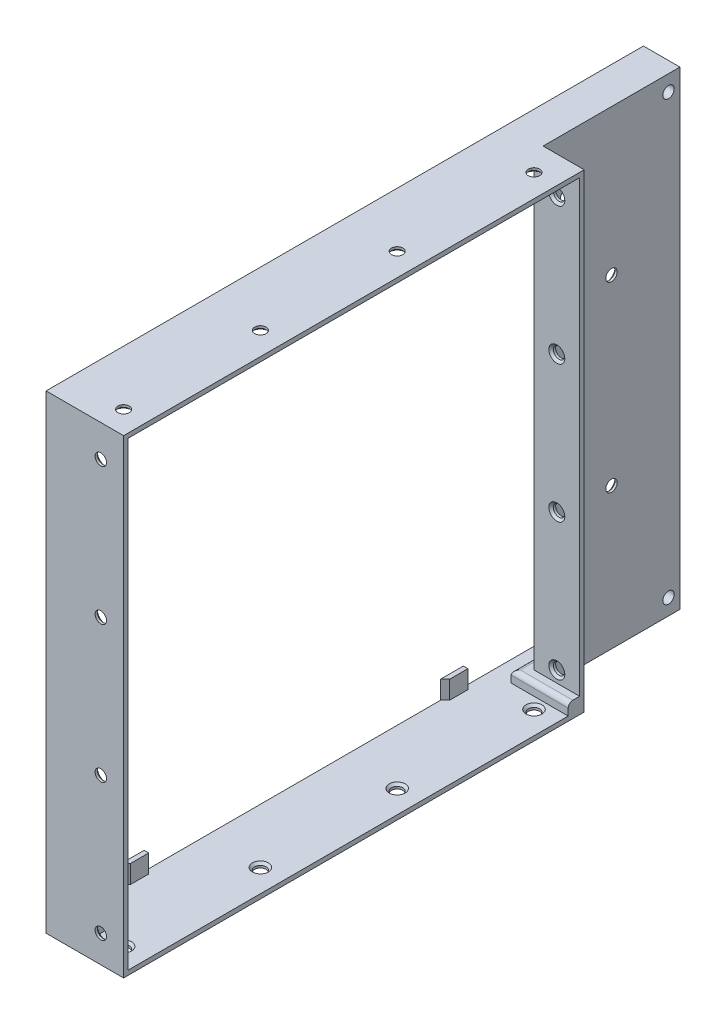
ISO-10303-21;
HEADER;
FILE_DESCRIPTION(('STEP AP214'),'2;1');
FILE_NAME('part.step','',(''),(''),'','','');
FILE_SCHEMA(('AUTOMOTIVE_DESIGN { 1 0 10303 214 1 1 1 1 }'));
ENDSEC;
DATA;
#1=APPLICATION_CONTEXT('core data for automotive mechanical design processes');
#2=APPLICATION_PROTOCOL_DEFINITION('international standard','automotive_design',2000,#1);
#3=PRODUCT_CONTEXT('',#1,'mechanical');
#4=PRODUCT('Part','Part','',(#3));
#5=PRODUCT_RELATED_PRODUCT_CATEGORY('part','',(#4));
#6=PRODUCT_DEFINITION_FORMATION('','',#4);
#7=PRODUCT_DEFINITION_CONTEXT('part definition',#1,'design');
#8=PRODUCT_DEFINITION('design','',#6,#7);
#9=PRODUCT_DEFINITION_SHAPE('','',#8);
#10=(LENGTH_UNIT() NAMED_UNIT(*) SI_UNIT(.MILLI.,.METRE.));
#11=(NAMED_UNIT(*) PLANE_ANGLE_UNIT() SI_UNIT($,.RADIAN.));
#12=(NAMED_UNIT(*) SI_UNIT($,.STERADIAN.) SOLID_ANGLE_UNIT());
#13=UNCERTAINTY_MEASURE_WITH_UNIT(LENGTH_MEASURE(1.E-05),#10,'distance_accuracy_value','');
#14=(GEOMETRIC_REPRESENTATION_CONTEXT(3) GLOBAL_UNCERTAINTY_ASSIGNED_CONTEXT((#13)) GLOBAL_UNIT_ASSIGNED_CONTEXT((#10,
#11,#12)) REPRESENTATION_CONTEXT('',''));
#15=CARTESIAN_POINT('',(0.,0.,0.));
#16=DIRECTION('',(0.,0.,1.));
#17=DIRECTION('',(1.,0.,0.));
#18=AXIS2_PLACEMENT_3D('',#15,#16,#17);
#19=CARTESIAN_POINT('',(0.,12.7,53.1254337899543));
#20=DIRECTION('',(1.,0.,0.));
#21=DIRECTION('',(0.,0.,-1.));
#22=AXIS2_PLACEMENT_3D('',#19,#20,#21);
#23=PLANE('',#22);
#24=DIRECTION('',(0.,0.,1.));
#25=VECTOR('',#24,1.);
#26=CARTESIAN_POINT('',(0.,2.54,53.1254337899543));
#27=LINE('',#26,#25);
#28=CARTESIAN_POINT('',(0.,2.54,40.4254337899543));
#29=VERTEX_POINT('',#28);
#30=CARTESIAN_POINT('',(0.,2.54,53.1254337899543));
#31=VERTEX_POINT('',#30);
#32=EDGE_CURVE('E99',#29,#31,#27,.T.);
#33=ORIENTED_EDGE('',*,*,#32,.T.);
#34=DIRECTION('',(0.,-1.,0.));
#35=VECTOR('',#34,1.);
#36=CARTESIAN_POINT('',(0.,12.7,53.1254337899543));
#37=LINE('',#36,#35);
#38=CARTESIAN_POINT('',(0.,12.7,53.1254337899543));
#39=VERTEX_POINT('',#38);
#40=EDGE_CURVE('E97',#39,#31,#37,.T.);
#41=ORIENTED_EDGE('',*,*,#40,.F.);
#42=DIRECTION('',(0.,0.,1.));
#43=VECTOR('',#42,1.);
#44=CARTESIAN_POINT('',(0.,12.7,53.1254337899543));
#45=LINE('',#44,#43);
#46=CARTESIAN_POINT('',(0.,12.7,40.4254337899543));
#47=VERTEX_POINT('',#46);
#48=EDGE_CURVE('E85',#47,#39,#45,.T.);
#49=ORIENTED_EDGE('',*,*,#48,.F.);
#50=DIRECTION('',(0.,-1.,0.));
#51=VECTOR('',#50,1.);
#52=CARTESIAN_POINT('',(0.,12.7,40.4254337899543));
#53=LINE('',#52,#51);
#54=EDGE_CURVE('E109',#47,#29,#53,.T.);
#55=ORIENTED_EDGE('',*,*,#54,.T.);
#56=EDGE_LOOP('',(#33,#41,#49,#55));
#57=FACE_BOUND('',#56,.T.);
#58=ADVANCED_FACE('F47',(#57),#23,.F.);
#59=CARTESIAN_POINT('',(2.54,12.7,53.1254337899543));
#60=DIRECTION('',(-1.,0.,0.));
#61=DIRECTION('',(0.,0.,1.));
#62=AXIS2_PLACEMENT_3D('',#59,#60,#61);
#63=PLANE('',#62);
#64=DIRECTION('',(0.,0.,-1.));
#65=VECTOR('',#64,1.);
#66=CARTESIAN_POINT('',(2.54,12.7,53.1254337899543));
#67=LINE('',#66,#65);
#68=CARTESIAN_POINT('',(2.54,12.7,50.5854337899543));
#69=VERTEX_POINT('',#68);
#70=CARTESIAN_POINT('',(2.54,12.7,40.4254337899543));
#71=VERTEX_POINT('',#70);
#72=EDGE_CURVE('E93',#69,#71,#67,.T.);
#73=ORIENTED_EDGE('',*,*,#72,.F.);
#74=DIRECTION('',(0.,-1.,0.));
#75=VECTOR('',#74,1.);
#76=CARTESIAN_POINT('',(2.54,12.7,50.5854337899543));
#77=LINE('',#76,#75);
#78=CARTESIAN_POINT('',(2.54,2.54,50.5854337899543));
#79=VERTEX_POINT('',#78);
#80=EDGE_CURVE('E100',#69,#79,#77,.T.);
#81=ORIENTED_EDGE('',*,*,#80,.T.);
#82=DIRECTION('',(0.,0.,-1.));
#83=VECTOR('',#82,1.);
#84=CARTESIAN_POINT('',(2.54,2.54,53.1254337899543));
#85=LINE('',#84,#83);
#86=CARTESIAN_POINT('',(2.54,2.54,40.4254337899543));
#87=VERTEX_POINT('',#86);
#88=EDGE_CURVE('E112',#79,#87,#85,.T.);
#89=ORIENTED_EDGE('',*,*,#88,.T.);
#90=DIRECTION('',(0.,-1.,0.));
#91=VECTOR('',#90,1.);
#92=CARTESIAN_POINT('',(2.54,12.7,40.4254337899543));
#93=LINE('',#92,#91);
#94=EDGE_CURVE('E101',#71,#87,#93,.T.);
#95=ORIENTED_EDGE('',*,*,#94,.F.);
#96=EDGE_LOOP('',(#73,#81,#89,#95));
#97=FACE_BOUND('',#96,.T.);
#98=ADVANCED_FACE('F117',(#97),#63,.F.);
#99=CARTESIAN_POINT('',(0.,12.7,40.4254337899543));
#100=DIRECTION('',(0.,0.,1.));
#101=DIRECTION('',(1.,0.,0.));
#102=AXIS2_PLACEMENT_3D('',#99,#100,#101);
#103=PLANE('',#102);
#104=DIRECTION('',(-1.,0.,0.));
#105=VECTOR('',#104,1.);
#106=CARTESIAN_POINT('',(0.,2.54,40.4254337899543));
#107=LINE('',#106,#105);
#108=EDGE_CURVE('E94',#87,#29,#107,.T.);
#109=ORIENTED_EDGE('',*,*,#108,.T.);
#110=ORIENTED_EDGE('',*,*,#54,.F.);
#111=DIRECTION('',(-1.,0.,0.));
#112=VECTOR('',#111,1.);
#113=CARTESIAN_POINT('',(0.,12.7,40.4254337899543));
#114=LINE('',#113,#112);
#115=EDGE_CURVE('E89',#71,#47,#114,.T.);
#116=ORIENTED_EDGE('',*,*,#115,.F.);
#117=ORIENTED_EDGE('',*,*,#94,.T.);
#118=EDGE_LOOP('',(#109,#110,#116,#117));
#119=FACE_BOUND('',#118,.T.);
#120=ADVANCED_FACE('F120',(#119),#103,.F.);
#121=CARTESIAN_POINT('',(0.,12.7,0.));
#122=DIRECTION('',(0.,-1.,0.));
#123=DIRECTION('',(0.,0.,-1.));
#124=AXIS2_PLACEMENT_3D('',#121,#122,#123);
#125=PLANE('',#124);
#126=ORIENTED_EDGE('',*,*,#48,.T.);
#127=DIRECTION('',(-0.707106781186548,0.,0.707106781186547));
#128=VECTOR('',#127,1.);
#129=CARTESIAN_POINT('',(2.54,12.7,50.5854337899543));
#130=LINE('',#129,#128);
#131=EDGE_CURVE('E12',#39,#69,#130,.F.);
#132=ORIENTED_EDGE('',*,*,#131,.T.);
#133=ORIENTED_EDGE('',*,*,#72,.T.);
#134=ORIENTED_EDGE('',*,*,#115,.T.);
#135=EDGE_LOOP('',(#126,#132,#133,#134));
#136=FACE_BOUND('',#135,.T.);
#137=ADVANCED_FACE('F87',(#136),#125,.F.);
#138=CARTESIAN_POINT('',(0.,2.54,0.));
#139=DIRECTION('',(0.,-1.,0.));
#140=DIRECTION('',(0.,0.,-1.));
#141=AXIS2_PLACEMENT_3D('',#138,#139,#140);
#142=PLANE('',#141);
#143=ORIENTED_EDGE('',*,*,#88,.F.);
#144=DIRECTION('',(0.707106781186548,0.,-0.707106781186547));
#145=VECTOR('',#144,1.);
#146=CARTESIAN_POINT('',(26.5627168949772,2.54,26.5627168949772));
#147=LINE('',#146,#145);
#148=EDGE_CURVE('E56',#79,#31,#147,.F.);
#149=ORIENTED_EDGE('',*,*,#148,.T.);
#150=ORIENTED_EDGE('',*,*,#32,.F.);
#151=ORIENTED_EDGE('',*,*,#108,.F.);
#152=EDGE_LOOP('',(#143,#149,#150,#151));
#153=FACE_BOUND('',#152,.T.);
#154=ADVANCED_FACE('F122',(#153),#142,.T.);
#155=CARTESIAN_POINT('',(2.54,12.7,50.5854337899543));
#156=DIRECTION('',(-0.707106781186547,0.,-0.707106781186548));
#157=DIRECTION('',(0.,-1.,0.));
#158=AXIS2_PLACEMENT_3D('',#155,#156,#157);
#159=PLANE('',#158);
#160=ORIENTED_EDGE('',*,*,#131,.F.);
#161=ORIENTED_EDGE('',*,*,#40,.T.);
#162=ORIENTED_EDGE('',*,*,#148,.F.);
#163=ORIENTED_EDGE('',*,*,#80,.F.);
#164=EDGE_LOOP('',(#160,#161,#162,#163));
#165=FACE_BOUND('',#164,.T.);
#166=ADVANCED_FACE('F50',(#165),#159,.F.);
#167=CLOSED_SHELL('',(#58,#98,#120,#137,#154,#166));
#168=MANIFOLD_SOLID_BREP('B2',#167);
#169=CARTESIAN_POINT('',(0.,12.7,230.925433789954));
#170=DIRECTION('',(1.,0.,0.));
#171=DIRECTION('',(0.,0.,-1.));
#172=AXIS2_PLACEMENT_3D('',#169,#170,#171);
#173=PLANE('',#172);
#174=DIRECTION('',(0.,0.,1.));
#175=VECTOR('',#174,1.);
#176=CARTESIAN_POINT('',(0.,2.54,230.925433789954));
#177=LINE('',#176,#175);
#178=CARTESIAN_POINT('',(0.,2.54,218.225433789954));
#179=VERTEX_POINT('',#178);
#180=CARTESIAN_POINT('',(0.,2.54,230.925433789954));
#181=VERTEX_POINT('',#180);
#182=EDGE_CURVE('E234',#179,#181,#177,.T.);
#183=ORIENTED_EDGE('',*,*,#182,.T.);
#184=DIRECTION('',(0.,-1.,0.));
#185=VECTOR('',#184,1.);
#186=CARTESIAN_POINT('',(0.,12.7,230.925433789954));
#187=LINE('',#186,#185);
#188=CARTESIAN_POINT('',(0.,12.7,230.925433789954));
#189=VERTEX_POINT('',#188);
#190=EDGE_CURVE('E232',#189,#181,#187,.T.);
#191=ORIENTED_EDGE('',*,*,#190,.F.);
#192=DIRECTION('',(0.,0.,1.));
#193=VECTOR('',#192,1.);
#194=CARTESIAN_POINT('',(0.,12.7,230.925433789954));
#195=LINE('',#194,#193);
#196=CARTESIAN_POINT('',(0.,12.7,218.225433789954));
#197=VERTEX_POINT('',#196);
#198=EDGE_CURVE('E220',#197,#189,#195,.T.);
#199=ORIENTED_EDGE('',*,*,#198,.F.);
#200=DIRECTION('',(0.,-1.,0.));
#201=VECTOR('',#200,1.);
#202=CARTESIAN_POINT('',(0.,12.7,218.225433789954));
#203=LINE('',#202,#201);
#204=EDGE_CURVE('E244',#197,#179,#203,.T.);
#205=ORIENTED_EDGE('',*,*,#204,.T.);
#206=EDGE_LOOP('',(#183,#191,#199,#205));
#207=FACE_BOUND('',#206,.T.);
#208=ADVANCED_FACE('F182',(#207),#173,.F.);
#209=CARTESIAN_POINT('',(2.54,12.7,230.925433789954));
#210=DIRECTION('',(-1.,0.,0.));
#211=DIRECTION('',(0.,0.,1.));
#212=AXIS2_PLACEMENT_3D('',#209,#210,#211);
#213=PLANE('',#212);
#214=DIRECTION('',(0.,0.,-1.));
#215=VECTOR('',#214,1.);
#216=CARTESIAN_POINT('',(2.54,12.7,230.925433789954));
#217=LINE('',#216,#215);
#218=CARTESIAN_POINT('',(2.54,12.7,228.385433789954));
#219=VERTEX_POINT('',#218);
#220=CARTESIAN_POINT('',(2.54,12.7,218.225433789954));
#221=VERTEX_POINT('',#220);
#222=EDGE_CURVE('E228',#219,#221,#217,.T.);
#223=ORIENTED_EDGE('',*,*,#222,.F.);
#224=DIRECTION('',(0.,-1.,0.));
#225=VECTOR('',#224,1.);
#226=CARTESIAN_POINT('',(2.54,12.7,228.385433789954));
#227=LINE('',#226,#225);
#228=CARTESIAN_POINT('',(2.54,2.54,228.385433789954));
#229=VERTEX_POINT('',#228);
#230=EDGE_CURVE('E235',#219,#229,#227,.T.);
#231=ORIENTED_EDGE('',*,*,#230,.T.);
#232=DIRECTION('',(0.,0.,-1.));
#233=VECTOR('',#232,1.);
#234=CARTESIAN_POINT('',(2.54,2.54,230.925433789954));
#235=LINE('',#234,#233);
#236=CARTESIAN_POINT('',(2.54,2.54,218.225433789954));
#237=VERTEX_POINT('',#236);
#238=EDGE_CURVE('E247',#229,#237,#235,.T.);
#239=ORIENTED_EDGE('',*,*,#238,.T.);
#240=DIRECTION('',(0.,-1.,0.));
#241=VECTOR('',#240,1.);
#242=CARTESIAN_POINT('',(2.54,12.7,218.225433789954));
#243=LINE('',#242,#241);
#244=EDGE_CURVE('E236',#221,#237,#243,.T.);
#245=ORIENTED_EDGE('',*,*,#244,.F.);
#246=EDGE_LOOP('',(#223,#231,#239,#245));
#247=FACE_BOUND('',#246,.T.);
#248=ADVANCED_FACE('F252',(#247),#213,.F.);
#249=CARTESIAN_POINT('',(0.,12.7,218.225433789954));
#250=DIRECTION('',(0.,0.,1.));
#251=DIRECTION('',(1.,0.,0.));
#252=AXIS2_PLACEMENT_3D('',#249,#250,#251);
#253=PLANE('',#252);
#254=DIRECTION('',(-1.,0.,0.));
#255=VECTOR('',#254,1.);
#256=CARTESIAN_POINT('',(0.,2.54,218.225433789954));
#257=LINE('',#256,#255);
#258=EDGE_CURVE('E229',#237,#179,#257,.T.);
#259=ORIENTED_EDGE('',*,*,#258,.T.);
#260=ORIENTED_EDGE('',*,*,#204,.F.);
#261=DIRECTION('',(-1.,0.,0.));
#262=VECTOR('',#261,1.);
#263=CARTESIAN_POINT('',(0.,12.7,218.225433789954));
#264=LINE('',#263,#262);
#265=EDGE_CURVE('E224',#221,#197,#264,.T.);
#266=ORIENTED_EDGE('',*,*,#265,.F.);
#267=ORIENTED_EDGE('',*,*,#244,.T.);
#268=EDGE_LOOP('',(#259,#260,#266,#267));
#269=FACE_BOUND('',#268,.T.);
#270=ADVANCED_FACE('F255',(#269),#253,.F.);
#271=CARTESIAN_POINT('',(0.,12.7,0.));
#272=DIRECTION('',(0.,-1.,0.));
#273=DIRECTION('',(0.,0.,-1.));
#274=AXIS2_PLACEMENT_3D('',#271,#272,#273);
#275=PLANE('',#274);
#276=ORIENTED_EDGE('',*,*,#198,.T.);
#277=DIRECTION('',(-0.707106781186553,0.,0.707106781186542));
#278=VECTOR('',#277,1.);
#279=CARTESIAN_POINT('',(2.54,12.7,228.385433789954));
#280=LINE('',#279,#278);
#281=EDGE_CURVE('E45',#189,#219,#280,.F.);
#282=ORIENTED_EDGE('',*,*,#281,.T.);
#283=ORIENTED_EDGE('',*,*,#222,.T.);
#284=ORIENTED_EDGE('',*,*,#265,.T.);
#285=EDGE_LOOP('',(#276,#282,#283,#284));
#286=FACE_BOUND('',#285,.T.);
#287=ADVANCED_FACE('F222',(#286),#275,.F.);
#288=CARTESIAN_POINT('',(0.,2.54,0.));
#289=DIRECTION('',(0.,-1.,0.));
#290=DIRECTION('',(0.,0.,-1.));
#291=AXIS2_PLACEMENT_3D('',#288,#289,#290);
#292=PLANE('',#291);
#293=ORIENTED_EDGE('',*,*,#238,.F.);
#294=DIRECTION('',(0.707106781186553,0.,-0.707106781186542));
#295=VECTOR('',#294,1.);
#296=CARTESIAN_POINT('',(115.462716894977,2.54,115.462716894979));
#297=LINE('',#296,#295);
#298=EDGE_CURVE('E191',#229,#181,#297,.F.);
#299=ORIENTED_EDGE('',*,*,#298,.T.);
#300=ORIENTED_EDGE('',*,*,#182,.F.);
#301=ORIENTED_EDGE('',*,*,#258,.F.);
#302=EDGE_LOOP('',(#293,#299,#300,#301));
#303=FACE_BOUND('',#302,.T.);
#304=ADVANCED_FACE('F257',(#303),#292,.T.);
#305=CARTESIAN_POINT('',(2.54,12.7,228.385433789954));
#306=DIRECTION('',(-0.707106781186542,0.,-0.707106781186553));
#307=DIRECTION('',(0.,-1.,0.));
#308=AXIS2_PLACEMENT_3D('',#305,#306,#307);
#309=PLANE('',#308);
#310=ORIENTED_EDGE('',*,*,#281,.F.);
#311=ORIENTED_EDGE('',*,*,#190,.T.);
#312=ORIENTED_EDGE('',*,*,#298,.F.);
#313=ORIENTED_EDGE('',*,*,#230,.F.);
#314=EDGE_LOOP('',(#310,#311,#312,#313));
#315=FACE_BOUND('',#314,.T.);
#316=ADVANCED_FACE('F185',(#315),#309,.F.);
#317=CLOSED_SHELL('',(#208,#248,#270,#287,#304,#316));
#318=MANIFOLD_SOLID_BREP('B6',#317);
#319=CARTESIAN_POINT('',(-88.9,2.54,-59.9045662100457));
#320=DIRECTION('',(0.,-1.,0.));
#321=DIRECTION('',(0.,0.,-1.));
#322=AXIS2_PLACEMENT_3D('',#319,#320,#321);
#323=PLANE('',#322);
#324=CARTESIAN_POINT('',(30.48,2.54,31.5354337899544));
#325=DIRECTION('',(0.,1.,0.));
#326=DIRECTION('',(0.,0.,1.));
#327=AXIS2_PLACEMENT_3D('',#324,#325,#326);
#328=CIRCLE('',#327,4.44499999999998);
#329=CARTESIAN_POINT('',(30.48,2.54,35.9804337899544));
#330=VERTEX_POINT('',#329);
#331=EDGE_CURVE('E675',#330,#330,#328,.F.);
#332=ORIENTED_EDGE('',*,*,#331,.T.);
#333=EDGE_LOOP('',(#332));
#334=FACE_BOUND('',#333,.T.);
#335=CARTESIAN_POINT('',(30.48,2.54,107.735433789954));
#336=DIRECTION('',(0.,1.,0.));
#337=DIRECTION('',(0.,0.,1.));
#338=AXIS2_PLACEMENT_3D('',#335,#336,#337);
#339=CIRCLE('',#338,4.44499999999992);
#340=CARTESIAN_POINT('',(30.48,2.54,112.180433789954));
#341=VERTEX_POINT('',#340);
#342=EDGE_CURVE('E678',#341,#341,#339,.F.);
#343=ORIENTED_EDGE('',*,*,#342,.T.);
#344=EDGE_LOOP('',(#343));
#345=FACE_BOUND('',#344,.T.);
#346=CARTESIAN_POINT('',(30.48,2.54,183.935433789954));
#347=DIRECTION('',(0.,1.,0.));
#348=DIRECTION('',(0.,0.,1.));
#349=AXIS2_PLACEMENT_3D('',#346,#347,#348);
#350=CIRCLE('',#349,4.44499999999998);
#351=CARTESIAN_POINT('',(30.48,2.54,188.380433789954));
#352=VERTEX_POINT('',#351);
#353=EDGE_CURVE('E681',#352,#352,#350,.F.);
#354=ORIENTED_EDGE('',*,*,#353,.T.);
#355=EDGE_LOOP('',(#354));
#356=FACE_BOUND('',#355,.T.);
#357=CARTESIAN_POINT('',(30.48,2.54,260.135433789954));
#358=DIRECTION('',(0.,1.,0.));
#359=DIRECTION('',(0.,0.,1.));
#360=AXIS2_PLACEMENT_3D('',#357,#358,#359);
#361=CIRCLE('',#360,4.44499999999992);
#362=CARTESIAN_POINT('',(30.48,2.54,264.580433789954));
#363=VERTEX_POINT('',#362);
#364=EDGE_CURVE('E684',#363,#363,#361,.F.);
#365=ORIENTED_EDGE('',*,*,#364,.T.);
#366=EDGE_LOOP('',(#365));
#367=FACE_BOUND('',#366,.T.);
#368=DIRECTION('',(0.,0.,1.));
#369=VECTOR('',#368,1.);
#370=CARTESIAN_POINT('',(43.18,2.54,16.2954337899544));
#371=LINE('',#370,#369);
#372=CARTESIAN_POINT('',(43.18,2.54,25.1854337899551));
#373=VERTEX_POINT('',#372);
#374=CARTESIAN_POINT('',(43.18,2.54,270.295433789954));
#375=VERTEX_POINT('',#374);
#376=EDGE_CURVE('E610',#373,#375,#371,.T.);
#377=ORIENTED_EDGE('',*,*,#376,.F.);
#378=DIRECTION('',(1.,0.,0.));
#379=VECTOR('',#378,1.);
#380=CARTESIAN_POINT('',(17.78,2.54,25.1854337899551));
#381=LINE('',#380,#379);
#382=CARTESIAN_POINT('',(11.43,2.54,25.1854337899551));
#383=VERTEX_POINT('',#382);
#384=EDGE_CURVE('E620',#383,#373,#381,.T.);
#385=ORIENTED_EDGE('',*,*,#384,.F.);
#386=DIRECTION('',(0.,0.,-1.));
#387=VECTOR('',#386,1.);
#388=CARTESIAN_POINT('',(11.43,2.54,25.1854337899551));
#389=LINE('',#388,#387);
#390=CARTESIAN_POINT('',(11.43,2.54,-1.48456621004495));
#391=VERTEX_POINT('',#390);
#392=EDGE_CURVE('E626',#383,#391,#389,.T.);
#393=ORIENTED_EDGE('',*,*,#392,.T.);
#394=DIRECTION('',(-1.,0.,0.));
#395=VECTOR('',#394,1.);
#396=CARTESIAN_POINT('',(-88.9,2.54,-1.48456621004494));
#397=LINE('',#396,#395);
#398=CARTESIAN_POINT('',(0.,2.54,-1.48456621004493));
#399=VERTEX_POINT('',#398);
#400=EDGE_CURVE('E789',#391,#399,#397,.T.);
#401=ORIENTED_EDGE('',*,*,#400,.T.);
#402=DIRECTION('',(0.,0.,1.));
#403=VECTOR('',#402,1.);
#404=CARTESIAN_POINT('',(0.,2.54,16.2954337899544));
#405=LINE('',#404,#403);
#406=CARTESIAN_POINT('',(0.,2.53999999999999,244.895433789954));
#407=VERTEX_POINT('',#406);
#408=EDGE_CURVE('E647',#399,#407,#405,.T.);
#409=ORIENTED_EDGE('',*,*,#408,.T.);
#410=DIRECTION('',(-1.,0.,0.));
#411=VECTOR('',#410,1.);
#412=CARTESIAN_POINT('',(2.54,2.53999999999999,244.895433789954));
#413=LINE('',#412,#411);
#414=CARTESIAN_POINT('',(2.54,2.53999999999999,244.895433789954));
#415=VERTEX_POINT('',#414);
#416=EDGE_CURVE('E973',#415,#407,#413,.T.);
#417=ORIENTED_EDGE('',*,*,#416,.F.);
#418=DIRECTION('',(0.,0.,1.));
#419=VECTOR('',#418,1.);
#420=CARTESIAN_POINT('',(2.54,2.53999999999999,244.895433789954));
#421=LINE('',#420,#419);
#422=CARTESIAN_POINT('',(2.54,2.53999999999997,257.595433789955));
#423=VERTEX_POINT('',#422);
#424=EDGE_CURVE('E961',#415,#423,#421,.T.);
#425=ORIENTED_EDGE('',*,*,#424,.T.);
#426=DIRECTION('',(-1.,0.,0.));
#427=VECTOR('',#426,1.);
#428=CARTESIAN_POINT('',(17.78,2.53999999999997,257.595433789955));
#429=LINE('',#428,#427);
#430=CARTESIAN_POINT('',(17.78,2.53999999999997,257.595433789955));
#431=VERTEX_POINT('',#430);
#432=EDGE_CURVE('E840',#431,#423,#429,.T.);
#433=ORIENTED_EDGE('',*,*,#432,.F.);
#434=DIRECTION('',(0.,0.,1.));
#435=VECTOR('',#434,1.);
#436=CARTESIAN_POINT('',(17.78,2.53999999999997,270.295433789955));
#437=LINE('',#436,#435);
#438=CARTESIAN_POINT('',(17.78,2.53999999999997,270.295433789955));
#439=VERTEX_POINT('',#438);
#440=EDGE_CURVE('E837',#431,#439,#437,.T.);
#441=ORIENTED_EDGE('',*,*,#440,.T.);
#442=DIRECTION('',(-1.,0.,0.));
#443=VECTOR('',#442,1.);
#444=CARTESIAN_POINT('',(0.,2.54,270.295433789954));
#445=LINE('',#444,#443);
#446=EDGE_CURVE('E631',#375,#439,#445,.T.);
#447=ORIENTED_EDGE('',*,*,#446,.F.);
#448=EDGE_LOOP('',(#377,#385,#393,#401,#409,#417,#425,#433,#441,#447));
#449=FACE_BOUND('',#448,.T.);
#450=ADVANCED_FACE('F308',(#334,#345,#356,#367,#449),#323,.F.);
#451=CARTESIAN_POINT('',(43.18,259.08,18.8354337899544));
#452=DIRECTION('',(0.,0.,-1.));
#453=DIRECTION('',(-1.,0.,0.));
#454=AXIS2_PLACEMENT_3D('',#451,#452,#453);
#455=PLANE('',#454);
#456=CARTESIAN_POINT('',(30.48,91.44,18.8354337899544));
#457=DIRECTION('',(0.,0.,-1.));
#458=DIRECTION('',(-1.,0.,0.));
#459=AXIS2_PLACEMENT_3D('',#456,#457,#458);
#460=CIRCLE('',#459,4.44500000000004);
#461=CARTESIAN_POINT('',(26.035,91.44,18.8354337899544));
#462=VERTEX_POINT('',#461);
#463=EDGE_CURVE('E1073',#462,#462,#460,.T.);
#464=ORIENTED_EDGE('',*,*,#463,.T.);
#465=EDGE_LOOP('',(#464));
#466=FACE_BOUND('',#465,.T.);
#467=CARTESIAN_POINT('',(30.48,15.24,18.8354337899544));
#468=DIRECTION('',(0.,0.,-1.));
#469=DIRECTION('',(-1.,0.,0.));
#470=AXIS2_PLACEMENT_3D('',#467,#468,#469);
#471=CIRCLE('',#470,4.44499999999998);
#472=CARTESIAN_POINT('',(26.035,15.24,18.8354337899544));
#473=VERTEX_POINT('',#472);
#474=EDGE_CURVE('E1076',#473,#473,#471,.T.);
#475=ORIENTED_EDGE('',*,*,#474,.T.);
#476=EDGE_LOOP('',(#475));
#477=FACE_BOUND('',#476,.T.);
#478=CARTESIAN_POINT('',(30.48,167.64,18.8354337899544));
#479=DIRECTION('',(0.,0.,-1.));
#480=DIRECTION('',(-1.,0.,0.));
#481=AXIS2_PLACEMENT_3D('',#478,#479,#480);
#482=CIRCLE('',#481,4.44500000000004);
#483=CARTESIAN_POINT('',(26.035,167.64,18.8354337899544));
#484=VERTEX_POINT('',#483);
#485=EDGE_CURVE('E1079',#484,#484,#482,.T.);
#486=ORIENTED_EDGE('',*,*,#485,.T.);
#487=EDGE_LOOP('',(#486));
#488=FACE_BOUND('',#487,.T.);
#489=CARTESIAN_POINT('',(30.48,243.84,18.8354337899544));
#490=DIRECTION('',(0.,0.,-1.));
#491=DIRECTION('',(-1.,0.,0.));
#492=AXIS2_PLACEMENT_3D('',#489,#490,#491);
#493=CIRCLE('',#492,4.44500000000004);
#494=CARTESIAN_POINT('',(26.035,243.84,18.8354337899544));
#495=VERTEX_POINT('',#494);
#496=EDGE_CURVE('E1082',#495,#495,#493,.T.);
#497=ORIENTED_EDGE('',*,*,#496,.T.);
#498=EDGE_LOOP('',(#497));
#499=FACE_BOUND('',#498,.T.);
#500=DIRECTION('',(-1.,0.,0.));
#501=VECTOR('',#500,1.);
#502=CARTESIAN_POINT('',(43.18,8.89,18.8354337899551));
#503=LINE('',#502,#501);
#504=CARTESIAN_POINT('',(43.18,8.89,18.8354337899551));
#505=VERTEX_POINT('',#504);
#506=CARTESIAN_POINT('',(17.78,8.89,18.8354337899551));
#507=VERTEX_POINT('',#506);
#508=EDGE_CURVE('E745',#505,#507,#503,.T.);
#509=ORIENTED_EDGE('',*,*,#508,.F.);
#510=DIRECTION('',(0.,-1.,0.));
#511=VECTOR('',#510,1.);
#512=CARTESIAN_POINT('',(43.18,259.08,18.8354337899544));
#513=LINE('',#512,#511);
#514=CARTESIAN_POINT('',(43.18,259.08,18.8354337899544));
#515=VERTEX_POINT('',#514);
#516=EDGE_CURVE('E744',#515,#505,#513,.T.);
#517=ORIENTED_EDGE('',*,*,#516,.F.);
#518=DIRECTION('',(1.,0.,0.));
#519=VECTOR('',#518,1.);
#520=CARTESIAN_POINT('',(43.18,259.08,18.8354337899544));
#521=LINE('',#520,#519);
#522=CARTESIAN_POINT('',(17.78,259.08,18.8354337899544));
#523=VERTEX_POINT('',#522);
#524=EDGE_CURVE('E1020',#523,#515,#521,.T.);
#525=ORIENTED_EDGE('',*,*,#524,.F.);
#526=DIRECTION('',(0.,-1.,0.));
#527=VECTOR('',#526,1.);
#528=CARTESIAN_POINT('',(17.78,259.08,18.8354337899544));
#529=LINE('',#528,#527);
#530=EDGE_CURVE('E1027',#523,#507,#529,.T.);
#531=ORIENTED_EDGE('',*,*,#530,.T.);
#532=EDGE_LOOP('',(#509,#517,#525,#531));
#533=FACE_BOUND('',#532,.T.);
#534=ADVANCED_FACE('F1239',(#466,#477,#488,#499,#533),#455,.F.);
#535=CARTESIAN_POINT('',(17.78,259.08,16.2954337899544));
#536=DIRECTION('',(1.,0.,0.));
#537=DIRECTION('',(0.,0.,-1.));
#538=AXIS2_PLACEMENT_3D('',#535,#536,#537);
#539=PLANE('',#538);
#540=CARTESIAN_POINT('',(17.78,27.94,3.59543378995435));
#541=DIRECTION('',(1.,0.,0.));
#542=DIRECTION('',(0.,0.,-1.));
#543=AXIS2_PLACEMENT_3D('',#540,#541,#542);
#544=CIRCLE('',#543,4.44500000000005);
#545=CARTESIAN_POINT('',(17.78,27.94,-0.849566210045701));
#546=VERTEX_POINT('',#545);
#547=EDGE_CURVE('E1097',#546,#546,#544,.T.);
#548=ORIENTED_EDGE('',*,*,#547,.T.);
#549=EDGE_LOOP('',(#548));
#550=FACE_BOUND('',#549,.T.);
#551=CARTESIAN_POINT('',(17.78,129.54,3.59543378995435));
#552=DIRECTION('',(1.,0.,0.));
#553=DIRECTION('',(0.,0.,-1.));
#554=AXIS2_PLACEMENT_3D('',#551,#552,#553);
#555=CIRCLE('',#554,4.44500000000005);
#556=CARTESIAN_POINT('',(17.78,129.54,-0.849566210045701));
#557=VERTEX_POINT('',#556);
#558=EDGE_CURVE('E1100',#557,#557,#555,.T.);
#559=ORIENTED_EDGE('',*,*,#558,.T.);
#560=EDGE_LOOP('',(#559));
#561=FACE_BOUND('',#560,.T.);
#562=CARTESIAN_POINT('',(17.78,231.14,3.59543378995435));
#563=DIRECTION('',(1.,0.,0.));
#564=DIRECTION('',(0.,0.,-1.));
#565=AXIS2_PLACEMENT_3D('',#562,#563,#564);
#566=CIRCLE('',#565,4.44500000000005);
#567=CARTESIAN_POINT('',(17.78,231.14,-0.849566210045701));
#568=VERTEX_POINT('',#567);
#569=EDGE_CURVE('E1103',#568,#568,#566,.T.);
#570=ORIENTED_EDGE('',*,*,#569,.T.);
#571=EDGE_LOOP('',(#570));
#572=FACE_BOUND('',#571,.T.);
#573=CARTESIAN_POINT('',(17.78,78.74,-21.8045662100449));
#574=DIRECTION('',(1.,0.,0.));
#575=DIRECTION('',(0.,0.,-1.));
#576=AXIS2_PLACEMENT_3D('',#573,#574,#575);
#577=CIRCLE('',#576,4.445);
#578=CARTESIAN_POINT('',(17.78,78.74,-26.2495662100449));
#579=VERTEX_POINT('',#578);
#580=EDGE_CURVE('E1106',#579,#579,#577,.T.);
#581=ORIENTED_EDGE('',*,*,#580,.T.);
#582=EDGE_LOOP('',(#581));
#583=FACE_BOUND('',#582,.T.);
#584=CARTESIAN_POINT('',(17.78,180.34,-21.8045662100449));
#585=DIRECTION('',(1.,0.,0.));
#586=DIRECTION('',(0.,0.,-1.));
#587=AXIS2_PLACEMENT_3D('',#584,#585,#586);
#588=CIRCLE('',#587,4.445);
#589=CARTESIAN_POINT('',(17.78,180.34,-26.2495662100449));
#590=VERTEX_POINT('',#589);
#591=EDGE_CURVE('E1109',#590,#590,#588,.T.);
#592=ORIENTED_EDGE('',*,*,#591,.T.);
#593=EDGE_LOOP('',(#592));
#594=FACE_BOUND('',#593,.T.);
#595=DIRECTION('',(0.,0.,-1.));
#596=VECTOR('',#595,1.);
#597=CARTESIAN_POINT('',(17.78,8.89,25.1854337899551));
#598=LINE('',#597,#596);
#599=CARTESIAN_POINT('',(17.78,8.89,-1.48456621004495));
#600=VERTEX_POINT('',#599);
#601=EDGE_CURVE('E757',#507,#600,#598,.T.);
#602=ORIENTED_EDGE('',*,*,#601,.F.);
#603=ORIENTED_EDGE('',*,*,#530,.F.);
#604=DIRECTION('',(0.,0.,1.));
#605=VECTOR('',#604,1.);
#606=CARTESIAN_POINT('',(17.78,259.08,-34.5045662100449));
#607=LINE('',#606,#605);
#608=CARTESIAN_POINT('',(17.78,259.08,-47.2045662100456));
#609=VERTEX_POINT('',#608);
#610=EDGE_CURVE('E1018',#609,#523,#607,.T.);
#611=ORIENTED_EDGE('',*,*,#610,.F.);
#612=DIRECTION('',(0.,1.,0.));
#613=VECTOR('',#612,1.);
#614=CARTESIAN_POINT('',(17.78,259.08,-47.2045662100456));
#615=LINE('',#614,#613);
#616=CARTESIAN_POINT('',(17.78,246.38,-47.2045662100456));
#617=VERTEX_POINT('',#616);
#618=EDGE_CURVE('E869',#617,#609,#615,.T.);
#619=ORIENTED_EDGE('',*,*,#618,.F.);
#620=DIRECTION('',(0.,0.,1.));
#621=VECTOR('',#620,1.);
#622=CARTESIAN_POINT('',(17.78,246.38,-59.9045662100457));
#623=LINE('',#622,#621);
#624=CARTESIAN_POINT('',(17.78,246.38,-59.9045662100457));
#625=VERTEX_POINT('',#624);
#626=EDGE_CURVE('E866',#625,#617,#623,.T.);
#627=ORIENTED_EDGE('',*,*,#626,.F.);
#628=DIRECTION('',(0.,1.,0.));
#629=VECTOR('',#628,1.);
#630=CARTESIAN_POINT('',(17.78,2.54,-59.9045662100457));
#631=LINE('',#630,#629);
#632=CARTESIAN_POINT('',(17.78,15.2400000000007,-59.9045662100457));
#633=VERTEX_POINT('',#632);
#634=EDGE_CURVE('E891',#633,#625,#631,.T.);
#635=ORIENTED_EDGE('',*,*,#634,.F.);
#636=DIRECTION('',(0.,0.,-1.));
#637=VECTOR('',#636,1.);
#638=CARTESIAN_POINT('',(17.78,15.2400000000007,-59.9045662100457));
#639=LINE('',#638,#637);
#640=CARTESIAN_POINT('',(17.78,15.2400000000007,-47.2045662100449));
#641=VERTEX_POINT('',#640);
#642=EDGE_CURVE('E814',#641,#633,#639,.T.);
#643=ORIENTED_EDGE('',*,*,#642,.F.);
#644=DIRECTION('',(0.,1.,0.));
#645=VECTOR('',#644,1.);
#646=CARTESIAN_POINT('',(17.78,2.54,-47.2045662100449));
#647=LINE('',#646,#645);
#648=CARTESIAN_POINT('',(17.78,2.54,-47.2045662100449));
#649=VERTEX_POINT('',#648);
#650=EDGE_CURVE('E811',#649,#641,#647,.T.);
#651=ORIENTED_EDGE('',*,*,#650,.F.);
#652=DIRECTION('',(0.,0.,1.));
#653=VECTOR('',#652,1.);
#654=CARTESIAN_POINT('',(17.78,2.54,16.2954337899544));
#655=LINE('',#654,#653);
#656=CARTESIAN_POINT('',(17.78,2.54,-19.2645662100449));
#657=VERTEX_POINT('',#656);
#658=EDGE_CURVE('E1021',#649,#657,#655,.T.);
#659=ORIENTED_EDGE('',*,*,#658,.T.);
#660=DIRECTION('',(0.,1.,0.));
#661=VECTOR('',#660,1.);
#662=CARTESIAN_POINT('',(17.78,259.08,-19.264566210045));
#663=LINE('',#662,#661);
#664=CARTESIAN_POINT('',(17.78,12.7,-19.2645662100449));
#665=VERTEX_POINT('',#664);
#666=EDGE_CURVE('E730',#657,#665,#663,.T.);
#667=ORIENTED_EDGE('',*,*,#666,.T.);
#668=DIRECTION('',(0.,0.,1.));
#669=VECTOR('',#668,1.);
#670=CARTESIAN_POINT('',(17.78,12.7,16.2954337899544));
#671=LINE('',#670,#669);
#672=CARTESIAN_POINT('',(17.78,12.7,-1.48456621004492));
#673=VERTEX_POINT('',#672);
#674=EDGE_CURVE('E728',#665,#673,#671,.T.);
#675=ORIENTED_EDGE('',*,*,#674,.T.);
#676=DIRECTION('',(0.,-1.,0.));
#677=VECTOR('',#676,1.);
#678=CARTESIAN_POINT('',(17.78,259.08,-1.48456621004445));
#679=LINE('',#678,#677);
#680=EDGE_CURVE('E725',#673,#600,#679,.T.);
#681=ORIENTED_EDGE('',*,*,#680,.T.);
#682=EDGE_LOOP('',(#602,#603,#611,#619,#627,#635,#643,#651,#659,#667,#675,#681));
#683=FACE_BOUND('',#682,.T.);
#684=ADVANCED_FACE('F1235',(#550,#561,#572,#583,#594,#683),#539,.F.);
#685=CARTESIAN_POINT('',(20.32,12.7,-1.48456621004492));
#686=DIRECTION('',(0.,0.,1.));
#687=DIRECTION('',(0.,-1.,0.));
#688=AXIS2_PLACEMENT_3D('',#685,#686,#687);
#689=PLANE('',#688);
#690=DIRECTION('',(0.,-1.,0.));
#691=VECTOR('',#690,1.);
#692=CARTESIAN_POINT('',(11.43,2.54,-1.48456621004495));
#693=LINE('',#692,#691);
#694=CARTESIAN_POINT('',(11.43,6.35,-1.48456621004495));
#695=VERTEX_POINT('',#694);
#696=EDGE_CURVE('E749',#695,#391,#693,.T.);
#697=ORIENTED_EDGE('',*,*,#696,.F.);
#698=CARTESIAN_POINT('',(13.97,6.35,-1.48456621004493));
#699=DIRECTION('',(0.,0.,1.));
#700=DIRECTION('',(0.,-1.,0.));
#701=AXIS2_PLACEMENT_3D('',#698,#699,#700);
#702=CIRCLE('',#701,2.54);
#703=CARTESIAN_POINT('',(13.97,8.89,-1.48456621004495));
#704=VERTEX_POINT('',#703);
#705=EDGE_CURVE('E180',#695,#704,#702,.F.);
#706=ORIENTED_EDGE('',*,*,#705,.T.);
#707=DIRECTION('',(-1.,0.,0.));
#708=VECTOR('',#707,1.);
#709=CARTESIAN_POINT('',(17.78,8.89,-1.48456621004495));
#710=LINE('',#709,#708);
#711=EDGE_CURVE('E751',#600,#704,#710,.T.);
#712=ORIENTED_EDGE('',*,*,#711,.F.);
#713=ORIENTED_EDGE('',*,*,#680,.F.);
#714=DIRECTION('',(-1.,0.,0.));
#715=VECTOR('',#714,1.);
#716=CARTESIAN_POINT('',(20.32,12.7,-1.48456621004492));
#717=LINE('',#716,#715);
#718=CARTESIAN_POINT('',(0.,12.7,-1.48456621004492));
#719=VERTEX_POINT('',#718);
#720=EDGE_CURVE('E786',#673,#719,#717,.T.);
#721=ORIENTED_EDGE('',*,*,#720,.T.);
#722=DIRECTION('',(0.,1.,0.));
#723=VECTOR('',#722,1.);
#724=CARTESIAN_POINT('',(0.,12.7,-1.48456621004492));
#725=LINE('',#724,#723);
#726=EDGE_CURVE('E780',#399,#719,#725,.T.);
#727=ORIENTED_EDGE('',*,*,#726,.F.);
#728=ORIENTED_EDGE('',*,*,#400,.F.);
#729=EDGE_LOOP('',(#697,#706,#712,#713,#721,#727,#728));
#730=FACE_BOUND('',#729,.T.);
#731=ADVANCED_FACE('F1320',(#730),#689,.T.);
#732=DIRECTION('',(-1.,0.,0.));
#733=VECTOR('',#732,1.);
#734=CARTESIAN_POINT('',(20.32,2.54,-16.7245662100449));
#735=LINE('',#734,#733);
#736=CARTESIAN_POINT('',(17.78,2.54,-16.7245662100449));
#737=VERTEX_POINT('',#736);
#738=CARTESIAN_POINT('',(0.,2.54,-16.7245662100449));
#739=VERTEX_POINT('',#738);
#740=EDGE_CURVE('E768',#737,#739,#735,.T.);
#741=ORIENTED_EDGE('',*,*,#740,.T.);
#742=CARTESIAN_POINT('',(0.,2.54,-4.02456621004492));
#743=VERTEX_POINT('',#742);
#744=EDGE_CURVE('E646',#739,#743,#405,.T.);
#745=ORIENTED_EDGE('',*,*,#744,.T.);
#746=DIRECTION('',(-1.,0.,0.));
#747=VECTOR('',#746,1.);
#748=CARTESIAN_POINT('',(20.32,2.54,-4.02456621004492));
#749=LINE('',#748,#747);
#750=CARTESIAN_POINT('',(17.78,2.54,-4.02456621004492));
#751=VERTEX_POINT('',#750);
#752=EDGE_CURVE('E774',#751,#743,#749,.T.);
#753=ORIENTED_EDGE('',*,*,#752,.F.);
#754=EDGE_CURVE('E1017',#737,#751,#655,.T.);
#755=ORIENTED_EDGE('',*,*,#754,.F.);
#756=EDGE_LOOP('',(#741,#745,#753,#755));
#757=FACE_BOUND('',#756,.T.);
#758=ADVANCED_FACE('F1278',(#757),#323,.F.);
#759=CARTESIAN_POINT('',(0.,2.54,-47.2045662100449));
#760=VERTEX_POINT('',#759);
#761=CARTESIAN_POINT('',(0.,2.54,-19.2645662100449));
#762=VERTEX_POINT('',#761);
#763=EDGE_CURVE('E643',#760,#762,#405,.T.);
#764=ORIENTED_EDGE('',*,*,#763,.T.);
#765=DIRECTION('',(1.,0.,0.));
#766=VECTOR('',#765,1.);
#767=CARTESIAN_POINT('',(-88.9,2.54,-19.2645662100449));
#768=LINE('',#767,#766);
#769=EDGE_CURVE('E792',#762,#657,#768,.T.);
#770=ORIENTED_EDGE('',*,*,#769,.T.);
#771=ORIENTED_EDGE('',*,*,#658,.F.);
#772=DIRECTION('',(-1.,0.,0.));
#773=VECTOR('',#772,1.);
#774=CARTESIAN_POINT('',(17.78,2.54,-47.2045662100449));
#775=LINE('',#774,#773);
#776=EDGE_CURVE('E817',#649,#760,#775,.T.);
#777=ORIENTED_EDGE('',*,*,#776,.T.);
#778=EDGE_LOOP('',(#764,#770,#771,#777));
#779=FACE_BOUND('',#778,.T.);
#780=ADVANCED_FACE('F1310',(#779),#323,.F.);
#781=DIRECTION('',(0.,1.,0.));
#782=VECTOR('',#781,1.);
#783=CARTESIAN_POINT('',(17.78,259.08,-16.7245662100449));
#784=LINE('',#783,#782);
#785=CARTESIAN_POINT('',(17.78,10.16,-16.7245662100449));
#786=VERTEX_POINT('',#785);
#787=EDGE_CURVE('E722',#737,#786,#784,.T.);
#788=ORIENTED_EDGE('',*,*,#787,.F.);
#789=ORIENTED_EDGE('',*,*,#754,.T.);
#790=DIRECTION('',(0.,-1.,0.));
#791=VECTOR('',#790,1.);
#792=CARTESIAN_POINT('',(17.78,259.08,-4.02456621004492));
#793=LINE('',#792,#791);
#794=CARTESIAN_POINT('',(17.78,10.16,-4.02456621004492));
#795=VERTEX_POINT('',#794);
#796=EDGE_CURVE('E708',#795,#751,#793,.T.);
#797=ORIENTED_EDGE('',*,*,#796,.F.);
#798=DIRECTION('',(0.,0.,1.));
#799=VECTOR('',#798,1.);
#800=CARTESIAN_POINT('',(17.78,10.16,16.2954337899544));
#801=LINE('',#800,#799);
#802=EDGE_CURVE('E719',#786,#795,#801,.T.);
#803=ORIENTED_EDGE('',*,*,#802,.F.);
#804=EDGE_LOOP('',(#788,#789,#797,#803));
#805=FACE_BOUND('',#804,.T.);
#806=ADVANCED_FACE('F1292',(#805),#539,.F.);
#807=CARTESIAN_POINT('',(2.54,0.,0.));
#808=DIRECTION('',(-1.,0.,0.));
#809=DIRECTION('',(0.,0.,1.));
#810=AXIS2_PLACEMENT_3D('',#807,#808,#809);
#811=PLANE('',#810);
#812=DIRECTION('',(0.,-0.707106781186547,-0.707106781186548));
#813=VECTOR('',#812,1.);
#814=CARTESIAN_POINT('',(2.54,2.53999999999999,244.895433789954));
#815=LINE('',#814,#813);
#816=CARTESIAN_POINT('',(2.54,15.24,257.595433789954));
#817=VERTEX_POINT('',#816);
#818=EDGE_CURVE('E966',#817,#415,#815,.T.);
#819=ORIENTED_EDGE('',*,*,#818,.F.);
#820=DIRECTION('',(0.,-1.,0.));
#821=VECTOR('',#820,1.);
#822=CARTESIAN_POINT('',(2.54,0.,257.595433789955));
#823=LINE('',#822,#821);
#824=EDGE_CURVE('E705',#817,#423,#823,.T.);
#825=ORIENTED_EDGE('',*,*,#824,.T.);
#826=ORIENTED_EDGE('',*,*,#424,.F.);
#827=EDGE_LOOP('',(#819,#825,#826));
#828=FACE_BOUND('',#827,.T.);
#829=ADVANCED_FACE('F1326',(#828),#811,.F.);
#830=CARTESIAN_POINT('',(2.54,0.,0.));
#831=DIRECTION('',(1.,0.,0.));
#832=DIRECTION('',(0.,0.,-1.));
#833=AXIS2_PLACEMENT_3D('',#830,#831,#832);
#834=PLANE('',#833);
#835=DIRECTION('',(0.,0.,-1.));
#836=VECTOR('',#835,1.);
#837=CARTESIAN_POINT('',(2.54,246.379999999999,-5.384581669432E-13));
#838=LINE('',#837,#836);
#839=CARTESIAN_POINT('',(2.54,246.38,270.295433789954));
#840=VERTEX_POINT('',#839);
#841=CARTESIAN_POINT('',(2.54,246.379999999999,257.595433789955));
#842=VERTEX_POINT('',#841);
#843=EDGE_CURVE('E699',#840,#842,#838,.T.);
#844=ORIENTED_EDGE('',*,*,#843,.F.);
#845=DIRECTION('',(0.,1.,0.));
#846=VECTOR('',#845,1.);
#847=CARTESIAN_POINT('',(2.54,259.08,270.295433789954));
#848=LINE('',#847,#846);
#849=CARTESIAN_POINT('',(2.54,233.68,270.295433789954));
#850=VERTEX_POINT('',#849);
#851=EDGE_CURVE('E950',#850,#840,#848,.T.);
#852=ORIENTED_EDGE('',*,*,#851,.F.);
#853=DIRECTION('',(0.,-0.707106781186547,0.707106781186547));
#854=VECTOR('',#853,1.);
#855=CARTESIAN_POINT('',(2.54,259.08,244.895433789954));
#856=LINE('',#855,#854);
#857=EDGE_CURVE('E946',#842,#850,#856,.T.);
#858=ORIENTED_EDGE('',*,*,#857,.F.);
#859=EDGE_LOOP('',(#844,#852,#858));
#860=FACE_BOUND('',#859,.T.);
#861=ADVANCED_FACE('F1262',(#860),#834,.T.);
#862=CARTESIAN_POINT('',(-88.9,0.,-59.9045662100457));
#863=DIRECTION('',(0.,1.,0.));
#864=DIRECTION('',(0.,0.,1.));
#865=AXIS2_PLACEMENT_3D('',#862,#863,#864);
#866=PLANE('',#865);
#867=CARTESIAN_POINT('',(30.48,0.,31.5354337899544));
#868=DIRECTION('',(0.,1.,0.));
#869=DIRECTION('',(0.,0.,1.));
#870=AXIS2_PLACEMENT_3D('',#867,#868,#869);
#871=CIRCLE('',#870,3.175);
#872=CARTESIAN_POINT('',(30.48,0.,34.7104337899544));
#873=VERTEX_POINT('',#872);
#874=EDGE_CURVE('E660',#873,#873,#871,.T.);
#875=ORIENTED_EDGE('',*,*,#874,.T.);
#876=EDGE_LOOP('',(#875));
#877=FACE_BOUND('',#876,.T.);
#878=CARTESIAN_POINT('',(30.48,0.,107.735433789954));
#879=DIRECTION('',(0.,1.,0.));
#880=DIRECTION('',(0.,0.,1.));
#881=AXIS2_PLACEMENT_3D('',#878,#879,#880);
#882=CIRCLE('',#881,3.175);
#883=CARTESIAN_POINT('',(30.48,0.,110.910433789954));
#884=VERTEX_POINT('',#883);
#885=EDGE_CURVE('E663',#884,#884,#882,.T.);
#886=ORIENTED_EDGE('',*,*,#885,.T.);
#887=EDGE_LOOP('',(#886));
#888=FACE_BOUND('',#887,.T.);
#889=CARTESIAN_POINT('',(30.48,0.,183.935433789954));
#890=DIRECTION('',(0.,1.,0.));
#891=DIRECTION('',(0.,0.,1.));
#892=AXIS2_PLACEMENT_3D('',#889,#890,#891);
#893=CIRCLE('',#892,3.175);
#894=CARTESIAN_POINT('',(30.48,0.,187.110433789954));
#895=VERTEX_POINT('',#894);
#896=EDGE_CURVE('E667',#895,#895,#893,.T.);
#897=ORIENTED_EDGE('',*,*,#896,.T.);
#898=EDGE_LOOP('',(#897));
#899=FACE_BOUND('',#898,.T.);
#900=CARTESIAN_POINT('',(30.48,0.,260.135433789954));
#901=DIRECTION('',(0.,1.,0.));
#902=DIRECTION('',(0.,0.,1.));
#903=AXIS2_PLACEMENT_3D('',#900,#901,#902);
#904=CIRCLE('',#903,3.175);
#905=CARTESIAN_POINT('',(30.48,0.,263.310433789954));
#906=VERTEX_POINT('',#905);
#907=EDGE_CURVE('E670',#906,#906,#904,.T.);
#908=ORIENTED_EDGE('',*,*,#907,.T.);
#909=EDGE_LOOP('',(#908));
#910=FACE_BOUND('',#909,.T.);
#911=DIRECTION('',(0.,0.,-1.));
#912=VECTOR('',#911,1.);
#913=CARTESIAN_POINT('',(0.,0.,16.2954337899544));
#914=LINE('',#913,#912);
#915=CARTESIAN_POINT('',(0.,0.,272.835433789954));
#916=VERTEX_POINT('',#915);
#917=CARTESIAN_POINT('',(0.,0.,-59.9045662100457));
#918=VERTEX_POINT('',#917);
#919=EDGE_CURVE('E637',#916,#918,#914,.T.);
#920=ORIENTED_EDGE('',*,*,#919,.T.);
#921=DIRECTION('',(-1.,0.,0.));
#922=VECTOR('',#921,1.);
#923=CARTESIAN_POINT('',(20.32,0.,-59.9045662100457));
#924=LINE('',#923,#922);
#925=CARTESIAN_POINT('',(20.32,0.,-59.9045662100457));
#926=VERTEX_POINT('',#925);
#927=EDGE_CURVE('E886',#926,#918,#924,.T.);
#928=ORIENTED_EDGE('',*,*,#927,.F.);
#929=DIRECTION('',(0.,0.,-1.));
#930=VECTOR('',#929,1.);
#931=CARTESIAN_POINT('',(20.32,0.,16.2954337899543));
#932=LINE('',#931,#930);
#933=CARTESIAN_POINT('',(20.32,0.,16.2954337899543));
#934=VERTEX_POINT('',#933);
#935=EDGE_CURVE('E657',#934,#926,#932,.T.);
#936=ORIENTED_EDGE('',*,*,#935,.F.);
#937=DIRECTION('',(-1.,0.,0.));
#938=VECTOR('',#937,1.);
#939=CARTESIAN_POINT('',(43.18,0.,16.2954337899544));
#940=LINE('',#939,#938);
#941=CARTESIAN_POINT('',(43.18,0.,16.2954337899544));
#942=VERTEX_POINT('',#941);
#943=EDGE_CURVE('E642',#942,#934,#940,.T.);
#944=ORIENTED_EDGE('',*,*,#943,.F.);
#945=DIRECTION('',(0.,0.,-1.));
#946=VECTOR('',#945,1.);
#947=CARTESIAN_POINT('',(43.18,0.,16.2954337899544));
#948=LINE('',#947,#946);
#949=CARTESIAN_POINT('',(43.18,0.,272.835433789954));
#950=VERTEX_POINT('',#949);
#951=EDGE_CURVE('E635',#950,#942,#948,.T.);
#952=ORIENTED_EDGE('',*,*,#951,.F.);
#953=DIRECTION('',(-1.,0.,0.));
#954=VECTOR('',#953,1.);
#955=CARTESIAN_POINT('',(43.18,0.,272.835433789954));
#956=LINE('',#955,#954);
#957=EDGE_CURVE('E651',#950,#916,#956,.T.);
#958=ORIENTED_EDGE('',*,*,#957,.T.);
#959=EDGE_LOOP('',(#920,#928,#936,#944,#952,#958));
#960=FACE_BOUND('',#959,.T.);
#961=ADVANCED_FACE('F1471',(#877,#888,#899,#910,#960),#866,.F.);
#962=CARTESIAN_POINT('',(0.,259.08,7.07767178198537E-13));
#963=DIRECTION('',(0.,1.,0.));
#964=DIRECTION('',(0.,0.,1.));
#965=AXIS2_PLACEMENT_3D('',#962,#963,#964);
#966=PLANE('',#965);
#967=CARTESIAN_POINT('',(30.48,259.08,260.135433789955));
#968=DIRECTION('',(0.,1.,0.));
#969=DIRECTION('',(0.,0.,1.));
#970=AXIS2_PLACEMENT_3D('',#967,#968,#969);
#971=CIRCLE('',#970,4.44500000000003);
#972=CARTESIAN_POINT('',(30.48,259.08,264.580433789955));
#973=VERTEX_POINT('',#972);
#974=EDGE_CURVE('E1124',#973,#973,#971,.T.);
#975=ORIENTED_EDGE('',*,*,#974,.T.);
#976=EDGE_LOOP('',(#975));
#977=FACE_BOUND('',#976,.T.);
#978=CARTESIAN_POINT('',(30.48,259.08,183.935433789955));
#979=DIRECTION('',(0.,1.,0.));
#980=DIRECTION('',(0.,0.,1.));
#981=AXIS2_PLACEMENT_3D('',#978,#979,#980);
#982=CIRCLE('',#981,4.44500000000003);
#983=CARTESIAN_POINT('',(30.48,259.08,188.380433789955));
#984=VERTEX_POINT('',#983);
#985=EDGE_CURVE('E1127',#984,#984,#982,.T.);
#986=ORIENTED_EDGE('',*,*,#985,.T.);
#987=EDGE_LOOP('',(#986));
#988=FACE_BOUND('',#987,.T.);
#989=CARTESIAN_POINT('',(30.48,259.08,107.735433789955));
#990=DIRECTION('',(0.,1.,0.));
#991=DIRECTION('',(0.,0.,1.));
#992=AXIS2_PLACEMENT_3D('',#989,#990,#991);
#993=CIRCLE('',#992,4.44500000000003);
#994=CARTESIAN_POINT('',(30.48,259.08,112.180433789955));
#995=VERTEX_POINT('',#994);
#996=EDGE_CURVE('E1130',#995,#995,#993,.T.);
#997=ORIENTED_EDGE('',*,*,#996,.T.);
#998=EDGE_LOOP('',(#997));
#999=FACE_BOUND('',#998,.T.);
#1000=CARTESIAN_POINT('',(30.48,259.08,31.5354337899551));
#1001=DIRECTION('',(0.,1.,0.));
#1002=DIRECTION('',(0.,0.,1.));
#1003=AXIS2_PLACEMENT_3D('',#1000,#1001,#1002);
#1004=CIRCLE('',#1003,4.44500000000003);
#1005=CARTESIAN_POINT('',(30.48,259.08,35.9804337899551));
#1006=VERTEX_POINT('',#1005);
#1007=EDGE_CURVE('E1133',#1006,#1006,#1004,.T.);
#1008=ORIENTED_EDGE('',*,*,#1007,.T.);
#1009=EDGE_LOOP('',(#1008));
#1010=FACE_BOUND('',#1009,.T.);
#1011=DIRECTION('',(0.,0.,-1.));
#1012=VECTOR('',#1011,1.);
#1013=CARTESIAN_POINT('',(17.78,259.08,270.295433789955));
#1014=LINE('',#1013,#1012);
#1015=CARTESIAN_POINT('',(17.78,259.08,270.295433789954));
#1016=VERTEX_POINT('',#1015);
#1017=CARTESIAN_POINT('',(17.78,259.08,257.595433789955));
#1018=VERTEX_POINT('',#1017);
#1019=EDGE_CURVE('E848',#1016,#1018,#1014,.T.);
#1020=ORIENTED_EDGE('',*,*,#1019,.T.);
#1021=DIRECTION('',(-1.,0.,0.));
#1022=VECTOR('',#1021,1.);
#1023=CARTESIAN_POINT('',(17.78,259.08,257.595433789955));
#1024=LINE('',#1023,#1022);
#1025=CARTESIAN_POINT('',(2.54,259.08,257.595433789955));
#1026=VERTEX_POINT('',#1025);
#1027=EDGE_CURVE('E856',#1018,#1026,#1024,.T.);
#1028=ORIENTED_EDGE('',*,*,#1027,.T.);
#1029=DIRECTION('',(0.,0.,-1.));
#1030=VECTOR('',#1029,1.);
#1031=CARTESIAN_POINT('',(2.54,259.08,244.895433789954));
#1032=LINE('',#1031,#1030);
#1033=CARTESIAN_POINT('',(2.54,259.08,244.895433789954));
#1034=VERTEX_POINT('',#1033);
#1035=EDGE_CURVE('E944',#1026,#1034,#1032,.T.);
#1036=ORIENTED_EDGE('',*,*,#1035,.T.);
#1037=DIRECTION('',(-1.,0.,0.));
#1038=VECTOR('',#1037,1.);
#1039=CARTESIAN_POINT('',(2.54,259.08,244.895433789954));
#1040=LINE('',#1039,#1038);
#1041=CARTESIAN_POINT('',(0.,259.08,244.895433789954));
#1042=VERTEX_POINT('',#1041);
#1043=EDGE_CURVE('E953',#1034,#1042,#1040,.T.);
#1044=ORIENTED_EDGE('',*,*,#1043,.T.);
#1045=DIRECTION('',(0.,0.,-1.));
#1046=VECTOR('',#1045,1.);
#1047=CARTESIAN_POINT('',(0.,259.08,16.2954337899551));
#1048=LINE('',#1047,#1046);
#1049=CARTESIAN_POINT('',(0.,259.08,230.925433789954));
#1050=VERTEX_POINT('',#1049);
#1051=EDGE_CURVE('E1055',#1042,#1050,#1048,.T.);
#1052=ORIENTED_EDGE('',*,*,#1051,.T.);
#1053=DIRECTION('',(-0.707106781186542,0.,0.707106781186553));
#1054=VECTOR('',#1053,1.);
#1055=CARTESIAN_POINT('',(115.462716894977,259.08,115.462716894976));
#1056=LINE('',#1055,#1054);
#1057=CARTESIAN_POINT('',(2.54,259.08,228.385433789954));
#1058=VERTEX_POINT('',#1057);
#1059=EDGE_CURVE('E664',#1050,#1058,#1056,.F.);
#1060=ORIENTED_EDGE('',*,*,#1059,.T.);
#1061=DIRECTION('',(0.,0.,-1.));
#1062=VECTOR('',#1061,1.);
#1063=CARTESIAN_POINT('',(2.54,259.08,230.925433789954));
#1064=LINE('',#1063,#1062);
#1065=CARTESIAN_POINT('',(2.54,259.08,218.225433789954));
#1066=VERTEX_POINT('',#1065);
#1067=EDGE_CURVE('E923',#1058,#1066,#1064,.T.);
#1068=ORIENTED_EDGE('',*,*,#1067,.T.);
#1069=DIRECTION('',(-1.,0.,0.));
#1070=VECTOR('',#1069,1.);
#1071=CARTESIAN_POINT('',(0.,259.08,218.225433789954));
#1072=LINE('',#1071,#1070);
#1073=CARTESIAN_POINT('',(0.,259.08,218.225433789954));
#1074=VERTEX_POINT('',#1073);
#1075=EDGE_CURVE('E925',#1066,#1074,#1072,.T.);
#1076=ORIENTED_EDGE('',*,*,#1075,.T.);
#1077=CARTESIAN_POINT('',(0.,259.08,53.1254337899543));
#1078=VERTEX_POINT('',#1077);
#1079=EDGE_CURVE('E1060',#1074,#1078,#1048,.T.);
#1080=ORIENTED_EDGE('',*,*,#1079,.T.);
#1081=DIRECTION('',(-0.707106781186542,0.,0.707106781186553));
#1082=VECTOR('',#1081,1.);
#1083=CARTESIAN_POINT('',(26.5627168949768,259.08,26.5627168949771));
#1084=LINE('',#1083,#1082);
#1085=CARTESIAN_POINT('',(2.54,259.08,50.5854337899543));
#1086=VERTEX_POINT('',#1085);
#1087=EDGE_CURVE('E1182',#1078,#1086,#1084,.F.);
#1088=ORIENTED_EDGE('',*,*,#1087,.T.);
#1089=DIRECTION('',(0.,0.,-1.));
#1090=VECTOR('',#1089,1.);
#1091=CARTESIAN_POINT('',(2.54,259.08,53.1254337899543));
#1092=LINE('',#1091,#1090);
#1093=CARTESIAN_POINT('',(2.54,259.08,40.4254337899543));
#1094=VERTEX_POINT('',#1093);
#1095=EDGE_CURVE('E902',#1086,#1094,#1092,.T.);
#1096=ORIENTED_EDGE('',*,*,#1095,.T.);
#1097=DIRECTION('',(-1.,0.,0.));
#1098=VECTOR('',#1097,1.);
#1099=CARTESIAN_POINT('',(0.,259.08,40.4254337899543));
#1100=LINE('',#1099,#1098);
#1101=CARTESIAN_POINT('',(0.,259.08,40.4254337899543));
#1102=VERTEX_POINT('',#1101);
#1103=EDGE_CURVE('E904',#1094,#1102,#1100,.T.);
#1104=ORIENTED_EDGE('',*,*,#1103,.T.);
#1105=DIRECTION('',(0.,0.,1.));
#1106=VECTOR('',#1105,1.);
#1107=CARTESIAN_POINT('',(0.,259.08,7.07767178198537E-13));
#1108=LINE('',#1107,#1106);
#1109=CARTESIAN_POINT('',(0.,259.08,-47.2045662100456));
#1110=VERTEX_POINT('',#1109);
#1111=EDGE_CURVE('E899',#1110,#1102,#1108,.T.);
#1112=ORIENTED_EDGE('',*,*,#1111,.F.);
#1113=DIRECTION('',(-1.,0.,0.));
#1114=VECTOR('',#1113,1.);
#1115=CARTESIAN_POINT('',(17.78,259.08,-47.2045662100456));
#1116=LINE('',#1115,#1114);
#1117=EDGE_CURVE('E877',#609,#1110,#1116,.T.);
#1118=ORIENTED_EDGE('',*,*,#1117,.F.);
#1119=ORIENTED_EDGE('',*,*,#610,.T.);
#1120=ORIENTED_EDGE('',*,*,#524,.T.);
#1121=DIRECTION('',(0.,0.,-1.));
#1122=VECTOR('',#1121,1.);
#1123=CARTESIAN_POINT('',(43.18,259.08,16.2954337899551));
#1124=LINE('',#1123,#1122);
#1125=CARTESIAN_POINT('',(43.18,259.08,270.295433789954));
#1126=VERTEX_POINT('',#1125);
#1127=EDGE_CURVE('E1054',#1126,#515,#1124,.T.);
#1128=ORIENTED_EDGE('',*,*,#1127,.F.);
#1129=DIRECTION('',(-1.,0.,0.));
#1130=VECTOR('',#1129,1.);
#1131=CARTESIAN_POINT('',(0.,259.08,270.295433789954));
#1132=LINE('',#1131,#1130);
#1133=EDGE_CURVE('E1030',#1126,#1016,#1132,.T.);
#1134=ORIENTED_EDGE('',*,*,#1133,.T.);
#1135=EDGE_LOOP('',(#1020,#1028,#1036,#1044,#1052,#1060,#1068,#1076,#1080,#1088,#1096,#1104,
#1112,#1118,#1119,#1120,#1128,#1134));
#1136=FACE_BOUND('',#1135,.T.);
#1137=ADVANCED_FACE('F1186',(#977,#988,#999,#1010,#1136),#966,.F.);
#1138=CARTESIAN_POINT('',(0.,261.62,7.07767178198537E-13));
#1139=DIRECTION('',(0.,1.,0.));
#1140=DIRECTION('',(0.,0.,1.));
#1141=AXIS2_PLACEMENT_3D('',#1138,#1139,#1140);
#1142=PLANE('',#1141);
#1143=CARTESIAN_POINT('',(30.48,261.62,260.135433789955));
#1144=DIRECTION('',(0.,1.,0.));
#1145=DIRECTION('',(0.,0.,1.));
#1146=AXIS2_PLACEMENT_3D('',#1143,#1144,#1145);
#1147=CIRCLE('',#1146,3.175);
#1148=CARTESIAN_POINT('',(30.48,261.62,263.310433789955));
#1149=VERTEX_POINT('',#1148);
#1150=EDGE_CURVE('E1039',#1149,#1149,#1147,.T.);
#1151=ORIENTED_EDGE('',*,*,#1150,.F.);
#1152=EDGE_LOOP('',(#1151));
#1153=FACE_BOUND('',#1152,.T.);
#1154=CARTESIAN_POINT('',(30.48,261.62,183.935433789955));
#1155=DIRECTION('',(0.,1.,0.));
#1156=DIRECTION('',(0.,0.,1.));
#1157=AXIS2_PLACEMENT_3D('',#1154,#1155,#1156);
#1158=CIRCLE('',#1157,3.175);
#1159=CARTESIAN_POINT('',(30.48,261.62,187.110433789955));
#1160=VERTEX_POINT('',#1159);
#1161=EDGE_CURVE('E1043',#1160,#1160,#1158,.T.);
#1162=ORIENTED_EDGE('',*,*,#1161,.F.);
#1163=EDGE_LOOP('',(#1162));
#1164=FACE_BOUND('',#1163,.T.);
#1165=CARTESIAN_POINT('',(30.48,261.62,107.735433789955));
#1166=DIRECTION('',(0.,1.,0.));
#1167=DIRECTION('',(0.,0.,1.));
#1168=AXIS2_PLACEMENT_3D('',#1165,#1166,#1167);
#1169=CIRCLE('',#1168,3.175);
#1170=CARTESIAN_POINT('',(30.48,261.62,110.910433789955));
#1171=VERTEX_POINT('',#1170);
#1172=EDGE_CURVE('E1046',#1171,#1171,#1169,.T.);
#1173=ORIENTED_EDGE('',*,*,#1172,.F.);
#1174=EDGE_LOOP('',(#1173));
#1175=FACE_BOUND('',#1174,.T.);
#1176=CARTESIAN_POINT('',(30.48,261.62,31.5354337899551));
#1177=DIRECTION('',(0.,1.,0.));
#1178=DIRECTION('',(0.,0.,1.));
#1179=AXIS2_PLACEMENT_3D('',#1176,#1177,#1178);
#1180=CIRCLE('',#1179,3.175);
#1181=CARTESIAN_POINT('',(30.48,261.62,34.7104337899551));
#1182=VERTEX_POINT('',#1181);
#1183=EDGE_CURVE('E1038',#1182,#1182,#1180,.T.);
#1184=ORIENTED_EDGE('',*,*,#1183,.F.);
#1185=EDGE_LOOP('',(#1184));
#1186=FACE_BOUND('',#1185,.T.);
#1187=DIRECTION('',(0.,0.,1.));
#1188=VECTOR('',#1187,1.);
#1189=CARTESIAN_POINT('',(20.32,261.62,-9.10456621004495));
#1190=LINE('',#1189,#1188);
#1191=CARTESIAN_POINT('',(20.32,261.62,-59.9045662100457));
#1192=VERTEX_POINT('',#1191);
#1193=CARTESIAN_POINT('',(20.32,261.62,16.2954337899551));
#1194=VERTEX_POINT('',#1193);
#1195=EDGE_CURVE('E1067',#1192,#1194,#1190,.T.);
#1196=ORIENTED_EDGE('',*,*,#1195,.F.);
#1197=DIRECTION('',(1.,0.,0.));
#1198=VECTOR('',#1197,1.);
#1199=CARTESIAN_POINT('',(20.32,261.62,-59.9045662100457));
#1200=LINE('',#1199,#1198);
#1201=CARTESIAN_POINT('',(0.,261.62,-59.9045662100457));
#1202=VERTEX_POINT('',#1201);
#1203=EDGE_CURVE('E896',#1202,#1192,#1200,.T.);
#1204=ORIENTED_EDGE('',*,*,#1203,.F.);
#1205=DIRECTION('',(0.,0.,1.));
#1206=VECTOR('',#1205,1.);
#1207=CARTESIAN_POINT('',(0.,261.62,16.2954337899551));
#1208=LINE('',#1207,#1206);
#1209=CARTESIAN_POINT('',(0.,261.62,272.835433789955));
#1210=VERTEX_POINT('',#1209);
#1211=EDGE_CURVE('E1042',#1202,#1210,#1208,.T.);
#1212=ORIENTED_EDGE('',*,*,#1211,.T.);
#1213=DIRECTION('',(-1.,0.,0.));
#1214=VECTOR('',#1213,1.);
#1215=CARTESIAN_POINT('',(43.18,261.62,272.835433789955));
#1216=LINE('',#1215,#1214);
#1217=CARTESIAN_POINT('',(43.18,261.62,272.835433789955));
#1218=VERTEX_POINT('',#1217);
#1219=EDGE_CURVE('E1057',#1218,#1210,#1216,.T.);
#1220=ORIENTED_EDGE('',*,*,#1219,.F.);
#1221=DIRECTION('',(0.,0.,1.));
#1222=VECTOR('',#1221,1.);
#1223=CARTESIAN_POINT('',(43.18,261.62,16.2954337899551));
#1224=LINE('',#1223,#1222);
#1225=CARTESIAN_POINT('',(43.18,261.62,16.2954337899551));
#1226=VERTEX_POINT('',#1225);
#1227=EDGE_CURVE('E1051',#1226,#1218,#1224,.T.);
#1228=ORIENTED_EDGE('',*,*,#1227,.F.);
#1229=DIRECTION('',(-1.,0.,0.));
#1230=VECTOR('',#1229,1.);
#1231=CARTESIAN_POINT('',(43.18,261.62,16.2954337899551));
#1232=LINE('',#1231,#1230);
#1233=EDGE_CURVE('E1064',#1226,#1194,#1232,.T.);
#1234=ORIENTED_EDGE('',*,*,#1233,.T.);
#1235=EDGE_LOOP('',(#1196,#1204,#1212,#1220,#1228,#1234));
#1236=FACE_BOUND('',#1235,.T.);
#1237=ADVANCED_FACE('F1490',(#1153,#1164,#1175,#1186,#1236),#1142,.T.);
#1238=CARTESIAN_POINT('',(20.32,0.,0.));
#1239=DIRECTION('',(-1.,0.,0.));
#1240=DIRECTION('',(0.,0.,1.));
#1241=AXIS2_PLACEMENT_3D('',#1238,#1239,#1240);
#1242=PLANE('',#1241);
#1243=ORIENTED_EDGE('',*,*,#935,.T.);
#1244=DIRECTION('',(0.,-1.,0.));
#1245=VECTOR('',#1244,1.);
#1246=CARTESIAN_POINT('',(20.32,261.62,-59.9045662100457));
#1247=LINE('',#1246,#1245);
#1248=EDGE_CURVE('E879',#1192,#926,#1247,.T.);
#1249=ORIENTED_EDGE('',*,*,#1248,.F.);
#1250=ORIENTED_EDGE('',*,*,#1195,.T.);
#1251=DIRECTION('',(0.,-1.,0.));
#1252=VECTOR('',#1251,1.);
#1253=CARTESIAN_POINT('',(20.32,0.,16.2954337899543));
#1254=LINE('',#1253,#1252);
#1255=EDGE_CURVE('E654',#1194,#934,#1254,.T.);
#1256=ORIENTED_EDGE('',*,*,#1255,.T.);
#1257=EDGE_LOOP('',(#1243,#1249,#1250,#1256));
#1258=FACE_BOUND('',#1257,.T.);
#1259=CARTESIAN_POINT('',(20.32,8.89000000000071,-53.554566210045));
#1260=DIRECTION('',(-1.,0.,0.));
#1261=DIRECTION('',(0.,0.,1.));
#1262=AXIS2_PLACEMENT_3D('',#1259,#1260,#1261);
#1263=CIRCLE('',#1262,3.17500000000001);
#1264=CARTESIAN_POINT('',(20.32,8.89000000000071,-50.3795662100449));
#1265=VERTEX_POINT('',#1264);
#1266=EDGE_CURVE('E807',#1265,#1265,#1263,.T.);
#1267=ORIENTED_EDGE('',*,*,#1266,.T.);
#1268=EDGE_LOOP('',(#1267));
#1269=FACE_BOUND('',#1268,.T.);
#1270=CARTESIAN_POINT('',(20.32,252.73,-53.5545662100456));
#1271=DIRECTION('',(-1.,0.,0.));
#1272=DIRECTION('',(0.,0.,1.));
#1273=AXIS2_PLACEMENT_3D('',#1270,#1271,#1272);
#1274=CIRCLE('',#1273,3.175);
#1275=CARTESIAN_POINT('',(20.32,252.73,-50.3795662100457));
#1276=VERTEX_POINT('',#1275);
#1277=EDGE_CURVE('E716',#1276,#1276,#1274,.T.);
#1278=ORIENTED_EDGE('',*,*,#1277,.T.);
#1279=EDGE_LOOP('',(#1278));
#1280=FACE_BOUND('',#1279,.T.);
#1281=CARTESIAN_POINT('',(20.32,27.94,3.59543378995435));
#1282=DIRECTION('',(-1.,0.,0.));
#1283=DIRECTION('',(0.,0.,1.));
#1284=AXIS2_PLACEMENT_3D('',#1281,#1282,#1283);
#1285=CIRCLE('',#1284,3.175);
#1286=CARTESIAN_POINT('',(20.32,27.94,6.77043378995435));
#1287=VERTEX_POINT('',#1286);
#1288=EDGE_CURVE('E990',#1287,#1287,#1285,.T.);
#1289=ORIENTED_EDGE('',*,*,#1288,.T.);
#1290=EDGE_LOOP('',(#1289));
#1291=FACE_BOUND('',#1290,.T.);
#1292=CARTESIAN_POINT('',(20.32,78.74,-21.8045662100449));
#1293=DIRECTION('',(-1.,0.,0.));
#1294=DIRECTION('',(0.,0.,1.));
#1295=AXIS2_PLACEMENT_3D('',#1292,#1293,#1294);
#1296=CIRCLE('',#1295,3.175);
#1297=CARTESIAN_POINT('',(20.32,78.74,-18.6295662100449));
#1298=VERTEX_POINT('',#1297);
#1299=EDGE_CURVE('E987',#1298,#1298,#1296,.T.);
#1300=ORIENTED_EDGE('',*,*,#1299,.T.);
#1301=EDGE_LOOP('',(#1300));
#1302=FACE_BOUND('',#1301,.T.);
#1303=CARTESIAN_POINT('',(20.32,129.54,3.59543378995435));
#1304=DIRECTION('',(-1.,0.,0.));
#1305=DIRECTION('',(0.,0.,1.));
#1306=AXIS2_PLACEMENT_3D('',#1303,#1304,#1305);
#1307=CIRCLE('',#1306,3.175);
#1308=CARTESIAN_POINT('',(20.32,129.54,6.77043378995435));
#1309=VERTEX_POINT('',#1308);
#1310=EDGE_CURVE('E984',#1309,#1309,#1307,.T.);
#1311=ORIENTED_EDGE('',*,*,#1310,.T.);
#1312=EDGE_LOOP('',(#1311));
#1313=FACE_BOUND('',#1312,.T.);
#1314=CARTESIAN_POINT('',(20.32,231.14,3.59543378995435));
#1315=DIRECTION('',(-1.,0.,0.));
#1316=DIRECTION('',(0.,0.,1.));
#1317=AXIS2_PLACEMENT_3D('',#1314,#1315,#1316);
#1318=CIRCLE('',#1317,3.175);
#1319=CARTESIAN_POINT('',(20.32,231.14,6.77043378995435));
#1320=VERTEX_POINT('',#1319);
#1321=EDGE_CURVE('E981',#1320,#1320,#1318,.T.);
#1322=ORIENTED_EDGE('',*,*,#1321,.T.);
#1323=EDGE_LOOP('',(#1322));
#1324=FACE_BOUND('',#1323,.T.);
#1325=CARTESIAN_POINT('',(20.32,180.34,-21.8045662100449));
#1326=DIRECTION('',(-1.,0.,0.));
#1327=DIRECTION('',(0.,0.,1.));
#1328=AXIS2_PLACEMENT_3D('',#1325,#1326,#1327);
#1329=CIRCLE('',#1328,3.175);
#1330=CARTESIAN_POINT('',(20.32,180.34,-18.6295662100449));
#1331=VERTEX_POINT('',#1330);
#1332=EDGE_CURVE('E976',#1331,#1331,#1329,.T.);
#1333=ORIENTED_EDGE('',*,*,#1332,.T.);
#1334=EDGE_LOOP('',(#1333));
#1335=FACE_BOUND('',#1334,.T.);
#1336=ADVANCED_FACE('F1485',(#1258,#1269,#1280,#1291,#1302,#1313,#1324,#1335),#1242,.F.);
#1337=CARTESIAN_POINT('',(0.,0.,0.));
#1338=DIRECTION('',(-1.,0.,0.));
#1339=DIRECTION('',(0.,0.,1.));
#1340=AXIS2_PLACEMENT_3D('',#1337,#1338,#1339);
#1341=PLANE('',#1340);
#1342=ORIENTED_EDGE('',*,*,#408,.F.);
#1343=ORIENTED_EDGE('',*,*,#726,.T.);
#1344=DIRECTION('',(0.,0.,-1.));
#1345=VECTOR('',#1344,1.);
#1346=CARTESIAN_POINT('',(0.,12.7,-19.2645662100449));
#1347=LINE('',#1346,#1345);
#1348=CARTESIAN_POINT('',(0.,12.7,-19.2645662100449));
#1349=VERTEX_POINT('',#1348);
#1350=EDGE_CURVE('E783',#719,#1349,#1347,.T.);
#1351=ORIENTED_EDGE('',*,*,#1350,.T.);
#1352=DIRECTION('',(0.,-1.,0.));
#1353=VECTOR('',#1352,1.);
#1354=CARTESIAN_POINT('',(0.,12.7,-19.2645662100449));
#1355=LINE('',#1354,#1353);
#1356=EDGE_CURVE('E771',#1349,#762,#1355,.T.);
#1357=ORIENTED_EDGE('',*,*,#1356,.T.);
#1358=ORIENTED_EDGE('',*,*,#763,.F.);
#1359=DIRECTION('',(0.,1.,0.));
#1360=VECTOR('',#1359,1.);
#1361=CARTESIAN_POINT('',(0.,2.54,-47.2045662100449));
#1362=LINE('',#1361,#1360);
#1363=CARTESIAN_POINT('',(0.,15.2400000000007,-47.2045662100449));
#1364=VERTEX_POINT('',#1363);
#1365=EDGE_CURVE('E810',#760,#1364,#1362,.T.);
#1366=ORIENTED_EDGE('',*,*,#1365,.T.);
#1367=DIRECTION('',(0.,0.,-1.));
#1368=VECTOR('',#1367,1.);
#1369=CARTESIAN_POINT('',(0.,15.2400000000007,-59.9045662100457));
#1370=LINE('',#1369,#1368);
#1371=CARTESIAN_POINT('',(0.,15.2400000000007,-59.9045662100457));
#1372=VERTEX_POINT('',#1371);
#1373=EDGE_CURVE('E815',#1364,#1372,#1370,.T.);
#1374=ORIENTED_EDGE('',*,*,#1373,.T.);
#1375=DIRECTION('',(0.,1.,0.));
#1376=VECTOR('',#1375,1.);
#1377=CARTESIAN_POINT('',(0.,2.54,-59.9045662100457));
#1378=LINE('',#1377,#1376);
#1379=EDGE_CURVE('E889',#918,#1372,#1378,.T.);
#1380=ORIENTED_EDGE('',*,*,#1379,.F.);
#1381=ORIENTED_EDGE('',*,*,#919,.F.);
#1382=DIRECTION('',(0.,-1.,0.));
#1383=VECTOR('',#1382,1.);
#1384=CARTESIAN_POINT('',(0.,2.53999999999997,272.835433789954));
#1385=LINE('',#1384,#1383);
#1386=EDGE_CURVE('E645',#1210,#916,#1385,.T.);
#1387=ORIENTED_EDGE('',*,*,#1386,.F.);
#1388=ORIENTED_EDGE('',*,*,#1211,.F.);
#1389=DIRECTION('',(0.,1.,0.));
#1390=VECTOR('',#1389,1.);
#1391=CARTESIAN_POINT('',(0.,261.62,-59.9045662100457));
#1392=LINE('',#1391,#1390);
#1393=CARTESIAN_POINT('',(0.,246.38,-59.9045662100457));
#1394=VERTEX_POINT('',#1393);
#1395=EDGE_CURVE('E893',#1394,#1202,#1392,.T.);
#1396=ORIENTED_EDGE('',*,*,#1395,.F.);
#1397=DIRECTION('',(0.,0.,1.));
#1398=VECTOR('',#1397,1.);
#1399=CARTESIAN_POINT('',(0.,246.38,-59.9045662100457));
#1400=LINE('',#1399,#1398);
#1401=CARTESIAN_POINT('',(0.,246.38,-47.2045662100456));
#1402=VERTEX_POINT('',#1401);
#1403=EDGE_CURVE('E860',#1394,#1402,#1400,.T.);
#1404=ORIENTED_EDGE('',*,*,#1403,.T.);
#1405=DIRECTION('',(0.,1.,0.));
#1406=VECTOR('',#1405,1.);
#1407=CARTESIAN_POINT('',(0.,259.08,-47.2045662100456));
#1408=LINE('',#1407,#1406);
#1409=EDGE_CURVE('E870',#1402,#1110,#1408,.T.);
#1410=ORIENTED_EDGE('',*,*,#1409,.T.);
#1411=ORIENTED_EDGE('',*,*,#1111,.T.);
#1412=DIRECTION('',(0.,-1.,0.));
#1413=VECTOR('',#1412,1.);
#1414=CARTESIAN_POINT('',(0.,259.08,40.4254337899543));
#1415=LINE('',#1414,#1413);
#1416=CARTESIAN_POINT('',(0.,248.92,40.4254337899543));
#1417=VERTEX_POINT('',#1416);
#1418=EDGE_CURVE('E908',#1102,#1417,#1415,.T.);
#1419=ORIENTED_EDGE('',*,*,#1418,.T.);
#1420=DIRECTION('',(0.,0.,1.));
#1421=VECTOR('',#1420,1.);
#1422=CARTESIAN_POINT('',(0.,248.92,53.1254337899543));
#1423=LINE('',#1422,#1421);
#1424=CARTESIAN_POINT('',(0.,248.92,53.1254337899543));
#1425=VERTEX_POINT('',#1424);
#1426=EDGE_CURVE('E901',#1417,#1425,#1423,.T.);
#1427=ORIENTED_EDGE('',*,*,#1426,.T.);
#1428=DIRECTION('',(0.,-1.,0.));
#1429=VECTOR('',#1428,1.);
#1430=CARTESIAN_POINT('',(0.,259.08,53.1254337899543));
#1431=LINE('',#1430,#1429);
#1432=EDGE_CURVE('E919',#1078,#1425,#1431,.T.);
#1433=ORIENTED_EDGE('',*,*,#1432,.F.);
#1434=ORIENTED_EDGE('',*,*,#1079,.F.);
#1435=DIRECTION('',(0.,-1.,0.));
#1436=VECTOR('',#1435,1.);
#1437=CARTESIAN_POINT('',(0.,259.08,218.225433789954));
#1438=LINE('',#1437,#1436);
#1439=CARTESIAN_POINT('',(0.,248.92,218.225433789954));
#1440=VERTEX_POINT('',#1439);
#1441=EDGE_CURVE('E929',#1074,#1440,#1438,.T.);
#1442=ORIENTED_EDGE('',*,*,#1441,.T.);
#1443=DIRECTION('',(0.,0.,1.));
#1444=VECTOR('',#1443,1.);
#1445=CARTESIAN_POINT('',(0.,248.92,230.925433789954));
#1446=LINE('',#1445,#1444);
#1447=CARTESIAN_POINT('',(0.,248.92,230.925433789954));
#1448=VERTEX_POINT('',#1447);
#1449=EDGE_CURVE('E922',#1440,#1448,#1446,.T.);
#1450=ORIENTED_EDGE('',*,*,#1449,.T.);
#1451=DIRECTION('',(0.,-1.,0.));
#1452=VECTOR('',#1451,1.);
#1453=CARTESIAN_POINT('',(0.,259.08,230.925433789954));
#1454=LINE('',#1453,#1452);
#1455=EDGE_CURVE('E940',#1050,#1448,#1454,.T.);
#1456=ORIENTED_EDGE('',*,*,#1455,.F.);
#1457=ORIENTED_EDGE('',*,*,#1051,.F.);
#1458=DIRECTION('',(0.,-0.707106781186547,0.707106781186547));
#1459=VECTOR('',#1458,1.);
#1460=CARTESIAN_POINT('',(0.,259.08,244.895433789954));
#1461=LINE('',#1460,#1459);
#1462=CARTESIAN_POINT('',(0.,233.68,270.295433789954));
#1463=VERTEX_POINT('',#1462);
#1464=EDGE_CURVE('E943',#1042,#1463,#1461,.T.);
#1465=ORIENTED_EDGE('',*,*,#1464,.T.);
#1466=DIRECTION('',(0.,-1.,0.));
#1467=VECTOR('',#1466,1.);
#1468=CARTESIAN_POINT('',(0.,259.08,270.295433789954));
#1469=LINE('',#1468,#1467);
#1470=CARTESIAN_POINT('',(0.,27.94,270.295433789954));
#1471=VERTEX_POINT('',#1470);
#1472=EDGE_CURVE('E1033',#1463,#1471,#1469,.T.);
#1473=ORIENTED_EDGE('',*,*,#1472,.T.);
#1474=DIRECTION('',(0.,-0.707106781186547,-0.707106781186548));
#1475=VECTOR('',#1474,1.);
#1476=CARTESIAN_POINT('',(0.,2.53999999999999,244.895433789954));
#1477=LINE('',#1476,#1475);
#1478=EDGE_CURVE('E958',#1471,#407,#1477,.T.);
#1479=ORIENTED_EDGE('',*,*,#1478,.T.);
#1480=EDGE_LOOP('',(#1342,#1343,#1351,#1357,#1358,#1366,#1374,#1380,#1381,#1387,#1388,#1396,
#1404,#1410,#1411,#1419,#1427,#1433,#1434,#1442,#1450,#1456,#1457,#1465,#1473,#1479));
#1481=FACE_BOUND('',#1480,.T.);
#1482=DIRECTION('',(0.,1.,0.));
#1483=VECTOR('',#1482,1.);
#1484=CARTESIAN_POINT('',(0.,2.54,-4.02456621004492));
#1485=LINE('',#1484,#1483);
#1486=CARTESIAN_POINT('',(0.,10.16,-4.02456621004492));
#1487=VERTEX_POINT('',#1486);
#1488=EDGE_CURVE('E762',#743,#1487,#1485,.T.);
#1489=ORIENTED_EDGE('',*,*,#1488,.F.);
#1490=ORIENTED_EDGE('',*,*,#744,.F.);
#1491=DIRECTION('',(0.,-1.,0.));
#1492=VECTOR('',#1491,1.);
#1493=CARTESIAN_POINT('',(0.,2.54,-16.7245662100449));
#1494=LINE('',#1493,#1492);
#1495=CARTESIAN_POINT('',(0.,10.16,-16.7245662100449));
#1496=VERTEX_POINT('',#1495);
#1497=EDGE_CURVE('E759',#1496,#739,#1494,.T.);
#1498=ORIENTED_EDGE('',*,*,#1497,.F.);
#1499=DIRECTION('',(0.,0.,-1.));
#1500=VECTOR('',#1499,1.);
#1501=CARTESIAN_POINT('',(0.,10.16,-16.7245662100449));
#1502=LINE('',#1501,#1500);
#1503=EDGE_CURVE('E765',#1487,#1496,#1502,.T.);
#1504=ORIENTED_EDGE('',*,*,#1503,.F.);
#1505=EDGE_LOOP('',(#1489,#1490,#1498,#1504));
#1506=FACE_BOUND('',#1505,.T.);
#1507=CARTESIAN_POINT('',(0.,252.73,263.945433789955));
#1508=DIRECTION('',(-1.,0.,0.));
#1509=DIRECTION('',(0.,0.,1.));
#1510=AXIS2_PLACEMENT_3D('',#1507,#1508,#1509);
#1511=CIRCLE('',#1510,3.17499999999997);
#1512=CARTESIAN_POINT('',(0.,252.73,267.120433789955));
#1513=VERTEX_POINT('',#1512);
#1514=EDGE_CURVE('E798',#1513,#1513,#1511,.T.);
#1515=ORIENTED_EDGE('',*,*,#1514,.F.);
#1516=EDGE_LOOP('',(#1515));
#1517=FACE_BOUND('',#1516,.T.);
#1518=CARTESIAN_POINT('',(0.,8.88999999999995,263.945433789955));
#1519=DIRECTION('',(-1.,0.,0.));
#1520=DIRECTION('',(0.,0.,1.));
#1521=AXIS2_PLACEMENT_3D('',#1518,#1519,#1520);
#1522=CIRCLE('',#1521,3.17499999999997);
#1523=CARTESIAN_POINT('',(0.,8.88999999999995,267.120433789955));
#1524=VERTEX_POINT('',#1523);
#1525=EDGE_CURVE('E794',#1524,#1524,#1522,.T.);
#1526=ORIENTED_EDGE('',*,*,#1525,.F.);
#1527=EDGE_LOOP('',(#1526));
#1528=FACE_BOUND('',#1527,.T.);
#1529=CARTESIAN_POINT('',(0.,252.73,-53.5545662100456));
#1530=DIRECTION('',(-1.,0.,0.));
#1531=DIRECTION('',(0.,0.,1.));
#1532=AXIS2_PLACEMENT_3D('',#1529,#1530,#1531);
#1533=CIRCLE('',#1532,3.175);
#1534=CARTESIAN_POINT('',(0.,252.73,-50.3795662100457));
#1535=VERTEX_POINT('',#1534);
#1536=EDGE_CURVE('E713',#1535,#1535,#1533,.T.);
#1537=ORIENTED_EDGE('',*,*,#1536,.F.);
#1538=EDGE_LOOP('',(#1537));
#1539=FACE_BOUND('',#1538,.T.);
#1540=CARTESIAN_POINT('',(0.,8.89000000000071,-53.554566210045));
#1541=DIRECTION('',(-1.,0.,0.));
#1542=DIRECTION('',(0.,0.,1.));
#1543=AXIS2_PLACEMENT_3D('',#1540,#1541,#1542);
#1544=CIRCLE('',#1543,3.17500000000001);
#1545=CARTESIAN_POINT('',(0.,8.89000000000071,-50.3795662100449));
#1546=VERTEX_POINT('',#1545);
#1547=EDGE_CURVE('E797',#1546,#1546,#1544,.T.);
#1548=ORIENTED_EDGE('',*,*,#1547,.F.);
#1549=EDGE_LOOP('',(#1548));
#1550=FACE_BOUND('',#1549,.T.);
#1551=ADVANCED_FACE('F1203',(#1481,#1506,#1517,#1528,#1539,#1550),#1341,.T.);
#1552=CARTESIAN_POINT('',(43.18,2.54,16.2954337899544));
#1553=DIRECTION('',(0.,0.,1.));
#1554=DIRECTION('',(1.,0.,0.));
#1555=AXIS2_PLACEMENT_3D('',#1552,#1553,#1554);
#1556=PLANE('',#1555);
#1557=ORIENTED_EDGE('',*,*,#943,.T.);
#1558=ORIENTED_EDGE('',*,*,#1255,.F.);
#1559=ORIENTED_EDGE('',*,*,#1233,.F.);
#1560=DIRECTION('',(0.,1.,0.));
#1561=VECTOR('',#1560,1.);
#1562=CARTESIAN_POINT('',(43.18,2.54,16.2954337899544));
#1563=LINE('',#1562,#1561);
#1564=EDGE_CURVE('E633',#942,#1226,#1563,.T.);
#1565=ORIENTED_EDGE('',*,*,#1564,.F.);
#1566=EDGE_LOOP('',(#1557,#1558,#1559,#1565));
#1567=FACE_BOUND('',#1566,.T.);
#1568=CARTESIAN_POINT('',(30.48,15.24,16.2954337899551));
#1569=DIRECTION('',(0.,0.,1.));
#1570=DIRECTION('',(1.,0.,0.));
#1571=AXIS2_PLACEMENT_3D('',#1568,#1569,#1570);
#1572=CIRCLE('',#1571,3.175);
#1573=CARTESIAN_POINT('',(33.655,15.24,16.2954337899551));
#1574=VERTEX_POINT('',#1573);
#1575=EDGE_CURVE('E1014',#1574,#1574,#1572,.F.);
#1576=ORIENTED_EDGE('',*,*,#1575,.F.);
#1577=EDGE_LOOP('',(#1576));
#1578=FACE_BOUND('',#1577,.T.);
#1579=CARTESIAN_POINT('',(30.48,91.44,16.2954337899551));
#1580=DIRECTION('',(0.,0.,1.));
#1581=DIRECTION('',(1.,0.,0.));
#1582=AXIS2_PLACEMENT_3D('',#1579,#1580,#1581);
#1583=CIRCLE('',#1582,3.175);
#1584=CARTESIAN_POINT('',(33.655,91.44,16.2954337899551));
#1585=VERTEX_POINT('',#1584);
#1586=EDGE_CURVE('E1008',#1585,#1585,#1583,.F.);
#1587=ORIENTED_EDGE('',*,*,#1586,.F.);
#1588=EDGE_LOOP('',(#1587));
#1589=FACE_BOUND('',#1588,.T.);
#1590=CARTESIAN_POINT('',(30.48,167.64,16.2954337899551));
#1591=DIRECTION('',(0.,0.,1.));
#1592=DIRECTION('',(1.,0.,0.));
#1593=AXIS2_PLACEMENT_3D('',#1590,#1591,#1592);
#1594=CIRCLE('',#1593,3.175);
#1595=CARTESIAN_POINT('',(33.655,167.64,16.2954337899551));
#1596=VERTEX_POINT('',#1595);
#1597=EDGE_CURVE('E1002',#1596,#1596,#1594,.F.);
#1598=ORIENTED_EDGE('',*,*,#1597,.F.);
#1599=EDGE_LOOP('',(#1598));
#1600=FACE_BOUND('',#1599,.T.);
#1601=CARTESIAN_POINT('',(30.48,243.84,16.2954337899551));
#1602=DIRECTION('',(0.,0.,1.));
#1603=DIRECTION('',(1.,0.,0.));
#1604=AXIS2_PLACEMENT_3D('',#1601,#1602,#1603);
#1605=CIRCLE('',#1604,3.175);
#1606=CARTESIAN_POINT('',(33.655,243.84,16.2954337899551));
#1607=VERTEX_POINT('',#1606);
#1608=EDGE_CURVE('E996',#1607,#1607,#1605,.F.);
#1609=ORIENTED_EDGE('',*,*,#1608,.F.);
#1610=EDGE_LOOP('',(#1609));
#1611=FACE_BOUND('',#1610,.T.);
#1612=ADVANCED_FACE('F1503',(#1567,#1578,#1589,#1600,#1611),#1556,.F.);
#1613=CARTESIAN_POINT('',(43.18,2.53999999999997,272.835433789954));
#1614=DIRECTION('',(0.,0.,-1.));
#1615=DIRECTION('',(-1.,0.,0.));
#1616=AXIS2_PLACEMENT_3D('',#1613,#1614,#1615);
#1617=PLANE('',#1616);
#1618=ORIENTED_EDGE('',*,*,#1386,.T.);
#1619=ORIENTED_EDGE('',*,*,#957,.F.);
#1620=DIRECTION('',(0.,-1.,0.));
#1621=VECTOR('',#1620,1.);
#1622=CARTESIAN_POINT('',(43.18,2.53999999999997,272.835433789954));
#1623=LINE('',#1622,#1621);
#1624=EDGE_CURVE('E632',#1218,#950,#1623,.T.);
#1625=ORIENTED_EDGE('',*,*,#1624,.F.);
#1626=ORIENTED_EDGE('',*,*,#1219,.T.);
#1627=EDGE_LOOP('',(#1618,#1619,#1625,#1626));
#1628=FACE_BOUND('',#1627,.T.);
#1629=CARTESIAN_POINT('',(30.48,15.24,272.835433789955));
#1630=DIRECTION('',(0.,0.,-1.));
#1631=DIRECTION('',(-1.,0.,0.));
#1632=AXIS2_PLACEMENT_3D('',#1629,#1630,#1631);
#1633=CIRCLE('',#1632,3.175);
#1634=CARTESIAN_POINT('',(27.305,15.24,272.835433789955));
#1635=VERTEX_POINT('',#1634);
#1636=EDGE_CURVE('E1011',#1635,#1635,#1633,.F.);
#1637=ORIENTED_EDGE('',*,*,#1636,.F.);
#1638=EDGE_LOOP('',(#1637));
#1639=FACE_BOUND('',#1638,.T.);
#1640=CARTESIAN_POINT('',(30.48,91.44,272.835433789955));
#1641=DIRECTION('',(0.,0.,-1.));
#1642=DIRECTION('',(-1.,0.,0.));
#1643=AXIS2_PLACEMENT_3D('',#1640,#1641,#1642);
#1644=CIRCLE('',#1643,3.175);
#1645=CARTESIAN_POINT('',(27.305,91.44,272.835433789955));
#1646=VERTEX_POINT('',#1645);
#1647=EDGE_CURVE('E1005',#1646,#1646,#1644,.F.);
#1648=ORIENTED_EDGE('',*,*,#1647,.F.);
#1649=EDGE_LOOP('',(#1648));
#1650=FACE_BOUND('',#1649,.T.);
#1651=CARTESIAN_POINT('',(30.48,167.64,272.835433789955));
#1652=DIRECTION('',(0.,0.,-1.));
#1653=DIRECTION('',(-1.,0.,0.));
#1654=AXIS2_PLACEMENT_3D('',#1651,#1652,#1653);
#1655=CIRCLE('',#1654,3.175);
#1656=CARTESIAN_POINT('',(27.305,167.64,272.835433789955));
#1657=VERTEX_POINT('',#1656);
#1658=EDGE_CURVE('E999',#1657,#1657,#1655,.F.);
#1659=ORIENTED_EDGE('',*,*,#1658,.F.);
#1660=EDGE_LOOP('',(#1659));
#1661=FACE_BOUND('',#1660,.T.);
#1662=CARTESIAN_POINT('',(30.48,243.84,272.835433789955));
#1663=DIRECTION('',(0.,0.,-1.));
#1664=DIRECTION('',(-1.,0.,0.));
#1665=AXIS2_PLACEMENT_3D('',#1662,#1663,#1664);
#1666=CIRCLE('',#1665,3.175);
#1667=CARTESIAN_POINT('',(27.305,243.84,272.835433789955));
#1668=VERTEX_POINT('',#1667);
#1669=EDGE_CURVE('E993',#1668,#1668,#1666,.F.);
#1670=ORIENTED_EDGE('',*,*,#1669,.F.);
#1671=EDGE_LOOP('',(#1670));
#1672=FACE_BOUND('',#1671,.T.);
#1673=ADVANCED_FACE('F1404',(#1628,#1639,#1650,#1661,#1672),#1617,.F.);
#1674=CARTESIAN_POINT('',(43.18,0.,0.));
#1675=DIRECTION('',(-1.,0.,0.));
#1676=DIRECTION('',(0.,0.,1.));
#1677=AXIS2_PLACEMENT_3D('',#1674,#1675,#1676);
#1678=PLANE('',#1677);
#1679=DIRECTION('',(0.,0.,1.));
#1680=VECTOR('',#1679,1.);
#1681=CARTESIAN_POINT('',(43.18,8.89,25.1854337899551));
#1682=LINE('',#1681,#1680);
#1683=CARTESIAN_POINT('',(43.18,8.89,22.6454337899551));
#1684=VERTEX_POINT('',#1683);
#1685=EDGE_CURVE('E617',#505,#1684,#1682,.T.);
#1686=ORIENTED_EDGE('',*,*,#1685,.T.);
#1687=CARTESIAN_POINT('',(43.18,6.34999999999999,22.6454337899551));
#1688=DIRECTION('',(-1.,0.,0.));
#1689=DIRECTION('',(0.,0.,1.));
#1690=AXIS2_PLACEMENT_3D('',#1687,#1688,#1689);
#1691=CIRCLE('',#1690,2.54);
#1692=CARTESIAN_POINT('',(43.18,6.34999999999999,25.1854337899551));
#1693=VERTEX_POINT('',#1692);
#1694=EDGE_CURVE('E613',#1684,#1693,#1691,.F.);
#1695=ORIENTED_EDGE('',*,*,#1694,.T.);
#1696=DIRECTION('',(0.,-1.,0.));
#1697=VECTOR('',#1696,1.);
#1698=CARTESIAN_POINT('',(43.18,8.89,25.1854337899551));
#1699=LINE('',#1698,#1697);
#1700=EDGE_CURVE('E604',#1693,#373,#1699,.T.);
#1701=ORIENTED_EDGE('',*,*,#1700,.T.);
#1702=ORIENTED_EDGE('',*,*,#376,.T.);
#1703=DIRECTION('',(0.,-1.,0.));
#1704=VECTOR('',#1703,1.);
#1705=CARTESIAN_POINT('',(43.18,259.08,270.295433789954));
#1706=LINE('',#1705,#1704);
#1707=EDGE_CURVE('E1036',#1126,#375,#1706,.T.);
#1708=ORIENTED_EDGE('',*,*,#1707,.F.);
#1709=ORIENTED_EDGE('',*,*,#1127,.T.);
#1710=ORIENTED_EDGE('',*,*,#516,.T.);
#1711=EDGE_LOOP('',(#1686,#1695,#1701,#1702,#1708,#1709,#1710));
#1712=FACE_BOUND('',#1711,.T.);
#1713=ORIENTED_EDGE('',*,*,#1564,.T.);
#1714=ORIENTED_EDGE('',*,*,#1227,.T.);
#1715=ORIENTED_EDGE('',*,*,#1624,.T.);
#1716=ORIENTED_EDGE('',*,*,#951,.T.);
#1717=EDGE_LOOP('',(#1713,#1714,#1715,#1716));
#1718=FACE_BOUND('',#1717,.T.);
#1719=ADVANCED_FACE('F607',(#1712,#1718),#1678,.F.);
#1720=CARTESIAN_POINT('',(30.48,-22.86,31.5354337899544));
#1721=DIRECTION('',(0.,1.,0.));
#1722=DIRECTION('',(0.,0.,1.));
#1723=AXIS2_PLACEMENT_3D('',#1720,#1721,#1722);
#1724=CYLINDRICAL_SURFACE('',#1723,3.175);
#1725=CARTESIAN_POINT('',(30.48,1.27000000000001,31.5354337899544));
#1726=DIRECTION('',(0.,1.,0.));
#1727=DIRECTION('',(0.,0.,1.));
#1728=AXIS2_PLACEMENT_3D('',#1725,#1726,#1727);
#1729=CIRCLE('',#1728,3.175);
#1730=CARTESIAN_POINT('',(30.48,1.27000000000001,34.7104337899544));
#1731=VERTEX_POINT('',#1730);
#1732=EDGE_CURVE('E693',#1731,#1731,#1729,.T.);
#1733=ORIENTED_EDGE('',*,*,#1732,.T.);
#1734=EDGE_LOOP('',(#1733));
#1735=FACE_BOUND('',#1734,.T.);
#1736=ORIENTED_EDGE('',*,*,#874,.F.);
#1737=EDGE_LOOP('',(#1736));
#1738=FACE_BOUND('',#1737,.T.);
#1739=ADVANCED_FACE('F1403',(#1735,#1738),#1724,.F.);
#1740=CARTESIAN_POINT('',(30.48,-22.86,107.735433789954));
#1741=DIRECTION('',(0.,1.,0.));
#1742=DIRECTION('',(0.,0.,1.));
#1743=AXIS2_PLACEMENT_3D('',#1740,#1741,#1742);
#1744=CYLINDRICAL_SURFACE('',#1743,3.175);
#1745=CARTESIAN_POINT('',(30.48,1.27000000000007,107.735433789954));
#1746=DIRECTION('',(0.,1.,0.));
#1747=DIRECTION('',(0.,0.,1.));
#1748=AXIS2_PLACEMENT_3D('',#1745,#1746,#1747);
#1749=CIRCLE('',#1748,3.175);
#1750=CARTESIAN_POINT('',(30.48,1.27000000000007,110.910433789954));
#1751=VERTEX_POINT('',#1750);
#1752=EDGE_CURVE('E690',#1751,#1751,#1749,.T.);
#1753=ORIENTED_EDGE('',*,*,#1752,.T.);
#1754=EDGE_LOOP('',(#1753));
#1755=FACE_BOUND('',#1754,.T.);
#1756=ORIENTED_EDGE('',*,*,#885,.F.);
#1757=EDGE_LOOP('',(#1756));
#1758=FACE_BOUND('',#1757,.T.);
#1759=ADVANCED_FACE('F2038',(#1755,#1758),#1744,.F.);
#1760=CARTESIAN_POINT('',(30.48,-22.86,183.935433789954));
#1761=DIRECTION('',(0.,1.,0.));
#1762=DIRECTION('',(0.,0.,1.));
#1763=AXIS2_PLACEMENT_3D('',#1760,#1761,#1762);
#1764=CYLINDRICAL_SURFACE('',#1763,3.175);
#1765=CARTESIAN_POINT('',(30.48,1.27000000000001,183.935433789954));
#1766=DIRECTION('',(0.,1.,0.));
#1767=DIRECTION('',(0.,0.,1.));
#1768=AXIS2_PLACEMENT_3D('',#1765,#1766,#1767);
#1769=CIRCLE('',#1768,3.175);
#1770=CARTESIAN_POINT('',(30.48,1.27000000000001,187.110433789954));
#1771=VERTEX_POINT('',#1770);
#1772=EDGE_CURVE('E687',#1771,#1771,#1769,.T.);
#1773=ORIENTED_EDGE('',*,*,#1772,.T.);
#1774=EDGE_LOOP('',(#1773));
#1775=FACE_BOUND('',#1774,.T.);
#1776=ORIENTED_EDGE('',*,*,#896,.F.);
#1777=EDGE_LOOP('',(#1776));
#1778=FACE_BOUND('',#1777,.T.);
#1779=ADVANCED_FACE('F2030',(#1775,#1778),#1764,.F.);
#1780=CARTESIAN_POINT('',(30.48,-22.86,260.135433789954));
#1781=DIRECTION('',(0.,1.,0.));
#1782=DIRECTION('',(0.,0.,1.));
#1783=AXIS2_PLACEMENT_3D('',#1780,#1781,#1782);
#1784=CYLINDRICAL_SURFACE('',#1783,3.175);
#1785=CARTESIAN_POINT('',(30.48,1.27000000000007,260.135433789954));
#1786=DIRECTION('',(0.,1.,0.));
#1787=DIRECTION('',(0.,0.,1.));
#1788=AXIS2_PLACEMENT_3D('',#1785,#1786,#1787);
#1789=CIRCLE('',#1788,3.175);
#1790=CARTESIAN_POINT('',(30.48,1.27000000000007,263.310433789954));
#1791=VERTEX_POINT('',#1790);
#1792=EDGE_CURVE('E659',#1791,#1791,#1789,.T.);
#1793=ORIENTED_EDGE('',*,*,#1792,.T.);
#1794=EDGE_LOOP('',(#1793));
#1795=FACE_BOUND('',#1794,.T.);
#1796=ORIENTED_EDGE('',*,*,#907,.F.);
#1797=EDGE_LOOP('',(#1796));
#1798=FACE_BOUND('',#1797,.T.);
#1799=ADVANCED_FACE('F2022',(#1795,#1798),#1784,.F.);
#1800=CARTESIAN_POINT('',(30.48,1.27000000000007,260.135433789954));
#1801=DIRECTION('',(0.,1.,0.));
#1802=DIRECTION('',(0.,0.,1.));
#1803=AXIS2_PLACEMENT_3D('',#1800,#1801,#1802);
#1804=CONICAL_SURFACE('',#1803,3.175,0.785398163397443);
#1805=ORIENTED_EDGE('',*,*,#364,.F.);
#1806=EDGE_LOOP('',(#1805));
#1807=FACE_BOUND('',#1806,.T.);
#1808=ORIENTED_EDGE('',*,*,#1792,.F.);
#1809=EDGE_LOOP('',(#1808));
#1810=FACE_BOUND('',#1809,.T.);
#1811=ADVANCED_FACE('F2014',(#1807,#1810),#1804,.F.);
#1812=CARTESIAN_POINT('',(30.48,1.27000000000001,183.935433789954));
#1813=DIRECTION('',(0.,1.,0.));
#1814=DIRECTION('',(0.,0.,1.));
#1815=AXIS2_PLACEMENT_3D('',#1812,#1813,#1814);
#1816=CONICAL_SURFACE('',#1815,3.175,0.785398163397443);
#1817=ORIENTED_EDGE('',*,*,#353,.F.);
#1818=EDGE_LOOP('',(#1817));
#1819=FACE_BOUND('',#1818,.T.);
#1820=ORIENTED_EDGE('',*,*,#1772,.F.);
#1821=EDGE_LOOP('',(#1820));
#1822=FACE_BOUND('',#1821,.T.);
#1823=ADVANCED_FACE('F2006',(#1819,#1822),#1816,.F.);
#1824=CARTESIAN_POINT('',(30.48,1.27000000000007,107.735433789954));
#1825=DIRECTION('',(0.,1.,0.));
#1826=DIRECTION('',(0.,0.,1.));
#1827=AXIS2_PLACEMENT_3D('',#1824,#1825,#1826);
#1828=CONICAL_SURFACE('',#1827,3.175,0.785398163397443);
#1829=ORIENTED_EDGE('',*,*,#342,.F.);
#1830=EDGE_LOOP('',(#1829));
#1831=FACE_BOUND('',#1830,.T.);
#1832=ORIENTED_EDGE('',*,*,#1752,.F.);
#1833=EDGE_LOOP('',(#1832));
#1834=FACE_BOUND('',#1833,.T.);
#1835=ADVANCED_FACE('F1999',(#1831,#1834),#1828,.F.);
#1836=CARTESIAN_POINT('',(30.48,1.27000000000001,31.5354337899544));
#1837=DIRECTION('',(0.,1.,0.));
#1838=DIRECTION('',(0.,0.,1.));
#1839=AXIS2_PLACEMENT_3D('',#1836,#1837,#1838);
#1840=CONICAL_SURFACE('',#1839,3.175,0.785398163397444);
#1841=ORIENTED_EDGE('',*,*,#331,.F.);
#1842=EDGE_LOOP('',(#1841));
#1843=FACE_BOUND('',#1842,.T.);
#1844=ORIENTED_EDGE('',*,*,#1732,.F.);
#1845=EDGE_LOOP('',(#1844));
#1846=FACE_BOUND('',#1845,.T.);
#1847=ADVANCED_FACE('F1991',(#1843,#1846),#1840,.F.);
#1848=CARTESIAN_POINT('',(30.48,236.22,31.5354337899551));
#1849=DIRECTION('',(0.,1.,0.));
#1850=DIRECTION('',(0.,0.,1.));
#1851=AXIS2_PLACEMENT_3D('',#1848,#1849,#1850);
#1852=CYLINDRICAL_SURFACE('',#1851,3.175);
#1853=CARTESIAN_POINT('',(30.48,260.35,31.5354337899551));
#1854=DIRECTION('',(0.,1.,0.));
#1855=DIRECTION('',(0.,0.,1.));
#1856=AXIS2_PLACEMENT_3D('',#1853,#1854,#1855);
#1857=CIRCLE('',#1856,3.175);
#1858=CARTESIAN_POINT('',(30.48,260.35,34.7104337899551));
#1859=VERTEX_POINT('',#1858);
#1860=EDGE_CURVE('E1136',#1859,#1859,#1857,.F.);
#1861=ORIENTED_EDGE('',*,*,#1860,.T.);
#1862=EDGE_LOOP('',(#1861));
#1863=FACE_BOUND('',#1862,.T.);
#1864=ORIENTED_EDGE('',*,*,#1183,.T.);
#1865=EDGE_LOOP('',(#1864));
#1866=FACE_BOUND('',#1865,.T.);
#1867=ADVANCED_FACE('F1983',(#1863,#1866),#1852,.F.);
#1868=CARTESIAN_POINT('',(30.48,236.22,107.735433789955));
#1869=DIRECTION('',(0.,1.,0.));
#1870=DIRECTION('',(0.,0.,1.));
#1871=AXIS2_PLACEMENT_3D('',#1868,#1869,#1870);
#1872=CYLINDRICAL_SURFACE('',#1871,3.175);
#1873=CARTESIAN_POINT('',(30.48,260.35,107.735433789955));
#1874=DIRECTION('',(0.,1.,0.));
#1875=DIRECTION('',(0.,0.,1.));
#1876=AXIS2_PLACEMENT_3D('',#1873,#1874,#1875);
#1877=CIRCLE('',#1876,3.175);
#1878=CARTESIAN_POINT('',(30.48,260.35,110.910433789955));
#1879=VERTEX_POINT('',#1878);
#1880=EDGE_CURVE('E1139',#1879,#1879,#1877,.F.);
#1881=ORIENTED_EDGE('',*,*,#1880,.T.);
#1882=EDGE_LOOP('',(#1881));
#1883=FACE_BOUND('',#1882,.T.);
#1884=ORIENTED_EDGE('',*,*,#1172,.T.);
#1885=EDGE_LOOP('',(#1884));
#1886=FACE_BOUND('',#1885,.T.);
#1887=ADVANCED_FACE('F1975',(#1883,#1886),#1872,.F.);
#1888=CARTESIAN_POINT('',(30.48,236.22,183.935433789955));
#1889=DIRECTION('',(0.,1.,0.));
#1890=DIRECTION('',(0.,0.,1.));
#1891=AXIS2_PLACEMENT_3D('',#1888,#1889,#1890);
#1892=CYLINDRICAL_SURFACE('',#1891,3.175);
#1893=CARTESIAN_POINT('',(30.48,260.35,183.935433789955));
#1894=DIRECTION('',(0.,1.,0.));
#1895=DIRECTION('',(0.,0.,1.));
#1896=AXIS2_PLACEMENT_3D('',#1893,#1894,#1895);
#1897=CIRCLE('',#1896,3.175);
#1898=CARTESIAN_POINT('',(30.48,260.35,187.110433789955));
#1899=VERTEX_POINT('',#1898);
#1900=EDGE_CURVE('E1142',#1899,#1899,#1897,.F.);
#1901=ORIENTED_EDGE('',*,*,#1900,.T.);
#1902=EDGE_LOOP('',(#1901));
#1903=FACE_BOUND('',#1902,.T.);
#1904=ORIENTED_EDGE('',*,*,#1161,.T.);
#1905=EDGE_LOOP('',(#1904));
#1906=FACE_BOUND('',#1905,.T.);
#1907=ADVANCED_FACE('F1967',(#1903,#1906),#1892,.F.);
#1908=CARTESIAN_POINT('',(30.48,236.22,260.135433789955));
#1909=DIRECTION('',(0.,1.,0.));
#1910=DIRECTION('',(0.,0.,1.));
#1911=AXIS2_PLACEMENT_3D('',#1908,#1909,#1910);
#1912=CYLINDRICAL_SURFACE('',#1911,3.175);
#1913=CARTESIAN_POINT('',(30.48,260.35,260.135433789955));
#1914=DIRECTION('',(0.,1.,0.));
#1915=DIRECTION('',(0.,0.,1.));
#1916=AXIS2_PLACEMENT_3D('',#1913,#1914,#1915);
#1917=CIRCLE('',#1916,3.175);
#1918=CARTESIAN_POINT('',(30.48,260.35,263.310433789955));
#1919=VERTEX_POINT('',#1918);
#1920=EDGE_CURVE('E1145',#1919,#1919,#1917,.F.);
#1921=ORIENTED_EDGE('',*,*,#1920,.T.);
#1922=EDGE_LOOP('',(#1921));
#1923=FACE_BOUND('',#1922,.T.);
#1924=ORIENTED_EDGE('',*,*,#1150,.T.);
#1925=EDGE_LOOP('',(#1924));
#1926=FACE_BOUND('',#1925,.T.);
#1927=ADVANCED_FACE('F1959',(#1923,#1926),#1912,.F.);
#1928=CARTESIAN_POINT('',(0.,259.08,270.295433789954));
#1929=DIRECTION('',(0.,0.,1.));
#1930=DIRECTION('',(1.,0.,0.));
#1931=AXIS2_PLACEMENT_3D('',#1928,#1929,#1930);
#1932=PLANE('',#1931);
#1933=CARTESIAN_POINT('',(30.48,243.84,270.295433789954));
#1934=DIRECTION('',(0.,0.,1.));
#1935=DIRECTION('',(1.,0.,0.));
#1936=AXIS2_PLACEMENT_3D('',#1933,#1934,#1935);
#1937=CIRCLE('',#1936,4.44500000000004);
#1938=CARTESIAN_POINT('',(34.925,243.84,270.295433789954));
#1939=VERTEX_POINT('',#1938);
#1940=EDGE_CURVE('E1160',#1939,#1939,#1937,.T.);
#1941=ORIENTED_EDGE('',*,*,#1940,.T.);
#1942=EDGE_LOOP('',(#1941));
#1943=FACE_BOUND('',#1942,.T.);
#1944=CARTESIAN_POINT('',(30.48,167.64,270.295433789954));
#1945=DIRECTION('',(0.,0.,1.));
#1946=DIRECTION('',(1.,0.,0.));
#1947=AXIS2_PLACEMENT_3D('',#1944,#1945,#1946);
#1948=CIRCLE('',#1947,4.44500000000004);
#1949=CARTESIAN_POINT('',(34.925,167.64,270.295433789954));
#1950=VERTEX_POINT('',#1949);
#1951=EDGE_CURVE('E1157',#1950,#1950,#1948,.T.);
#1952=ORIENTED_EDGE('',*,*,#1951,.T.);
#1953=EDGE_LOOP('',(#1952));
#1954=FACE_BOUND('',#1953,.T.);
#1955=CARTESIAN_POINT('',(30.48,91.44,270.295433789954));
#1956=DIRECTION('',(0.,0.,1.));
#1957=DIRECTION('',(1.,0.,0.));
#1958=AXIS2_PLACEMENT_3D('',#1955,#1956,#1957);
#1959=CIRCLE('',#1958,4.44500000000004);
#1960=CARTESIAN_POINT('',(34.925,91.44,270.295433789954));
#1961=VERTEX_POINT('',#1960);
#1962=EDGE_CURVE('E1154',#1961,#1961,#1959,.T.);
#1963=ORIENTED_EDGE('',*,*,#1962,.T.);
#1964=EDGE_LOOP('',(#1963));
#1965=FACE_BOUND('',#1964,.T.);
#1966=CARTESIAN_POINT('',(30.48,15.24,270.295433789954));
#1967=DIRECTION('',(0.,0.,1.));
#1968=DIRECTION('',(1.,0.,0.));
#1969=AXIS2_PLACEMENT_3D('',#1966,#1967,#1968);
#1970=CIRCLE('',#1969,4.44499999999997);
#1971=CARTESIAN_POINT('',(34.925,15.24,270.295433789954));
#1972=VERTEX_POINT('',#1971);
#1973=EDGE_CURVE('E1151',#1972,#1972,#1970,.T.);
#1974=ORIENTED_EDGE('',*,*,#1973,.T.);
#1975=EDGE_LOOP('',(#1974));
#1976=FACE_BOUND('',#1975,.T.);
#1977=DIRECTION('',(0.,1.,0.));
#1978=VECTOR('',#1977,1.);
#1979=CARTESIAN_POINT('',(17.78,2.53999999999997,270.295433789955));
#1980=LINE('',#1979,#1978);
#1981=CARTESIAN_POINT('',(17.78,15.24,270.295433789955));
#1982=VERTEX_POINT('',#1981);
#1983=EDGE_CURVE('E825',#439,#1982,#1980,.T.);
#1984=ORIENTED_EDGE('',*,*,#1983,.T.);
#1985=DIRECTION('',(-1.,0.,0.));
#1986=VECTOR('',#1985,1.);
#1987=CARTESIAN_POINT('',(17.78,15.24,270.295433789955));
#1988=LINE('',#1987,#1986);
#1989=CARTESIAN_POINT('',(2.54,15.24,270.295433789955));
#1990=VERTEX_POINT('',#1989);
#1991=EDGE_CURVE('E839',#1982,#1990,#1988,.T.);
#1992=ORIENTED_EDGE('',*,*,#1991,.T.);
#1993=DIRECTION('',(0.,1.,0.));
#1994=VECTOR('',#1993,1.);
#1995=CARTESIAN_POINT('',(2.54,2.54,270.295433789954));
#1996=LINE('',#1995,#1994);
#1997=CARTESIAN_POINT('',(2.54,27.94,270.295433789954));
#1998=VERTEX_POINT('',#1997);
#1999=EDGE_CURVE('E964',#1990,#1998,#1996,.T.);
#2000=ORIENTED_EDGE('',*,*,#1999,.T.);
#2001=DIRECTION('',(-1.,0.,0.));
#2002=VECTOR('',#2001,1.);
#2003=CARTESIAN_POINT('',(2.54,27.94,270.295433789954));
#2004=LINE('',#2003,#2002);
#2005=EDGE_CURVE('E970',#1998,#1471,#2004,.T.);
#2006=ORIENTED_EDGE('',*,*,#2005,.T.);
#2007=ORIENTED_EDGE('',*,*,#1472,.F.);
#2008=DIRECTION('',(-1.,0.,0.));
#2009=VECTOR('',#2008,1.);
#2010=CARTESIAN_POINT('',(2.54,233.68,270.295433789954));
#2011=LINE('',#2010,#2009);
#2012=EDGE_CURVE('E955',#850,#1463,#2011,.T.);
#2013=ORIENTED_EDGE('',*,*,#2012,.F.);
#2014=ORIENTED_EDGE('',*,*,#851,.T.);
#2015=DIRECTION('',(-1.,0.,0.));
#2016=VECTOR('',#2015,1.);
#2017=CARTESIAN_POINT('',(17.78,246.38,270.295433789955));
#2018=LINE('',#2017,#2016);
#2019=CARTESIAN_POINT('',(17.78,246.38,270.295433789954));
#2020=VERTEX_POINT('',#2019);
#2021=EDGE_CURVE('E857',#2020,#840,#2018,.T.);
#2022=ORIENTED_EDGE('',*,*,#2021,.F.);
#2023=DIRECTION('',(0.,1.,0.));
#2024=VECTOR('',#2023,1.);
#2025=CARTESIAN_POINT('',(17.78,259.08,270.295433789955));
#2026=LINE('',#2025,#2024);
#2027=EDGE_CURVE('E842',#2020,#1016,#2026,.T.);
#2028=ORIENTED_EDGE('',*,*,#2027,.T.);
#2029=ORIENTED_EDGE('',*,*,#1133,.F.);
#2030=ORIENTED_EDGE('',*,*,#1707,.T.);
#2031=ORIENTED_EDGE('',*,*,#446,.T.);
#2032=EDGE_LOOP('',(#1984,#1992,#2000,#2006,#2007,#2013,#2014,#2022,#2028,#2029,#2030,#2031));
#2033=FACE_BOUND('',#2032,.T.);
#2034=ADVANCED_FACE('F1243',(#1943,#1954,#1965,#1976,#2033),#1932,.F.);
#2035=CARTESIAN_POINT('',(30.48,243.84,-9.10456621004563));
#2036=DIRECTION('',(0.,0.,1.));
#2037=DIRECTION('',(1.,0.,0.));
#2038=AXIS2_PLACEMENT_3D('',#2035,#2036,#2037);
#2039=CYLINDRICAL_SURFACE('',#2038,3.175);
#2040=CARTESIAN_POINT('',(30.48,243.84,17.5654337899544));
#2041=DIRECTION('',(0.,0.,-1.));
#2042=DIRECTION('',(-1.,0.,0.));
#2043=AXIS2_PLACEMENT_3D('',#2040,#2041,#2042);
#2044=CIRCLE('',#2043,3.175);
#2045=CARTESIAN_POINT('',(27.305,243.84,17.5654337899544));
#2046=VERTEX_POINT('',#2045);
#2047=EDGE_CURVE('E1070',#2046,#2046,#2044,.F.);
#2048=ORIENTED_EDGE('',*,*,#2047,.T.);
#2049=EDGE_LOOP('',(#2048));
#2050=FACE_BOUND('',#2049,.T.);
#2051=ORIENTED_EDGE('',*,*,#1608,.T.);
#2052=EDGE_LOOP('',(#2051));
#2053=FACE_BOUND('',#2052,.T.);
#2054=ADVANCED_FACE('F1929',(#2050,#2053),#2039,.F.);
#2055=CARTESIAN_POINT('',(30.48,167.64,-9.10456621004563));
#2056=DIRECTION('',(0.,0.,1.));
#2057=DIRECTION('',(1.,0.,0.));
#2058=AXIS2_PLACEMENT_3D('',#2055,#2056,#2057);
#2059=CYLINDRICAL_SURFACE('',#2058,3.175);
#2060=CARTESIAN_POINT('',(30.48,167.64,17.5654337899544));
#2061=DIRECTION('',(0.,0.,-1.));
#2062=DIRECTION('',(-1.,0.,0.));
#2063=AXIS2_PLACEMENT_3D('',#2060,#2061,#2062);
#2064=CIRCLE('',#2063,3.175);
#2065=CARTESIAN_POINT('',(27.305,167.64,17.5654337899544));
#2066=VERTEX_POINT('',#2065);
#2067=EDGE_CURVE('E1085',#2066,#2066,#2064,.F.);
#2068=ORIENTED_EDGE('',*,*,#2067,.T.);
#2069=EDGE_LOOP('',(#2068));
#2070=FACE_BOUND('',#2069,.T.);
#2071=ORIENTED_EDGE('',*,*,#1597,.T.);
#2072=EDGE_LOOP('',(#2071));
#2073=FACE_BOUND('',#2072,.T.);
#2074=ADVANCED_FACE('F1921',(#2070,#2073),#2059,.F.);
#2075=CARTESIAN_POINT('',(30.48,91.44,-9.10456621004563));
#2076=DIRECTION('',(0.,0.,1.));
#2077=DIRECTION('',(1.,0.,0.));
#2078=AXIS2_PLACEMENT_3D('',#2075,#2076,#2077);
#2079=CYLINDRICAL_SURFACE('',#2078,3.175);
#2080=CARTESIAN_POINT('',(30.48,91.44,17.5654337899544));
#2081=DIRECTION('',(0.,0.,-1.));
#2082=DIRECTION('',(-1.,0.,0.));
#2083=AXIS2_PLACEMENT_3D('',#2080,#2081,#2082);
#2084=CIRCLE('',#2083,3.175);
#2085=CARTESIAN_POINT('',(27.305,91.44,17.5654337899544));
#2086=VERTEX_POINT('',#2085);
#2087=EDGE_CURVE('E1091',#2086,#2086,#2084,.F.);
#2088=ORIENTED_EDGE('',*,*,#2087,.T.);
#2089=EDGE_LOOP('',(#2088));
#2090=FACE_BOUND('',#2089,.T.);
#2091=ORIENTED_EDGE('',*,*,#1586,.T.);
#2092=EDGE_LOOP('',(#2091));
#2093=FACE_BOUND('',#2092,.T.);
#2094=ADVANCED_FACE('F1912',(#2090,#2093),#2079,.F.);
#2095=CARTESIAN_POINT('',(30.48,15.24,-9.10456621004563));
#2096=DIRECTION('',(0.,0.,1.));
#2097=DIRECTION('',(1.,0.,0.));
#2098=AXIS2_PLACEMENT_3D('',#2095,#2096,#2097);
#2099=CYLINDRICAL_SURFACE('',#2098,3.175);
#2100=CARTESIAN_POINT('',(30.48,15.24,17.5654337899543));
#2101=DIRECTION('',(0.,0.,-1.));
#2102=DIRECTION('',(-1.,0.,0.));
#2103=AXIS2_PLACEMENT_3D('',#2100,#2101,#2102);
#2104=CIRCLE('',#2103,3.175);
#2105=CARTESIAN_POINT('',(27.305,15.24,17.5654337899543));
#2106=VERTEX_POINT('',#2105);
#2107=EDGE_CURVE('E1088',#2106,#2106,#2104,.F.);
#2108=ORIENTED_EDGE('',*,*,#2107,.T.);
#2109=EDGE_LOOP('',(#2108));
#2110=FACE_BOUND('',#2109,.T.);
#2111=ORIENTED_EDGE('',*,*,#1575,.T.);
#2112=EDGE_LOOP('',(#2111));
#2113=FACE_BOUND('',#2112,.T.);
#2114=ADVANCED_FACE('F1903',(#2110,#2113),#2099,.F.);
#2115=CARTESIAN_POINT('',(30.48,243.84,271.565433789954));
#2116=DIRECTION('',(0.,0.,1.));
#2117=DIRECTION('',(1.,0.,0.));
#2118=AXIS2_PLACEMENT_3D('',#2115,#2116,#2117);
#2119=CIRCLE('',#2118,3.175);
#2120=CARTESIAN_POINT('',(33.655,243.84,271.565433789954));
#2121=VERTEX_POINT('',#2120);
#2122=EDGE_CURVE('E1148',#2121,#2121,#2119,.F.);
#2123=ORIENTED_EDGE('',*,*,#2122,.T.);
#2124=EDGE_LOOP('',(#2123));
#2125=FACE_BOUND('',#2124,.T.);
#2126=ORIENTED_EDGE('',*,*,#1669,.T.);
#2127=EDGE_LOOP('',(#2126));
#2128=FACE_BOUND('',#2127,.T.);
#2129=ADVANCED_FACE('F1918',(#2125,#2128),#2039,.F.);
#2130=CARTESIAN_POINT('',(30.48,167.64,271.565433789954));
#2131=DIRECTION('',(0.,0.,1.));
#2132=DIRECTION('',(1.,0.,0.));
#2133=AXIS2_PLACEMENT_3D('',#2130,#2131,#2132);
#2134=CIRCLE('',#2133,3.175);
#2135=CARTESIAN_POINT('',(33.655,167.64,271.565433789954));
#2136=VERTEX_POINT('',#2135);
#2137=EDGE_CURVE('E1163',#2136,#2136,#2134,.F.);
#2138=ORIENTED_EDGE('',*,*,#2137,.T.);
#2139=EDGE_LOOP('',(#2138));
#2140=FACE_BOUND('',#2139,.T.);
#2141=ORIENTED_EDGE('',*,*,#1658,.T.);
#2142=EDGE_LOOP('',(#2141));
#2143=FACE_BOUND('',#2142,.T.);
#2144=ADVANCED_FACE('F1909',(#2140,#2143),#2059,.F.);
#2145=CARTESIAN_POINT('',(30.48,91.44,271.565433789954));
#2146=DIRECTION('',(0.,0.,1.));
#2147=DIRECTION('',(1.,0.,0.));
#2148=AXIS2_PLACEMENT_3D('',#2145,#2146,#2147);
#2149=CIRCLE('',#2148,3.175);
#2150=CARTESIAN_POINT('',(33.655,91.44,271.565433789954));
#2151=VERTEX_POINT('',#2150);
#2152=EDGE_CURVE('E1166',#2151,#2151,#2149,.F.);
#2153=ORIENTED_EDGE('',*,*,#2152,.T.);
#2154=EDGE_LOOP('',(#2153));
#2155=FACE_BOUND('',#2154,.T.);
#2156=ORIENTED_EDGE('',*,*,#1647,.T.);
#2157=EDGE_LOOP('',(#2156));
#2158=FACE_BOUND('',#2157,.T.);
#2159=ADVANCED_FACE('F1900',(#2155,#2158),#2079,.F.);
#2160=CARTESIAN_POINT('',(30.48,15.24,271.565433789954));
#2161=DIRECTION('',(0.,0.,1.));
#2162=DIRECTION('',(1.,0.,0.));
#2163=AXIS2_PLACEMENT_3D('',#2160,#2161,#2162);
#2164=CIRCLE('',#2163,3.175);
#2165=CARTESIAN_POINT('',(33.655,15.24,271.565433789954));
#2166=VERTEX_POINT('',#2165);
#2167=EDGE_CURVE('E1169',#2166,#2166,#2164,.F.);
#2168=ORIENTED_EDGE('',*,*,#2167,.T.);
#2169=EDGE_LOOP('',(#2168));
#2170=FACE_BOUND('',#2169,.T.);
#2171=ORIENTED_EDGE('',*,*,#1636,.T.);
#2172=EDGE_LOOP('',(#2171));
#2173=FACE_BOUND('',#2172,.T.);
#2174=ADVANCED_FACE('F1892',(#2170,#2173),#2099,.F.);
#2175=CARTESIAN_POINT('',(274.32,180.34,-21.8045662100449));
#2176=DIRECTION('',(-1.,0.,0.));
#2177=DIRECTION('',(0.,0.,1.));
#2178=AXIS2_PLACEMENT_3D('',#2175,#2176,#2177);
#2179=CYLINDRICAL_SURFACE('',#2178,3.175);
#2180=CARTESIAN_POINT('',(19.0499999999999,180.34,-21.8045662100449));
#2181=DIRECTION('',(1.,0.,0.));
#2182=DIRECTION('',(0.,0.,-1.));
#2183=AXIS2_PLACEMENT_3D('',#2180,#2181,#2182);
#2184=CIRCLE('',#2183,3.175);
#2185=CARTESIAN_POINT('',(19.0499999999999,180.34,-24.9795662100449));
#2186=VERTEX_POINT('',#2185);
#2187=EDGE_CURVE('E1094',#2186,#2186,#2184,.F.);
#2188=ORIENTED_EDGE('',*,*,#2187,.T.);
#2189=EDGE_LOOP('',(#2188));
#2190=FACE_BOUND('',#2189,.T.);
#2191=ORIENTED_EDGE('',*,*,#1332,.F.);
#2192=EDGE_LOOP('',(#2191));
#2193=FACE_BOUND('',#2192,.T.);
#2194=ADVANCED_FACE('F1884',(#2190,#2193),#2179,.F.);
#2195=CARTESIAN_POINT('',(274.32,231.14,3.59543378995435));
#2196=DIRECTION('',(-1.,0.,0.));
#2197=DIRECTION('',(0.,0.,1.));
#2198=AXIS2_PLACEMENT_3D('',#2195,#2196,#2197);
#2199=CYLINDRICAL_SURFACE('',#2198,3.175);
#2200=CARTESIAN_POINT('',(19.05,231.14,3.59543378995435));
#2201=DIRECTION('',(1.,0.,0.));
#2202=DIRECTION('',(0.,0.,-1.));
#2203=AXIS2_PLACEMENT_3D('',#2200,#2201,#2202);
#2204=CIRCLE('',#2203,3.175);
#2205=CARTESIAN_POINT('',(19.05,231.14,0.420433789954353));
#2206=VERTEX_POINT('',#2205);
#2207=EDGE_CURVE('E1115',#2206,#2206,#2204,.F.);
#2208=ORIENTED_EDGE('',*,*,#2207,.T.);
#2209=EDGE_LOOP('',(#2208));
#2210=FACE_BOUND('',#2209,.T.);
#2211=ORIENTED_EDGE('',*,*,#1321,.F.);
#2212=EDGE_LOOP('',(#2211));
#2213=FACE_BOUND('',#2212,.T.);
#2214=ADVANCED_FACE('F1876',(#2210,#2213),#2199,.F.);
#2215=CARTESIAN_POINT('',(274.32,129.54,3.59543378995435));
#2216=DIRECTION('',(-1.,0.,0.));
#2217=DIRECTION('',(0.,0.,1.));
#2218=AXIS2_PLACEMENT_3D('',#2215,#2216,#2217);
#2219=CYLINDRICAL_SURFACE('',#2218,3.175);
#2220=CARTESIAN_POINT('',(19.05,129.54,3.59543378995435));
#2221=DIRECTION('',(1.,0.,0.));
#2222=DIRECTION('',(0.,0.,-1.));
#2223=AXIS2_PLACEMENT_3D('',#2220,#2221,#2222);
#2224=CIRCLE('',#2223,3.175);
#2225=CARTESIAN_POINT('',(19.05,129.54,0.420433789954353));
#2226=VERTEX_POINT('',#2225);
#2227=EDGE_CURVE('E1118',#2226,#2226,#2224,.F.);
#2228=ORIENTED_EDGE('',*,*,#2227,.T.);
#2229=EDGE_LOOP('',(#2228));
#2230=FACE_BOUND('',#2229,.T.);
#2231=ORIENTED_EDGE('',*,*,#1310,.F.);
#2232=EDGE_LOOP('',(#2231));
#2233=FACE_BOUND('',#2232,.T.);
#2234=ADVANCED_FACE('F1868',(#2230,#2233),#2219,.F.);
#2235=CARTESIAN_POINT('',(274.32,78.74,-21.8045662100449));
#2236=DIRECTION('',(-1.,0.,0.));
#2237=DIRECTION('',(0.,0.,1.));
#2238=AXIS2_PLACEMENT_3D('',#2235,#2236,#2237);
#2239=CYLINDRICAL_SURFACE('',#2238,3.175);
#2240=CARTESIAN_POINT('',(19.0499999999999,78.74,-21.8045662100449));
#2241=DIRECTION('',(1.,0.,0.));
#2242=DIRECTION('',(0.,0.,-1.));
#2243=AXIS2_PLACEMENT_3D('',#2240,#2241,#2242);
#2244=CIRCLE('',#2243,3.175);
#2245=CARTESIAN_POINT('',(19.0499999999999,78.74,-24.9795662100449));
#2246=VERTEX_POINT('',#2245);
#2247=EDGE_CURVE('E1112',#2246,#2246,#2244,.F.);
#2248=ORIENTED_EDGE('',*,*,#2247,.T.);
#2249=EDGE_LOOP('',(#2248));
#2250=FACE_BOUND('',#2249,.T.);
#2251=ORIENTED_EDGE('',*,*,#1299,.F.);
#2252=EDGE_LOOP('',(#2251));
#2253=FACE_BOUND('',#2252,.T.);
#2254=ADVANCED_FACE('F1860',(#2250,#2253),#2239,.F.);
#2255=CARTESIAN_POINT('',(274.32,27.94,3.59543378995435));
#2256=DIRECTION('',(-1.,0.,0.));
#2257=DIRECTION('',(0.,0.,1.));
#2258=AXIS2_PLACEMENT_3D('',#2255,#2256,#2257);
#2259=CYLINDRICAL_SURFACE('',#2258,3.175);
#2260=CARTESIAN_POINT('',(19.05,27.94,3.59543378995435));
#2261=DIRECTION('',(1.,0.,0.));
#2262=DIRECTION('',(0.,0.,-1.));
#2263=AXIS2_PLACEMENT_3D('',#2260,#2261,#2262);
#2264=CIRCLE('',#2263,3.175);
#2265=CARTESIAN_POINT('',(19.05,27.94,0.420433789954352));
#2266=VERTEX_POINT('',#2265);
#2267=EDGE_CURVE('E1121',#2266,#2266,#2264,.F.);
#2268=ORIENTED_EDGE('',*,*,#2267,.T.);
#2269=EDGE_LOOP('',(#2268));
#2270=FACE_BOUND('',#2269,.T.);
#2271=ORIENTED_EDGE('',*,*,#1288,.F.);
#2272=EDGE_LOOP('',(#2271));
#2273=FACE_BOUND('',#2272,.T.);
#2274=ADVANCED_FACE('F1852',(#2270,#2273),#2259,.F.);
#2275=CARTESIAN_POINT('',(30.48,243.84,17.5654337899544));
#2276=DIRECTION('',(0.,0.,1.));
#2277=DIRECTION('',(1.,0.,0.));
#2278=AXIS2_PLACEMENT_3D('',#2275,#2276,#2277);
#2279=CONICAL_SURFACE('',#2278,3.175,0.78539816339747);
#2280=ORIENTED_EDGE('',*,*,#496,.F.);
#2281=EDGE_LOOP('',(#2280));
#2282=FACE_BOUND('',#2281,.T.);
#2283=ORIENTED_EDGE('',*,*,#2047,.F.);
#2284=EDGE_LOOP('',(#2283));
#2285=FACE_BOUND('',#2284,.T.);
#2286=ADVANCED_FACE('F1844',(#2282,#2285),#2279,.F.);
#2287=CARTESIAN_POINT('',(30.48,167.64,17.5654337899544));
#2288=DIRECTION('',(0.,0.,1.));
#2289=DIRECTION('',(1.,0.,0.));
#2290=AXIS2_PLACEMENT_3D('',#2287,#2288,#2289);
#2291=CONICAL_SURFACE('',#2290,3.175,0.78539816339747);
#2292=ORIENTED_EDGE('',*,*,#485,.F.);
#2293=EDGE_LOOP('',(#2292));
#2294=FACE_BOUND('',#2293,.T.);
#2295=ORIENTED_EDGE('',*,*,#2067,.F.);
#2296=EDGE_LOOP('',(#2295));
#2297=FACE_BOUND('',#2296,.T.);
#2298=ADVANCED_FACE('F1836',(#2294,#2297),#2291,.F.);
#2299=CARTESIAN_POINT('',(30.48,15.24,17.5654337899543));
#2300=DIRECTION('',(0.,0.,1.));
#2301=DIRECTION('',(1.,0.,0.));
#2302=AXIS2_PLACEMENT_3D('',#2299,#2300,#2301);
#2303=CONICAL_SURFACE('',#2302,3.175,0.785398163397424);
#2304=ORIENTED_EDGE('',*,*,#474,.F.);
#2305=EDGE_LOOP('',(#2304));
#2306=FACE_BOUND('',#2305,.T.);
#2307=ORIENTED_EDGE('',*,*,#2107,.F.);
#2308=EDGE_LOOP('',(#2307));
#2309=FACE_BOUND('',#2308,.T.);
#2310=ADVANCED_FACE('F1828',(#2306,#2309),#2303,.F.);
#2311=CARTESIAN_POINT('',(30.48,91.44,17.5654337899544));
#2312=DIRECTION('',(0.,0.,1.));
#2313=DIRECTION('',(1.,0.,0.));
#2314=AXIS2_PLACEMENT_3D('',#2311,#2312,#2313);
#2315=CONICAL_SURFACE('',#2314,3.175,0.78539816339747);
#2316=ORIENTED_EDGE('',*,*,#463,.F.);
#2317=EDGE_LOOP('',(#2316));
#2318=FACE_BOUND('',#2317,.T.);
#2319=ORIENTED_EDGE('',*,*,#2087,.F.);
#2320=EDGE_LOOP('',(#2319));
#2321=FACE_BOUND('',#2320,.T.);
#2322=ADVANCED_FACE('F1820',(#2318,#2321),#2315,.F.);
#2323=CARTESIAN_POINT('',(19.0499999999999,180.34,-21.8045662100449));
#2324=DIRECTION('',(-1.,0.,0.));
#2325=DIRECTION('',(0.,0.,1.));
#2326=AXIS2_PLACEMENT_3D('',#2323,#2324,#2325);
#2327=CONICAL_SURFACE('',#2326,3.175,0.785398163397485);
#2328=ORIENTED_EDGE('',*,*,#591,.F.);
#2329=EDGE_LOOP('',(#2328));
#2330=FACE_BOUND('',#2329,.T.);
#2331=ORIENTED_EDGE('',*,*,#2187,.F.);
#2332=EDGE_LOOP('',(#2331));
#2333=FACE_BOUND('',#2332,.T.);
#2334=ADVANCED_FACE('F1812',(#2330,#2333),#2327,.F.);
#2335=CARTESIAN_POINT('',(19.0499999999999,78.74,-21.8045662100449));
#2336=DIRECTION('',(-1.,0.,0.));
#2337=DIRECTION('',(0.,0.,1.));
#2338=AXIS2_PLACEMENT_3D('',#2335,#2336,#2337);
#2339=CONICAL_SURFACE('',#2338,3.175,0.785398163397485);
#2340=ORIENTED_EDGE('',*,*,#580,.F.);
#2341=EDGE_LOOP('',(#2340));
#2342=FACE_BOUND('',#2341,.T.);
#2343=ORIENTED_EDGE('',*,*,#2247,.F.);
#2344=EDGE_LOOP('',(#2343));
#2345=FACE_BOUND('',#2344,.T.);
#2346=ADVANCED_FACE('F1804',(#2342,#2345),#2339,.F.);
#2347=CARTESIAN_POINT('',(19.05,231.14,3.59543378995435));
#2348=DIRECTION('',(-1.,0.,0.));
#2349=DIRECTION('',(0.,0.,1.));
#2350=AXIS2_PLACEMENT_3D('',#2347,#2348,#2349);
#2351=CONICAL_SURFACE('',#2350,3.175,0.785398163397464);
#2352=ORIENTED_EDGE('',*,*,#569,.F.);
#2353=EDGE_LOOP('',(#2352));
#2354=FACE_BOUND('',#2353,.T.);
#2355=ORIENTED_EDGE('',*,*,#2207,.F.);
#2356=EDGE_LOOP('',(#2355));
#2357=FACE_BOUND('',#2356,.T.);
#2358=ADVANCED_FACE('F1796',(#2354,#2357),#2351,.F.);
#2359=CARTESIAN_POINT('',(19.05,129.54,3.59543378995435));
#2360=DIRECTION('',(-1.,0.,0.));
#2361=DIRECTION('',(0.,0.,1.));
#2362=AXIS2_PLACEMENT_3D('',#2359,#2360,#2361);
#2363=CONICAL_SURFACE('',#2362,3.175,0.785398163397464);
#2364=ORIENTED_EDGE('',*,*,#558,.F.);
#2365=EDGE_LOOP('',(#2364));
#2366=FACE_BOUND('',#2365,.T.);
#2367=ORIENTED_EDGE('',*,*,#2227,.F.);
#2368=EDGE_LOOP('',(#2367));
#2369=FACE_BOUND('',#2368,.T.);
#2370=ADVANCED_FACE('F1788',(#2366,#2369),#2363,.F.);
#2371=CARTESIAN_POINT('',(19.05,27.94,3.59543378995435));
#2372=DIRECTION('',(-1.,0.,0.));
#2373=DIRECTION('',(0.,0.,1.));
#2374=AXIS2_PLACEMENT_3D('',#2371,#2372,#2373);
#2375=CONICAL_SURFACE('',#2374,3.175,0.785398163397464);
#2376=ORIENTED_EDGE('',*,*,#547,.F.);
#2377=EDGE_LOOP('',(#2376));
#2378=FACE_BOUND('',#2377,.T.);
#2379=ORIENTED_EDGE('',*,*,#2267,.F.);
#2380=EDGE_LOOP('',(#2379));
#2381=FACE_BOUND('',#2380,.T.);
#2382=ADVANCED_FACE('F1780',(#2378,#2381),#2375,.F.);
#2383=CARTESIAN_POINT('',(30.48,259.08,31.5354337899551));
#2384=DIRECTION('',(0.,-1.,0.));
#2385=DIRECTION('',(0.,0.,-1.));
#2386=AXIS2_PLACEMENT_3D('',#2383,#2384,#2385);
#2387=CONICAL_SURFACE('',#2386,4.44500000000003,0.785398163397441);
#2388=ORIENTED_EDGE('',*,*,#1860,.F.);
#2389=EDGE_LOOP('',(#2388));
#2390=FACE_BOUND('',#2389,.T.);
#2391=ORIENTED_EDGE('',*,*,#1007,.F.);
#2392=EDGE_LOOP('',(#2391));
#2393=FACE_BOUND('',#2392,.T.);
#2394=ADVANCED_FACE('F1772',(#2390,#2393),#2387,.F.);
#2395=CARTESIAN_POINT('',(30.48,259.08,107.735433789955));
#2396=DIRECTION('',(0.,-1.,0.));
#2397=DIRECTION('',(0.,0.,-1.));
#2398=AXIS2_PLACEMENT_3D('',#2395,#2396,#2397);
#2399=CONICAL_SURFACE('',#2398,4.44500000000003,0.785398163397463);
#2400=ORIENTED_EDGE('',*,*,#1880,.F.);
#2401=EDGE_LOOP('',(#2400));
#2402=FACE_BOUND('',#2401,.T.);
#2403=ORIENTED_EDGE('',*,*,#996,.F.);
#2404=EDGE_LOOP('',(#2403));
#2405=FACE_BOUND('',#2404,.T.);
#2406=ADVANCED_FACE('F1764',(#2402,#2405),#2399,.F.);
#2407=CARTESIAN_POINT('',(30.48,259.08,183.935433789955));
#2408=DIRECTION('',(0.,-1.,0.));
#2409=DIRECTION('',(0.,0.,-1.));
#2410=AXIS2_PLACEMENT_3D('',#2407,#2408,#2409);
#2411=CONICAL_SURFACE('',#2410,4.44500000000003,0.785398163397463);
#2412=ORIENTED_EDGE('',*,*,#1900,.F.);
#2413=EDGE_LOOP('',(#2412));
#2414=FACE_BOUND('',#2413,.T.);
#2415=ORIENTED_EDGE('',*,*,#985,.F.);
#2416=EDGE_LOOP('',(#2415));
#2417=FACE_BOUND('',#2416,.T.);
#2418=ADVANCED_FACE('F1756',(#2414,#2417),#2411,.F.);
#2419=CARTESIAN_POINT('',(30.48,259.08,260.135433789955));
#2420=DIRECTION('',(0.,-1.,0.));
#2421=DIRECTION('',(0.,0.,-1.));
#2422=AXIS2_PLACEMENT_3D('',#2419,#2420,#2421);
#2423=CONICAL_SURFACE('',#2422,4.44500000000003,0.785398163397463);
#2424=ORIENTED_EDGE('',*,*,#1920,.F.);
#2425=EDGE_LOOP('',(#2424));
#2426=FACE_BOUND('',#2425,.T.);
#2427=ORIENTED_EDGE('',*,*,#974,.F.);
#2428=EDGE_LOOP('',(#2427));
#2429=FACE_BOUND('',#2428,.T.);
#2430=ADVANCED_FACE('F1748',(#2426,#2429),#2423,.F.);
#2431=CARTESIAN_POINT('',(30.48,243.84,271.565433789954));
#2432=DIRECTION('',(0.,0.,-1.));
#2433=DIRECTION('',(-1.,0.,0.));
#2434=AXIS2_PLACEMENT_3D('',#2431,#2432,#2433);
#2435=CONICAL_SURFACE('',#2434,3.175,0.785398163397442);
#2436=ORIENTED_EDGE('',*,*,#1940,.F.);
#2437=EDGE_LOOP('',(#2436));
#2438=FACE_BOUND('',#2437,.T.);
#2439=ORIENTED_EDGE('',*,*,#2122,.F.);
#2440=EDGE_LOOP('',(#2439));
#2441=FACE_BOUND('',#2440,.T.);
#2442=ADVANCED_FACE('F1740',(#2438,#2441),#2435,.F.);
#2443=CARTESIAN_POINT('',(30.48,167.64,271.565433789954));
#2444=DIRECTION('',(0.,0.,-1.));
#2445=DIRECTION('',(-1.,0.,0.));
#2446=AXIS2_PLACEMENT_3D('',#2443,#2444,#2445);
#2447=CONICAL_SURFACE('',#2446,3.175,0.785398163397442);
#2448=ORIENTED_EDGE('',*,*,#1951,.F.);
#2449=EDGE_LOOP('',(#2448));
#2450=FACE_BOUND('',#2449,.T.);
#2451=ORIENTED_EDGE('',*,*,#2137,.F.);
#2452=EDGE_LOOP('',(#2451));
#2453=FACE_BOUND('',#2452,.T.);
#2454=ADVANCED_FACE('F1732',(#2450,#2453),#2447,.F.);
#2455=CARTESIAN_POINT('',(30.48,91.44,271.565433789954));
#2456=DIRECTION('',(0.,0.,-1.));
#2457=DIRECTION('',(-1.,0.,0.));
#2458=AXIS2_PLACEMENT_3D('',#2455,#2456,#2457);
#2459=CONICAL_SURFACE('',#2458,3.175,0.785398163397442);
#2460=ORIENTED_EDGE('',*,*,#1962,.F.);
#2461=EDGE_LOOP('',(#2460));
#2462=FACE_BOUND('',#2461,.T.);
#2463=ORIENTED_EDGE('',*,*,#2152,.F.);
#2464=EDGE_LOOP('',(#2463));
#2465=FACE_BOUND('',#2464,.T.);
#2466=ADVANCED_FACE('F1724',(#2462,#2465),#2459,.F.);
#2467=CARTESIAN_POINT('',(30.48,15.24,271.565433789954));
#2468=DIRECTION('',(0.,0.,-1.));
#2469=DIRECTION('',(-1.,0.,0.));
#2470=AXIS2_PLACEMENT_3D('',#2467,#2468,#2469);
#2471=CONICAL_SURFACE('',#2470,3.175,0.785398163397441);
#2472=ORIENTED_EDGE('',*,*,#1973,.F.);
#2473=EDGE_LOOP('',(#2472));
#2474=FACE_BOUND('',#2473,.T.);
#2475=ORIENTED_EDGE('',*,*,#2167,.F.);
#2476=EDGE_LOOP('',(#2475));
#2477=FACE_BOUND('',#2476,.T.);
#2478=ADVANCED_FACE('F1717',(#2474,#2477),#2471,.F.);
#2479=CARTESIAN_POINT('',(2.54,2.53999999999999,244.895433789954));
#2480=DIRECTION('',(0.,0.707106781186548,-0.707106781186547));
#2481=DIRECTION('',(0.,0.707106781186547,0.707106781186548));
#2482=AXIS2_PLACEMENT_3D('',#2479,#2480,#2481);
#2483=PLANE('',#2482);
#2484=EDGE_CURVE('E967',#1998,#817,#815,.T.);
#2485=ORIENTED_EDGE('',*,*,#2484,.T.);
#2486=ORIENTED_EDGE('',*,*,#818,.T.);
#2487=ORIENTED_EDGE('',*,*,#416,.T.);
#2488=ORIENTED_EDGE('',*,*,#1478,.F.);
#2489=ORIENTED_EDGE('',*,*,#2005,.F.);
#2490=EDGE_LOOP('',(#2485,#2486,#2487,#2488,#2489));
#2491=FACE_BOUND('',#2490,.T.);
#2492=ADVANCED_FACE('F1270',(#2491),#2483,.T.);
#2493=ORIENTED_EDGE('',*,*,#1999,.F.);
#2494=DIRECTION('',(0.,0.,-1.));
#2495=VECTOR('',#2494,1.);
#2496=CARTESIAN_POINT('',(2.54,15.24,0.));
#2497=LINE('',#2496,#2495);
#2498=EDGE_CURVE('E702',#1990,#817,#2497,.T.);
#2499=ORIENTED_EDGE('',*,*,#2498,.T.);
#2500=ORIENTED_EDGE('',*,*,#2484,.F.);
#2501=EDGE_LOOP('',(#2493,#2499,#2500));
#2502=FACE_BOUND('',#2501,.T.);
#2503=ADVANCED_FACE('F1703',(#2502),#811,.F.);
#2504=CARTESIAN_POINT('',(2.54,259.08,244.895433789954));
#2505=DIRECTION('',(0.,-0.707106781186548,-0.707106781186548));
#2506=DIRECTION('',(0.,0.707106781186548,-0.707106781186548));
#2507=AXIS2_PLACEMENT_3D('',#2504,#2505,#2506);
#2508=PLANE('',#2507);
#2509=EDGE_CURVE('E947',#1034,#842,#856,.T.);
#2510=ORIENTED_EDGE('',*,*,#2509,.T.);
#2511=ORIENTED_EDGE('',*,*,#857,.T.);
#2512=ORIENTED_EDGE('',*,*,#2012,.T.);
#2513=ORIENTED_EDGE('',*,*,#1464,.F.);
#2514=ORIENTED_EDGE('',*,*,#1043,.F.);
#2515=EDGE_LOOP('',(#2510,#2511,#2512,#2513,#2514));
#2516=FACE_BOUND('',#2515,.T.);
#2517=ADVANCED_FACE('F1257',(#2516),#2508,.T.);
#2518=DIRECTION('',(0.,1.,0.));
#2519=VECTOR('',#2518,1.);
#2520=CARTESIAN_POINT('',(2.54,1.12593851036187E-12,257.595433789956));
#2521=LINE('',#2520,#2519);
#2522=EDGE_CURVE('E696',#842,#1026,#2521,.T.);
#2523=ORIENTED_EDGE('',*,*,#2522,.F.);
#2524=ORIENTED_EDGE('',*,*,#2509,.F.);
#2525=ORIENTED_EDGE('',*,*,#1035,.F.);
#2526=EDGE_LOOP('',(#2523,#2524,#2525));
#2527=FACE_BOUND('',#2526,.T.);
#2528=ADVANCED_FACE('F1258',(#2527),#834,.T.);
#2529=CARTESIAN_POINT('',(2.54,259.08,230.925433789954));
#2530=DIRECTION('',(-1.,0.,0.));
#2531=DIRECTION('',(0.,0.,1.));
#2532=AXIS2_PLACEMENT_3D('',#2529,#2530,#2531);
#2533=PLANE('',#2532);
#2534=ORIENTED_EDGE('',*,*,#1067,.F.);
#2535=DIRECTION('',(0.,-1.,0.));
#2536=VECTOR('',#2535,1.);
#2537=CARTESIAN_POINT('',(2.54,259.08,228.385433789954));
#2538=LINE('',#2537,#2536);
#2539=CARTESIAN_POINT('',(2.54,248.92,228.385433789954));
#2540=VERTEX_POINT('',#2539);
#2541=EDGE_CURVE('E1177',#1058,#2540,#2538,.T.);
#2542=ORIENTED_EDGE('',*,*,#2541,.T.);
#2543=DIRECTION('',(0.,0.,-1.));
#2544=VECTOR('',#2543,1.);
#2545=CARTESIAN_POINT('',(2.54,248.92,230.925433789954));
#2546=LINE('',#2545,#2544);
#2547=CARTESIAN_POINT('',(2.54,248.92,218.225433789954));
#2548=VERTEX_POINT('',#2547);
#2549=EDGE_CURVE('E932',#2540,#2548,#2546,.T.);
#2550=ORIENTED_EDGE('',*,*,#2549,.T.);
#2551=DIRECTION('',(0.,-1.,0.));
#2552=VECTOR('',#2551,1.);
#2553=CARTESIAN_POINT('',(2.54,259.08,218.225433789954));
#2554=LINE('',#2553,#2552);
#2555=EDGE_CURVE('E937',#1066,#2548,#2554,.T.);
#2556=ORIENTED_EDGE('',*,*,#2555,.F.);
#2557=EDGE_LOOP('',(#2534,#2542,#2550,#2556));
#2558=FACE_BOUND('',#2557,.T.);
#2559=ADVANCED_FACE('F1193',(#2558),#2533,.F.);
#2560=CARTESIAN_POINT('',(0.,259.08,218.225433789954));
#2561=DIRECTION('',(0.,0.,1.));
#2562=DIRECTION('',(1.,0.,0.));
#2563=AXIS2_PLACEMENT_3D('',#2560,#2561,#2562);
#2564=PLANE('',#2563);
#2565=DIRECTION('',(-1.,0.,0.));
#2566=VECTOR('',#2565,1.);
#2567=CARTESIAN_POINT('',(0.,248.92,218.225433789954));
#2568=LINE('',#2567,#2566);
#2569=EDGE_CURVE('E926',#2548,#1440,#2568,.T.);
#2570=ORIENTED_EDGE('',*,*,#2569,.T.);
#2571=ORIENTED_EDGE('',*,*,#1441,.F.);
#2572=ORIENTED_EDGE('',*,*,#1075,.F.);
#2573=ORIENTED_EDGE('',*,*,#2555,.T.);
#2574=EDGE_LOOP('',(#2570,#2571,#2572,#2573));
#2575=FACE_BOUND('',#2574,.T.);
#2576=ADVANCED_FACE('F1208',(#2575),#2564,.F.);
#2577=CARTESIAN_POINT('',(0.,248.92,0.));
#2578=DIRECTION('',(0.,-1.,0.));
#2579=DIRECTION('',(0.,0.,-1.));
#2580=AXIS2_PLACEMENT_3D('',#2577,#2578,#2579);
#2581=PLANE('',#2580);
#2582=ORIENTED_EDGE('',*,*,#2549,.F.);
#2583=DIRECTION('',(0.707106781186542,0.,-0.707106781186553));
#2584=VECTOR('',#2583,1.);
#2585=CARTESIAN_POINT('',(115.462716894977,248.92,115.462716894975));
#2586=LINE('',#2585,#2584);
#2587=EDGE_CURVE('E1180',#2540,#1448,#2586,.F.);
#2588=ORIENTED_EDGE('',*,*,#2587,.T.);
#2589=ORIENTED_EDGE('',*,*,#1449,.F.);
#2590=ORIENTED_EDGE('',*,*,#2569,.F.);
#2591=EDGE_LOOP('',(#2582,#2588,#2589,#2590));
#2592=FACE_BOUND('',#2591,.T.);
#2593=ADVANCED_FACE('F1199',(#2592),#2581,.T.);
#2594=CARTESIAN_POINT('',(2.54,259.08,53.1254337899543));
#2595=DIRECTION('',(-1.,0.,0.));
#2596=DIRECTION('',(0.,0.,1.));
#2597=AXIS2_PLACEMENT_3D('',#2594,#2595,#2596);
#2598=PLANE('',#2597);
#2599=ORIENTED_EDGE('',*,*,#1095,.F.);
#2600=DIRECTION('',(0.,-1.,0.));
#2601=VECTOR('',#2600,1.);
#2602=CARTESIAN_POINT('',(2.54,259.08,50.5854337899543));
#2603=LINE('',#2602,#2601);
#2604=CARTESIAN_POINT('',(2.54,248.92,50.5854337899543));
#2605=VERTEX_POINT('',#2604);
#2606=EDGE_CURVE('E1172',#1086,#2605,#2603,.T.);
#2607=ORIENTED_EDGE('',*,*,#2606,.T.);
#2608=DIRECTION('',(0.,0.,-1.));
#2609=VECTOR('',#2608,1.);
#2610=CARTESIAN_POINT('',(2.54,248.92,53.1254337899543));
#2611=LINE('',#2610,#2609);
#2612=CARTESIAN_POINT('',(2.54,248.92,40.4254337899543));
#2613=VERTEX_POINT('',#2612);
#2614=EDGE_CURVE('E911',#2605,#2613,#2611,.T.);
#2615=ORIENTED_EDGE('',*,*,#2614,.T.);
#2616=DIRECTION('',(0.,-1.,0.));
#2617=VECTOR('',#2616,1.);
#2618=CARTESIAN_POINT('',(2.54,259.08,40.4254337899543));
#2619=LINE('',#2618,#2617);
#2620=EDGE_CURVE('E916',#1094,#2613,#2619,.T.);
#2621=ORIENTED_EDGE('',*,*,#2620,.F.);
#2622=EDGE_LOOP('',(#2599,#2607,#2615,#2621));
#2623=FACE_BOUND('',#2622,.T.);
#2624=ADVANCED_FACE('F1217',(#2623),#2598,.F.);
#2625=CARTESIAN_POINT('',(0.,259.08,40.4254337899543));
#2626=DIRECTION('',(0.,0.,1.));
#2627=DIRECTION('',(1.,0.,0.));
#2628=AXIS2_PLACEMENT_3D('',#2625,#2626,#2627);
#2629=PLANE('',#2628);
#2630=DIRECTION('',(-1.,0.,0.));
#2631=VECTOR('',#2630,1.);
#2632=CARTESIAN_POINT('',(0.,248.92,40.4254337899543));
#2633=LINE('',#2632,#2631);
#2634=EDGE_CURVE('E905',#2613,#1417,#2633,.T.);
#2635=ORIENTED_EDGE('',*,*,#2634,.T.);
#2636=ORIENTED_EDGE('',*,*,#1418,.F.);
#2637=ORIENTED_EDGE('',*,*,#1103,.F.);
#2638=ORIENTED_EDGE('',*,*,#2620,.T.);
#2639=EDGE_LOOP('',(#2635,#2636,#2637,#2638));
#2640=FACE_BOUND('',#2639,.T.);
#2641=ADVANCED_FACE('F1224',(#2640),#2629,.F.);
#2642=CARTESIAN_POINT('',(0.,248.92,0.));
#2643=DIRECTION('',(0.,-1.,0.));
#2644=DIRECTION('',(0.,0.,-1.));
#2645=AXIS2_PLACEMENT_3D('',#2642,#2643,#2644);
#2646=PLANE('',#2645);
#2647=ORIENTED_EDGE('',*,*,#2614,.F.);
#2648=DIRECTION('',(0.707106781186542,0.,-0.707106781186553));
#2649=VECTOR('',#2648,1.);
#2650=CARTESIAN_POINT('',(26.5627168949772,248.92,26.5627168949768));
#2651=LINE('',#2650,#2649);
#2652=EDGE_CURVE('E1175',#2605,#1425,#2651,.F.);
#2653=ORIENTED_EDGE('',*,*,#2652,.T.);
#2654=ORIENTED_EDGE('',*,*,#1426,.F.);
#2655=ORIENTED_EDGE('',*,*,#2634,.F.);
#2656=EDGE_LOOP('',(#2647,#2653,#2654,#2655));
#2657=FACE_BOUND('',#2656,.T.);
#2658=ADVANCED_FACE('F1221',(#2657),#2646,.T.);
#2659=CARTESIAN_POINT('',(2.54,259.08,50.5854337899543));
#2660=DIRECTION('',(-0.707106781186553,0.,-0.707106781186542));
#2661=DIRECTION('',(0.,-1.,0.));
#2662=AXIS2_PLACEMENT_3D('',#2659,#2660,#2661);
#2663=PLANE('',#2662);
#2664=ORIENTED_EDGE('',*,*,#1087,.F.);
#2665=ORIENTED_EDGE('',*,*,#1432,.T.);
#2666=ORIENTED_EDGE('',*,*,#2652,.F.);
#2667=ORIENTED_EDGE('',*,*,#2606,.F.);
#2668=EDGE_LOOP('',(#2664,#2665,#2666,#2667));
#2669=FACE_BOUND('',#2668,.T.);
#2670=ADVANCED_FACE('F1214',(#2669),#2663,.F.);
#2671=CARTESIAN_POINT('',(2.54,259.08,228.385433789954));
#2672=DIRECTION('',(-0.707106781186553,0.,-0.707106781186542));
#2673=DIRECTION('',(0.,-1.,0.));
#2674=AXIS2_PLACEMENT_3D('',#2671,#2672,#2673);
#2675=PLANE('',#2674);
#2676=ORIENTED_EDGE('',*,*,#1059,.F.);
#2677=ORIENTED_EDGE('',*,*,#1455,.T.);
#2678=ORIENTED_EDGE('',*,*,#2587,.F.);
#2679=ORIENTED_EDGE('',*,*,#2541,.F.);
#2680=EDGE_LOOP('',(#2676,#2677,#2678,#2679));
#2681=FACE_BOUND('',#2680,.T.);
#2682=ADVANCED_FACE('F1196',(#2681),#2675,.F.);
#2683=CARTESIAN_POINT('',(0.,0.,-59.9045662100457));
#2684=DIRECTION('',(0.,0.,-1.));
#2685=DIRECTION('',(-1.,0.,0.));
#2686=AXIS2_PLACEMENT_3D('',#2683,#2684,#2685);
#2687=PLANE('',#2686);
#2688=DIRECTION('',(-1.,0.,0.));
#2689=VECTOR('',#2688,1.);
#2690=CARTESIAN_POINT('',(17.78,246.38,-59.9045662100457));
#2691=LINE('',#2690,#2689);
#2692=EDGE_CURVE('E872',#625,#1394,#2691,.T.);
#2693=ORIENTED_EDGE('',*,*,#2692,.T.);
#2694=ORIENTED_EDGE('',*,*,#1395,.T.);
#2695=ORIENTED_EDGE('',*,*,#1203,.T.);
#2696=ORIENTED_EDGE('',*,*,#1248,.T.);
#2697=ORIENTED_EDGE('',*,*,#927,.T.);
#2698=ORIENTED_EDGE('',*,*,#1379,.T.);
#2699=DIRECTION('',(-1.,0.,0.));
#2700=VECTOR('',#2699,1.);
#2701=CARTESIAN_POINT('',(17.78,15.2400000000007,-59.9045662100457));
#2702=LINE('',#2701,#2700);
#2703=EDGE_CURVE('E822',#633,#1372,#2702,.T.);
#2704=ORIENTED_EDGE('',*,*,#2703,.F.);
#2705=ORIENTED_EDGE('',*,*,#634,.T.);
#2706=EDGE_LOOP('',(#2693,#2694,#2695,#2696,#2697,#2698,#2704,#2705));
#2707=FACE_BOUND('',#2706,.T.);
#2708=ADVANCED_FACE('F1633',(#2707),#2687,.T.);
#2709=CARTESIAN_POINT('',(17.78,259.08,-47.2045662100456));
#2710=DIRECTION('',(0.,0.,1.));
#2711=DIRECTION('',(1.,0.,0.));
#2712=AXIS2_PLACEMENT_3D('',#2709,#2710,#2711);
#2713=PLANE('',#2712);
#2714=ORIENTED_EDGE('',*,*,#1409,.F.);
#2715=DIRECTION('',(-1.,0.,0.));
#2716=VECTOR('',#2715,1.);
#2717=CARTESIAN_POINT('',(17.78,246.38,-47.2045662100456));
#2718=LINE('',#2717,#2716);
#2719=EDGE_CURVE('E880',#617,#1402,#2718,.T.);
#2720=ORIENTED_EDGE('',*,*,#2719,.F.);
#2721=ORIENTED_EDGE('',*,*,#618,.T.);
#2722=ORIENTED_EDGE('',*,*,#1117,.T.);
#2723=EDGE_LOOP('',(#2714,#2720,#2721,#2722));
#2724=FACE_BOUND('',#2723,.T.);
#2725=ADVANCED_FACE('F1625',(#2724),#2713,.T.);
#2726=CARTESIAN_POINT('',(17.78,246.38,-59.9045662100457));
#2727=DIRECTION('',(0.,-1.,0.));
#2728=DIRECTION('',(0.,0.,-1.));
#2729=AXIS2_PLACEMENT_3D('',#2726,#2727,#2728);
#2730=PLANE('',#2729);
#2731=ORIENTED_EDGE('',*,*,#1403,.F.);
#2732=ORIENTED_EDGE('',*,*,#2692,.F.);
#2733=ORIENTED_EDGE('',*,*,#626,.T.);
#2734=ORIENTED_EDGE('',*,*,#2719,.T.);
#2735=EDGE_LOOP('',(#2731,#2732,#2733,#2734));
#2736=FACE_BOUND('',#2735,.T.);
#2737=ADVANCED_FACE('F1617',(#2736),#2730,.T.);
#2738=CARTESIAN_POINT('',(17.78,246.38,270.295433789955));
#2739=DIRECTION('',(0.,-1.,0.));
#2740=DIRECTION('',(0.,0.,-1.));
#2741=AXIS2_PLACEMENT_3D('',#2738,#2739,#2740);
#2742=PLANE('',#2741);
#2743=ORIENTED_EDGE('',*,*,#2021,.T.);
#2744=ORIENTED_EDGE('',*,*,#843,.T.);
#2745=DIRECTION('',(-1.,0.,0.));
#2746=VECTOR('',#2745,1.);
#2747=CARTESIAN_POINT('',(17.78,246.38,257.595433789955));
#2748=LINE('',#2747,#2746);
#2749=CARTESIAN_POINT('',(17.78,246.38,257.595433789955));
#2750=VERTEX_POINT('',#2749);
#2751=EDGE_CURVE('E861',#2750,#842,#2748,.T.);
#2752=ORIENTED_EDGE('',*,*,#2751,.F.);
#2753=DIRECTION('',(0.,0.,1.));
#2754=VECTOR('',#2753,1.);
#2755=CARTESIAN_POINT('',(17.78,246.38,270.295433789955));
#2756=LINE('',#2755,#2754);
#2757=EDGE_CURVE('E853',#2750,#2020,#2756,.T.);
#2758=ORIENTED_EDGE('',*,*,#2757,.T.);
#2759=EDGE_LOOP('',(#2743,#2744,#2752,#2758));
#2760=FACE_BOUND('',#2759,.T.);
#2761=ADVANCED_FACE('F1610',(#2760),#2742,.T.);
#2762=CARTESIAN_POINT('',(17.78,259.08,257.595433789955));
#2763=DIRECTION('',(0.,0.,-1.));
#2764=DIRECTION('',(0.,1.,0.));
#2765=AXIS2_PLACEMENT_3D('',#2762,#2763,#2764);
#2766=PLANE('',#2765);
#2767=ORIENTED_EDGE('',*,*,#2751,.T.);
#2768=ORIENTED_EDGE('',*,*,#2522,.T.);
#2769=ORIENTED_EDGE('',*,*,#1027,.F.);
#2770=DIRECTION('',(0.,-1.,0.));
#2771=VECTOR('',#2770,1.);
#2772=CARTESIAN_POINT('',(17.78,259.08,257.595433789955));
#2773=LINE('',#2772,#2771);
#2774=EDGE_CURVE('E850',#1018,#2750,#2773,.T.);
#2775=ORIENTED_EDGE('',*,*,#2774,.T.);
#2776=EDGE_LOOP('',(#2767,#2768,#2769,#2775));
#2777=FACE_BOUND('',#2776,.T.);
#2778=ADVANCED_FACE('F1252',(#2777),#2766,.T.);
#2779=CARTESIAN_POINT('',(17.78,0.,0.));
#2780=DIRECTION('',(1.,0.,0.));
#2781=DIRECTION('',(0.,0.,-1.));
#2782=AXIS2_PLACEMENT_3D('',#2779,#2780,#2781);
#2783=PLANE('',#2782);
#2784=CARTESIAN_POINT('',(17.78,252.73,263.945433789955));
#2785=DIRECTION('',(1.,0.,0.));
#2786=DIRECTION('',(0.,0.,-1.));
#2787=AXIS2_PLACEMENT_3D('',#2784,#2785,#2786);
#2788=CIRCLE('',#2787,3.17499999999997);
#2789=CARTESIAN_POINT('',(17.78,252.73,260.770433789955));
#2790=VERTEX_POINT('',#2789);
#2791=EDGE_CURVE('E712',#2790,#2790,#2788,.T.);
#2792=ORIENTED_EDGE('',*,*,#2791,.F.);
#2793=EDGE_LOOP('',(#2792));
#2794=FACE_BOUND('',#2793,.T.);
#2795=ORIENTED_EDGE('',*,*,#2027,.F.);
#2796=ORIENTED_EDGE('',*,*,#2757,.F.);
#2797=ORIENTED_EDGE('',*,*,#2774,.F.);
#2798=ORIENTED_EDGE('',*,*,#1019,.F.);
#2799=EDGE_LOOP('',(#2795,#2796,#2797,#2798));
#2800=FACE_BOUND('',#2799,.T.);
#2801=ADVANCED_FACE('F1249',(#2794,#2800),#2783,.T.);
#2802=CARTESIAN_POINT('',(17.78,2.53999999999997,257.595433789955));
#2803=DIRECTION('',(0.,0.,-1.));
#2804=DIRECTION('',(-1.,0.,0.));
#2805=AXIS2_PLACEMENT_3D('',#2802,#2803,#2804);
#2806=PLANE('',#2805);
#2807=ORIENTED_EDGE('',*,*,#824,.F.);
#2808=DIRECTION('',(-1.,0.,0.));
#2809=VECTOR('',#2808,1.);
#2810=CARTESIAN_POINT('',(17.78,15.24,257.595433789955));
#2811=LINE('',#2810,#2809);
#2812=CARTESIAN_POINT('',(17.78,15.24,257.595433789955));
#2813=VERTEX_POINT('',#2812);
#2814=EDGE_CURVE('E843',#2813,#817,#2811,.T.);
#2815=ORIENTED_EDGE('',*,*,#2814,.F.);
#2816=DIRECTION('',(0.,-1.,0.));
#2817=VECTOR('',#2816,1.);
#2818=CARTESIAN_POINT('',(17.78,2.53999999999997,257.595433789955));
#2819=LINE('',#2818,#2817);
#2820=EDGE_CURVE('E835',#2813,#431,#2819,.T.);
#2821=ORIENTED_EDGE('',*,*,#2820,.T.);
#2822=ORIENTED_EDGE('',*,*,#432,.T.);
#2823=EDGE_LOOP('',(#2807,#2815,#2821,#2822));
#2824=FACE_BOUND('',#2823,.T.);
#2825=ADVANCED_FACE('F1589',(#2824),#2806,.T.);
#2826=CARTESIAN_POINT('',(17.78,15.24,270.295433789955));
#2827=DIRECTION('',(0.,1.,0.));
#2828=DIRECTION('',(0.,0.,1.));
#2829=AXIS2_PLACEMENT_3D('',#2826,#2827,#2828);
#2830=PLANE('',#2829);
#2831=ORIENTED_EDGE('',*,*,#2498,.F.);
#2832=ORIENTED_EDGE('',*,*,#1991,.F.);
#2833=DIRECTION('',(0.,0.,-1.));
#2834=VECTOR('',#2833,1.);
#2835=CARTESIAN_POINT('',(17.78,15.24,270.295433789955));
#2836=LINE('',#2835,#2834);
#2837=EDGE_CURVE('E832',#1982,#2813,#2836,.T.);
#2838=ORIENTED_EDGE('',*,*,#2837,.T.);
#2839=ORIENTED_EDGE('',*,*,#2814,.T.);
#2840=EDGE_LOOP('',(#2831,#2832,#2838,#2839));
#2841=FACE_BOUND('',#2840,.T.);
#2842=ADVANCED_FACE('F1582',(#2841),#2830,.T.);
#2843=CARTESIAN_POINT('',(17.78,0.,0.));
#2844=DIRECTION('',(-1.,0.,0.));
#2845=DIRECTION('',(0.,0.,1.));
#2846=AXIS2_PLACEMENT_3D('',#2843,#2844,#2845);
#2847=PLANE('',#2846);
#2848=CARTESIAN_POINT('',(17.78,8.88999999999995,263.945433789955));
#2849=DIRECTION('',(-1.,0.,0.));
#2850=DIRECTION('',(0.,0.,1.));
#2851=AXIS2_PLACEMENT_3D('',#2848,#2849,#2850);
#2852=CIRCLE('',#2851,3.17499999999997);
#2853=CARTESIAN_POINT('',(17.78,8.88999999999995,267.120433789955));
#2854=VERTEX_POINT('',#2853);
#2855=EDGE_CURVE('E709',#2854,#2854,#2852,.T.);
#2856=ORIENTED_EDGE('',*,*,#2855,.T.);
#2857=EDGE_LOOP('',(#2856));
#2858=FACE_BOUND('',#2857,.T.);
#2859=ORIENTED_EDGE('',*,*,#1983,.F.);
#2860=ORIENTED_EDGE('',*,*,#440,.F.);
#2861=ORIENTED_EDGE('',*,*,#2820,.F.);
#2862=ORIENTED_EDGE('',*,*,#2837,.F.);
#2863=EDGE_LOOP('',(#2859,#2860,#2861,#2862));
#2864=FACE_BOUND('',#2863,.T.);
#2865=ADVANCED_FACE('F1574',(#2858,#2864),#2847,.F.);
#2866=CARTESIAN_POINT('',(17.78,15.2400000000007,-59.9045662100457));
#2867=DIRECTION('',(0.,1.,0.));
#2868=DIRECTION('',(0.,0.,1.));
#2869=AXIS2_PLACEMENT_3D('',#2866,#2867,#2868);
#2870=PLANE('',#2869);
#2871=ORIENTED_EDGE('',*,*,#1373,.F.);
#2872=DIRECTION('',(-1.,0.,0.));
#2873=VECTOR('',#2872,1.);
#2874=CARTESIAN_POINT('',(17.78,15.2400000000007,-47.2045662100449));
#2875=LINE('',#2874,#2873);
#2876=EDGE_CURVE('E826',#641,#1364,#2875,.T.);
#2877=ORIENTED_EDGE('',*,*,#2876,.F.);
#2878=ORIENTED_EDGE('',*,*,#642,.T.);
#2879=ORIENTED_EDGE('',*,*,#2703,.T.);
#2880=EDGE_LOOP('',(#2871,#2877,#2878,#2879));
#2881=FACE_BOUND('',#2880,.T.);
#2882=ADVANCED_FACE('F1565',(#2881),#2870,.T.);
#2883=CARTESIAN_POINT('',(17.78,2.54,-47.2045662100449));
#2884=DIRECTION('',(0.,0.,1.));
#2885=DIRECTION('',(1.,0.,0.));
#2886=AXIS2_PLACEMENT_3D('',#2883,#2884,#2885);
#2887=PLANE('',#2886);
#2888=ORIENTED_EDGE('',*,*,#1365,.F.);
#2889=ORIENTED_EDGE('',*,*,#776,.F.);
#2890=ORIENTED_EDGE('',*,*,#650,.T.);
#2891=ORIENTED_EDGE('',*,*,#2876,.T.);
#2892=EDGE_LOOP('',(#2888,#2889,#2890,#2891));
#2893=FACE_BOUND('',#2892,.T.);
#2894=ADVANCED_FACE('F1556',(#2893),#2887,.T.);
#2895=CARTESIAN_POINT('',(25.4,8.88999999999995,263.945433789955));
#2896=DIRECTION('',(-1.,0.,0.));
#2897=DIRECTION('',(0.,0.,1.));
#2898=AXIS2_PLACEMENT_3D('',#2895,#2896,#2897);
#2899=CYLINDRICAL_SURFACE('',#2898,3.17499999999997);
#2900=ORIENTED_EDGE('',*,*,#1525,.T.);
#2901=EDGE_LOOP('',(#2900));
#2902=FACE_BOUND('',#2901,.T.);
#2903=ORIENTED_EDGE('',*,*,#2855,.F.);
#2904=EDGE_LOOP('',(#2903));
#2905=FACE_BOUND('',#2904,.T.);
#2906=ADVANCED_FACE('F1548',(#2902,#2905),#2899,.F.);
#2907=CARTESIAN_POINT('',(25.4,252.73,263.945433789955));
#2908=DIRECTION('',(-1.,0.,0.));
#2909=DIRECTION('',(0.,0.,1.));
#2910=AXIS2_PLACEMENT_3D('',#2907,#2908,#2909);
#2911=CYLINDRICAL_SURFACE('',#2910,3.17499999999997);
#2912=ORIENTED_EDGE('',*,*,#2791,.T.);
#2913=EDGE_LOOP('',(#2912));
#2914=FACE_BOUND('',#2913,.T.);
#2915=ORIENTED_EDGE('',*,*,#1514,.T.);
#2916=EDGE_LOOP('',(#2915));
#2917=FACE_BOUND('',#2916,.T.);
#2918=ADVANCED_FACE('F1540',(#2914,#2917),#2911,.F.);
#2919=CARTESIAN_POINT('',(25.4,252.73,-53.5545662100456));
#2920=DIRECTION('',(-1.,0.,0.));
#2921=DIRECTION('',(0.,0.,1.));
#2922=AXIS2_PLACEMENT_3D('',#2919,#2920,#2921);
#2923=CYLINDRICAL_SURFACE('',#2922,3.175);
#2924=ORIENTED_EDGE('',*,*,#1536,.T.);
#2925=EDGE_LOOP('',(#2924));
#2926=FACE_BOUND('',#2925,.T.);
#2927=ORIENTED_EDGE('',*,*,#1277,.F.);
#2928=EDGE_LOOP('',(#2927));
#2929=FACE_BOUND('',#2928,.T.);
#2930=ADVANCED_FACE('F1535',(#2926,#2929),#2923,.F.);
#2931=CARTESIAN_POINT('',(25.4,8.89000000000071,-53.554566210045));
#2932=DIRECTION('',(-1.,0.,0.));
#2933=DIRECTION('',(0.,0.,1.));
#2934=AXIS2_PLACEMENT_3D('',#2931,#2932,#2933);
#2935=CYLINDRICAL_SURFACE('',#2934,3.17500000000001);
#2936=ORIENTED_EDGE('',*,*,#1547,.T.);
#2937=EDGE_LOOP('',(#2936));
#2938=FACE_BOUND('',#2937,.T.);
#2939=ORIENTED_EDGE('',*,*,#1266,.F.);
#2940=EDGE_LOOP('',(#2939));
#2941=FACE_BOUND('',#2940,.T.);
#2942=ADVANCED_FACE('F1450',(#2938,#2941),#2935,.F.);
#2943=CARTESIAN_POINT('',(20.32,12.7,-19.2645662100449));
#2944=DIRECTION('',(0.,0.,-1.));
#2945=DIRECTION('',(0.,1.,0.));
#2946=AXIS2_PLACEMENT_3D('',#2943,#2944,#2945);
#2947=PLANE('',#2946);
#2948=ORIENTED_EDGE('',*,*,#769,.F.);
#2949=ORIENTED_EDGE('',*,*,#1356,.F.);
#2950=DIRECTION('',(-1.,0.,0.));
#2951=VECTOR('',#2950,1.);
#2952=CARTESIAN_POINT('',(20.32,12.7,-19.2645662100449));
#2953=LINE('',#2952,#2951);
#2954=EDGE_CURVE('E787',#665,#1349,#2953,.T.);
#2955=ORIENTED_EDGE('',*,*,#2954,.F.);
#2956=ORIENTED_EDGE('',*,*,#666,.F.);
#2957=EDGE_LOOP('',(#2948,#2949,#2955,#2956));
#2958=FACE_BOUND('',#2957,.T.);
#2959=ADVANCED_FACE('F1303',(#2958),#2947,.T.);
#2960=CARTESIAN_POINT('',(20.32,12.7,-19.2645662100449));
#2961=DIRECTION('',(0.,1.,0.));
#2962=DIRECTION('',(0.,0.,1.));
#2963=AXIS2_PLACEMENT_3D('',#2960,#2961,#2962);
#2964=PLANE('',#2963);
#2965=ORIENTED_EDGE('',*,*,#674,.F.);
#2966=ORIENTED_EDGE('',*,*,#2954,.T.);
#2967=ORIENTED_EDGE('',*,*,#1350,.F.);
#2968=ORIENTED_EDGE('',*,*,#720,.F.);
#2969=EDGE_LOOP('',(#2965,#2966,#2967,#2968));
#2970=FACE_BOUND('',#2969,.T.);
#2971=ADVANCED_FACE('F1296',(#2970),#2964,.T.);
#2972=CARTESIAN_POINT('',(20.32,2.54,-16.7245662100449));
#2973=DIRECTION('',(0.,0.,-1.));
#2974=DIRECTION('',(-1.,0.,0.));
#2975=AXIS2_PLACEMENT_3D('',#2972,#2973,#2974);
#2976=PLANE('',#2975);
#2977=ORIENTED_EDGE('',*,*,#740,.F.);
#2978=ORIENTED_EDGE('',*,*,#787,.T.);
#2979=DIRECTION('',(-1.,0.,0.));
#2980=VECTOR('',#2979,1.);
#2981=CARTESIAN_POINT('',(20.32,10.16,-16.7245662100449));
#2982=LINE('',#2981,#2980);
#2983=EDGE_CURVE('E769',#786,#1496,#2982,.T.);
#2984=ORIENTED_EDGE('',*,*,#2983,.T.);
#2985=ORIENTED_EDGE('',*,*,#1497,.T.);
#2986=EDGE_LOOP('',(#2977,#2978,#2984,#2985));
#2987=FACE_BOUND('',#2986,.T.);
#2988=ADVANCED_FACE('F1294',(#2987),#2976,.F.);
#2989=CARTESIAN_POINT('',(20.32,10.16,-16.7245662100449));
#2990=DIRECTION('',(0.,1.,0.));
#2991=DIRECTION('',(0.,0.,1.));
#2992=AXIS2_PLACEMENT_3D('',#2989,#2990,#2991);
#2993=PLANE('',#2992);
#2994=ORIENTED_EDGE('',*,*,#2983,.F.);
#2995=ORIENTED_EDGE('',*,*,#802,.T.);
#2996=DIRECTION('',(-1.,0.,0.));
#2997=VECTOR('',#2996,1.);
#2998=CARTESIAN_POINT('',(20.32,10.16,-4.02456621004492));
#2999=LINE('',#2998,#2997);
#3000=EDGE_CURVE('E772',#795,#1487,#2999,.T.);
#3001=ORIENTED_EDGE('',*,*,#3000,.T.);
#3002=ORIENTED_EDGE('',*,*,#1503,.T.);
#3003=EDGE_LOOP('',(#2994,#2995,#3001,#3002));
#3004=FACE_BOUND('',#3003,.T.);
#3005=ADVANCED_FACE('F1290',(#3004),#2993,.F.);
#3006=CARTESIAN_POINT('',(20.32,2.54,-4.02456621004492));
#3007=DIRECTION('',(0.,0.,1.));
#3008=DIRECTION('',(1.,0.,0.));
#3009=AXIS2_PLACEMENT_3D('',#3006,#3007,#3008);
#3010=PLANE('',#3009);
#3011=ORIENTED_EDGE('',*,*,#3000,.F.);
#3012=ORIENTED_EDGE('',*,*,#796,.T.);
#3013=ORIENTED_EDGE('',*,*,#752,.T.);
#3014=ORIENTED_EDGE('',*,*,#1488,.T.);
#3015=EDGE_LOOP('',(#3011,#3012,#3013,#3014));
#3016=FACE_BOUND('',#3015,.T.);
#3017=ADVANCED_FACE('F1285',(#3016),#3010,.F.);
#3018=CARTESIAN_POINT('',(17.78,8.89,25.1854337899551));
#3019=DIRECTION('',(0.,-1.,0.));
#3020=DIRECTION('',(1.,0.,0.));
#3021=AXIS2_PLACEMENT_3D('',#3018,#3019,#3020);
#3022=PLANE('',#3021);
#3023=DIRECTION('',(0.,0.,-1.));
#3024=VECTOR('',#3023,1.);
#3025=CARTESIAN_POINT('',(13.97,8.89,25.1854337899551));
#3026=LINE('',#3025,#3024);
#3027=CARTESIAN_POINT('',(13.97,8.89,22.6454337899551));
#3028=VERTEX_POINT('',#3027);
#3029=EDGE_CURVE('E331',#704,#3028,#3026,.F.);
#3030=ORIENTED_EDGE('',*,*,#3029,.T.);
#3031=DIRECTION('',(-1.,0.,0.));
#3032=VECTOR('',#3031,1.);
#3033=CARTESIAN_POINT('',(43.18,8.88999999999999,22.6454337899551));
#3034=LINE('',#3033,#3032);
#3035=EDGE_CURVE('E735',#3028,#1684,#3034,.F.);
#3036=ORIENTED_EDGE('',*,*,#3035,.T.);
#3037=ORIENTED_EDGE('',*,*,#1685,.F.);
#3038=ORIENTED_EDGE('',*,*,#508,.T.);
#3039=ORIENTED_EDGE('',*,*,#601,.T.);
#3040=ORIENTED_EDGE('',*,*,#711,.T.);
#3041=EDGE_LOOP('',(#3030,#3036,#3037,#3038,#3039,#3040));
#3042=FACE_BOUND('',#3041,.T.);
#3043=ADVANCED_FACE('F738',(#3042),#3022,.F.);
#3044=CARTESIAN_POINT('',(11.43,2.54,25.1854337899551));
#3045=DIRECTION('',(1.,0.,0.));
#3046=DIRECTION('',(0.,0.,-1.));
#3047=AXIS2_PLACEMENT_3D('',#3044,#3045,#3046);
#3048=PLANE('',#3047);
#3049=DIRECTION('',(0.,-1.,0.));
#3050=VECTOR('',#3049,1.);
#3051=CARTESIAN_POINT('',(11.43,2.54,25.1854337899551));
#3052=LINE('',#3051,#3050);
#3053=CARTESIAN_POINT('',(11.43,6.35,25.1854337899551));
#3054=VERTEX_POINT('',#3053);
#3055=EDGE_CURVE('E622',#3054,#383,#3052,.T.);
#3056=ORIENTED_EDGE('',*,*,#3055,.F.);
#3057=DIRECTION('',(0.,0.,-1.));
#3058=VECTOR('',#3057,1.);
#3059=CARTESIAN_POINT('',(11.43,6.35,25.1854337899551));
#3060=LINE('',#3059,#3058);
#3061=EDGE_CURVE('E317',#3054,#695,#3060,.T.);
#3062=ORIENTED_EDGE('',*,*,#3061,.T.);
#3063=ORIENTED_EDGE('',*,*,#696,.T.);
#3064=ORIENTED_EDGE('',*,*,#392,.F.);
#3065=EDGE_LOOP('',(#3056,#3062,#3063,#3064));
#3066=FACE_BOUND('',#3065,.T.);
#3067=ADVANCED_FACE('F748',(#3066),#3048,.F.);
#3068=CARTESIAN_POINT('',(0.,0.,25.1854337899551));
#3069=DIRECTION('',(0.,0.,1.));
#3070=DIRECTION('',(1.,0.,0.));
#3071=AXIS2_PLACEMENT_3D('',#3068,#3069,#3070);
#3072=PLANE('',#3071);
#3073=ORIENTED_EDGE('',*,*,#1700,.F.);
#3074=DIRECTION('',(-1.,0.,0.));
#3075=VECTOR('',#3074,1.);
#3076=CARTESIAN_POINT('',(11.43,6.35,25.1854337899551));
#3077=LINE('',#3076,#3075);
#3078=EDGE_CURVE('E732',#1693,#3054,#3077,.T.);
#3079=ORIENTED_EDGE('',*,*,#3078,.T.);
#3080=ORIENTED_EDGE('',*,*,#3055,.T.);
#3081=ORIENTED_EDGE('',*,*,#384,.T.);
#3082=EDGE_LOOP('',(#3073,#3079,#3080,#3081));
#3083=FACE_BOUND('',#3082,.T.);
#3084=ADVANCED_FACE('F621',(#3083),#3072,.T.);
#3085=CARTESIAN_POINT('',(13.97,6.35,25.1854337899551));
#3086=DIRECTION('',(0.,0.,-1.));
#3087=DIRECTION('',(-1.,0.,0.));
#3088=AXIS2_PLACEMENT_3D('',#3085,#3086,#3087);
#3089=CYLINDRICAL_SURFACE('',#3088,2.54);
#3090=ORIENTED_EDGE('',*,*,#705,.F.);
#3091=ORIENTED_EDGE('',*,*,#3061,.F.);
#3092=CARTESIAN_POINT('',(13.97,6.35,22.6454337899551));
#3093=DIRECTION('',(-0.707106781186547,0.,-0.707106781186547));
#3094=DIRECTION('',(0.707106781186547,0.,-0.707106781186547));
#3095=AXIS2_PLACEMENT_3D('',#3092,#3093,#3094);
#3096=ELLIPSE('',#3095,3.59210244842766,2.54);
#3097=EDGE_CURVE('E312',#3028,#3054,#3096,.F.);
#3098=ORIENTED_EDGE('',*,*,#3097,.F.);
#3099=ORIENTED_EDGE('',*,*,#3029,.F.);
#3100=EDGE_LOOP('',(#3090,#3091,#3098,#3099));
#3101=FACE_BOUND('',#3100,.T.);
#3102=ADVANCED_FACE('F310',(#3101),#3089,.T.);
#3103=CARTESIAN_POINT('',(0.,6.35,22.6454337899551));
#3104=DIRECTION('',(1.,0.,0.));
#3105=DIRECTION('',(0.,1.,0.));
#3106=AXIS2_PLACEMENT_3D('',#3103,#3104,#3105);
#3107=CYLINDRICAL_SURFACE('',#3106,2.54);
#3108=ORIENTED_EDGE('',*,*,#1694,.F.);
#3109=ORIENTED_EDGE('',*,*,#3035,.F.);
#3110=ORIENTED_EDGE('',*,*,#3097,.T.);
#3111=ORIENTED_EDGE('',*,*,#3078,.F.);
#3112=EDGE_LOOP('',(#3108,#3109,#3110,#3111));
#3113=FACE_BOUND('',#3112,.T.);
#3114=ADVANCED_FACE('F747',(#3113),#3107,.T.);
#3115=CLOSED_SHELL('',(#450,#534,#684,#731,#758,#780,#806,#829,#861,#961,#1137,#1237,#1336,
#1551,#1612,#1673,#1719,#1739,#1759,#1779,#1799,#1811,#1823,#1835,#1847,#1867,#1887,#1907,#1927,
#2034,#2054,#2074,#2094,#2114,#2129,#2144,#2159,#2174,#2194,#2214,#2234,#2254,#2274,#2286,#2298,
#2310,#2322,#2334,#2346,#2358,#2370,#2382,#2394,#2406,#2418,#2430,#2442,#2454,#2466,#2478,#2492,
#2503,#2517,#2528,#2559,#2576,#2593,#2624,#2641,#2658,#2670,#2682,#2708,#2725,#2737,#2761,#2778,
#2801,#2825,#2842,#2865,#2882,#2894,#2906,#2918,#2930,#2942,#2959,#2971,#2988,#3005,#3017,#3043,
#3067,#3084,#3102,#3114));
#3116=MANIFOLD_SOLID_BREP('B39',#3115);
#3117=ADVANCED_BREP_SHAPE_REPRESENTATION('',(#18,#168,#318,#3116),#14);
#3118=SHAPE_DEFINITION_REPRESENTATION(#9,#3117);
ENDSEC;
END-ISO-10303-21;
